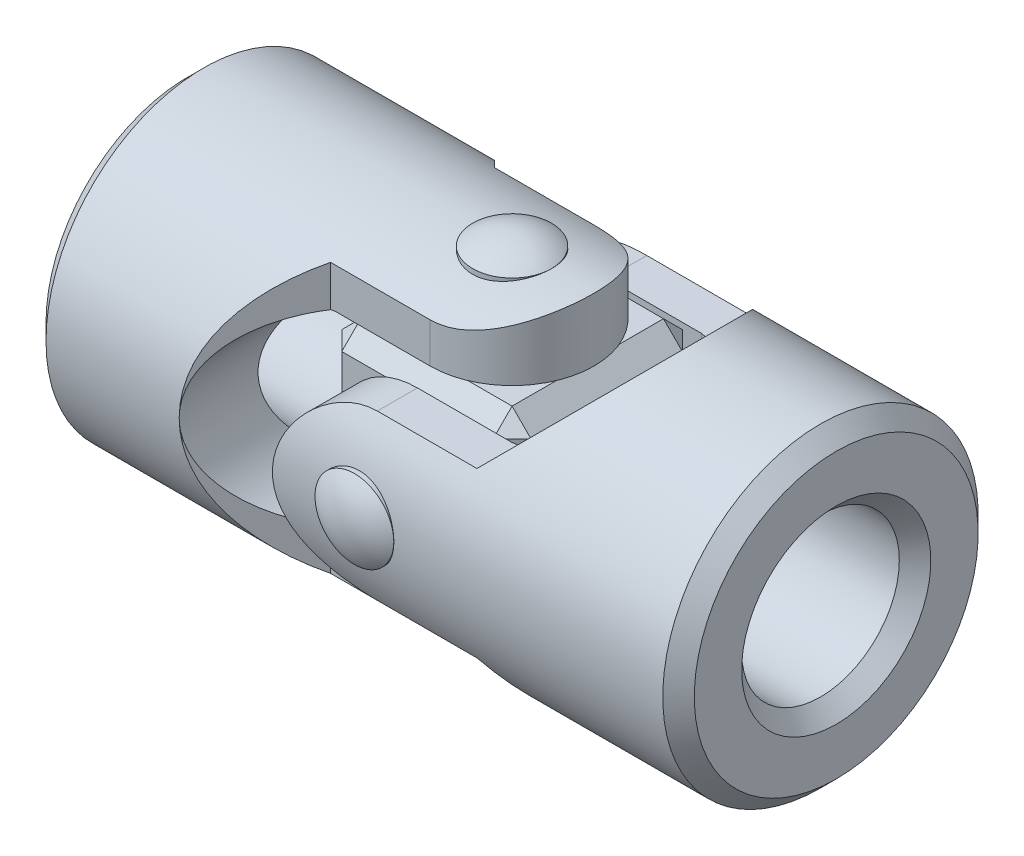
ISO-10303-21;
HEADER;
FILE_DESCRIPTION(('STEP AP214'),'2;1');
FILE_NAME('part.step','',(''),(''),'','','');
FILE_SCHEMA(('AUTOMOTIVE_DESIGN { 1 0 10303 214 1 1 1 1 }'));
ENDSEC;
DATA;
#1=APPLICATION_CONTEXT('core data for automotive mechanical design processes');
#2=APPLICATION_PROTOCOL_DEFINITION('international standard','automotive_design',2000,#1);
#3=PRODUCT_CONTEXT('',#1,'mechanical');
#4=PRODUCT('Part','Part','',(#3));
#5=PRODUCT_RELATED_PRODUCT_CATEGORY('part','',(#4));
#6=PRODUCT_DEFINITION_FORMATION('','',#4);
#7=PRODUCT_DEFINITION_CONTEXT('part definition',#1,'design');
#8=PRODUCT_DEFINITION('design','',#6,#7);
#9=PRODUCT_DEFINITION_SHAPE('','',#8);
#10=(LENGTH_UNIT() NAMED_UNIT(*) SI_UNIT(.MILLI.,.METRE.));
#11=(NAMED_UNIT(*) PLANE_ANGLE_UNIT() SI_UNIT($,.RADIAN.));
#12=(NAMED_UNIT(*) SI_UNIT($,.STERADIAN.) SOLID_ANGLE_UNIT());
#13=UNCERTAINTY_MEASURE_WITH_UNIT(LENGTH_MEASURE(1.E-05),#10,'distance_accuracy_value','');
#14=(GEOMETRIC_REPRESENTATION_CONTEXT(3) GLOBAL_UNCERTAINTY_ASSIGNED_CONTEXT((#13)) GLOBAL_UNIT_ASSIGNED_CONTEXT((#10,
#11,#12)) REPRESENTATION_CONTEXT('',''));
#15=CARTESIAN_POINT('',(0.,0.,0.));
#16=DIRECTION('',(0.,0.,1.));
#17=DIRECTION('',(1.,0.,0.));
#18=AXIS2_PLACEMENT_3D('',#15,#16,#17);
#19=CARTESIAN_POINT('',(0.,18.,0.));
#20=DIRECTION('',(0.,-1.,0.));
#21=DIRECTION('',(-1.,0.,0.));
#22=AXIS2_PLACEMENT_3D('',#19,#20,#21);
#23=CYLINDRICAL_SURFACE('',#22,4.5);
#24=CARTESIAN_POINT('',(0.,18.,0.));
#25=DIRECTION('',(0.,1.,0.));
#26=DIRECTION('',(1.,0.,0.));
#27=AXIS2_PLACEMENT_3D('',#24,#25,#26);
#28=CIRCLE('',#27,4.5);
#29=CARTESIAN_POINT('',(4.5,18.,0.));
#30=VERTEX_POINT('',#29);
#31=EDGE_CURVE('P0_E10',#30,#30,#28,.T.);
#32=ORIENTED_EDGE('',*,*,#31,.F.);
#33=EDGE_LOOP('',(#32));
#34=FACE_BOUND('',#33,.T.);
#35=CARTESIAN_POINT('',(0.,-18.,0.));
#36=DIRECTION('',(0.,-1.,0.));
#37=DIRECTION('',(0.,0.,-1.));
#38=AXIS2_PLACEMENT_3D('',#35,#36,#37);
#39=CIRCLE('',#38,4.5);
#40=CARTESIAN_POINT('',(0.,-18.,-4.5));
#41=VERTEX_POINT('',#40);
#42=EDGE_CURVE('P0_E20',#41,#41,#39,.T.);
#43=ORIENTED_EDGE('',*,*,#42,.F.);
#44=EDGE_LOOP('',(#43));
#45=FACE_BOUND('',#44,.T.);
#46=ADVANCED_FACE('P0_F14',(#34,#45),#23,.T.);
#47=CARTESIAN_POINT('',(0.,11.68875,0.));
#48=DIRECTION('',(0.,-1.,0.));
#49=DIRECTION('',(0.,0.,-1.));
#50=AXIS2_PLACEMENT_3D('',#47,#48,#49);
#51=SPHERICAL_SURFACE('',#50,7.75124999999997);
#52=ORIENTED_EDGE('',*,*,#31,.T.);
#53=EDGE_LOOP('',(#52));
#54=FACE_BOUND('',#53,.T.);
#55=ADVANCED_FACE('P0_F29',(#54),#51,.T.);
#56=CARTESIAN_POINT('',(0.,-11.68875,0.));
#57=DIRECTION('',(0.,1.,0.));
#58=DIRECTION('',(0.,0.,-1.));
#59=AXIS2_PLACEMENT_3D('',#56,#57,#58);
#60=SPHERICAL_SURFACE('',#59,7.75124999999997);
#61=ORIENTED_EDGE('',*,*,#42,.T.);
#62=EDGE_LOOP('',(#61));
#63=FACE_BOUND('',#62,.T.);
#64=ADVANCED_FACE('P0_F26',(#63),#60,.T.);
#65=CLOSED_SHELL('',(#46,#55,#64));
#66=MANIFOLD_SOLID_BREP('P0_B1',#65);
#67=CARTESIAN_POINT('',(0.,0.,18.));
#68=DIRECTION('',(0.,0.,-1.));
#69=DIRECTION('',(-1.,0.,0.));
#70=AXIS2_PLACEMENT_3D('',#67,#68,#69);
#71=CYLINDRICAL_SURFACE('',#70,4.5);
#72=CARTESIAN_POINT('',(0.,0.,18.));
#73=DIRECTION('',(0.,0.,1.));
#74=DIRECTION('',(1.,0.,0.));
#75=AXIS2_PLACEMENT_3D('',#72,#73,#74);
#76=CIRCLE('',#75,4.5);
#77=CARTESIAN_POINT('',(4.5,0.,18.));
#78=VERTEX_POINT('',#77);
#79=EDGE_CURVE('P1_E10',#78,#78,#76,.T.);
#80=ORIENTED_EDGE('',*,*,#79,.F.);
#81=EDGE_LOOP('',(#80));
#82=FACE_BOUND('',#81,.T.);
#83=CARTESIAN_POINT('',(0.,0.,-18.));
#84=DIRECTION('',(0.,0.,-1.));
#85=DIRECTION('',(0.,1.,0.));
#86=AXIS2_PLACEMENT_3D('',#83,#84,#85);
#87=CIRCLE('',#86,4.5);
#88=CARTESIAN_POINT('',(0.,4.5,-18.));
#89=VERTEX_POINT('',#88);
#90=EDGE_CURVE('P1_E20',#89,#89,#87,.T.);
#91=ORIENTED_EDGE('',*,*,#90,.F.);
#92=EDGE_LOOP('',(#91));
#93=FACE_BOUND('',#92,.T.);
#94=ADVANCED_FACE('P1_F14',(#82,#93),#71,.T.);
#95=CARTESIAN_POINT('',(0.,0.,11.68875));
#96=DIRECTION('',(0.,0.,-1.));
#97=DIRECTION('',(0.,1.,0.));
#98=AXIS2_PLACEMENT_3D('',#95,#96,#97);
#99=SPHERICAL_SURFACE('',#98,7.75124999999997);
#100=ORIENTED_EDGE('',*,*,#79,.T.);
#101=EDGE_LOOP('',(#100));
#102=FACE_BOUND('',#101,.T.);
#103=ADVANCED_FACE('P1_F29',(#102),#99,.T.);
#104=CARTESIAN_POINT('',(0.,0.,-11.68875));
#105=DIRECTION('',(0.,0.,1.));
#106=DIRECTION('',(0.,1.,0.));
#107=AXIS2_PLACEMENT_3D('',#104,#105,#106);
#108=SPHERICAL_SURFACE('',#107,7.75124999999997);
#109=ORIENTED_EDGE('',*,*,#90,.T.);
#110=EDGE_LOOP('',(#109));
#111=FACE_BOUND('',#110,.T.);
#112=ADVANCED_FACE('P1_F26',(#111),#108,.T.);
#113=CLOSED_SHELL('',(#94,#103,#112));
#114=MANIFOLD_SOLID_BREP('P1_B1',#113);
#115=CARTESIAN_POINT('',(0.,-18.,-9.36));
#116=DIRECTION('',(0.,0.,1.));
#117=DIRECTION('',(1.,0.,0.));
#118=AXIS2_PLACEMENT_3D('',#115,#116,#117);
#119=PLANE('',#118);
#120=DIRECTION('',(0.,1.,0.));
#121=VECTOR('',#120,1.);
#122=CARTESIAN_POINT('',(0.,-18.,-9.36));
#123=LINE('',#122,#121);
#124=CARTESIAN_POINT('',(0.,10.8,-9.36));
#125=VERTEX_POINT('',#124);
#126=CARTESIAN_POINT('',(0.,15.3749926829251,-9.36));
#127=VERTEX_POINT('',#126);
#128=EDGE_CURVE('P2_E282',#125,#127,#123,.T.);
#129=ORIENTED_EDGE('',*,*,#128,.F.);
#130=DIRECTION('',(-1.,0.,0.));
#131=VECTOR('',#130,1.);
#132=CARTESIAN_POINT('',(0.,10.8,-9.36));
#133=LINE('',#132,#131);
#134=CARTESIAN_POINT('',(-10.8,10.8,-9.36));
#135=VERTEX_POINT('',#134);
#136=EDGE_CURVE('P2_E132',#125,#135,#133,.T.);
#137=ORIENTED_EDGE('',*,*,#136,.T.);
#138=CARTESIAN_POINT('',(-9.06086956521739,0.,-9.36));
#139=DIRECTION('',(0.,0.,1.));
#140=DIRECTION('',(1.,0.,0.));
#141=AXIS2_PLACEMENT_3D('',#138,#139,#140);
#142=CIRCLE('',#141,10.9391304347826);
#143=CARTESIAN_POINT('',(-11.36,10.6947919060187,-9.36));
#144=VERTEX_POINT('',#143);
#145=EDGE_CURVE('P2_E146',#135,#144,#142,.T.);
#146=ORIENTED_EDGE('',*,*,#145,.T.);
#147=DIRECTION('',(0.,1.,0.));
#148=VECTOR('',#147,1.);
#149=CARTESIAN_POINT('',(-11.36,-18.,-9.36));
#150=LINE('',#149,#148);
#151=CARTESIAN_POINT('',(-11.36,15.3749926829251,-9.36));
#152=VERTEX_POINT('',#151);
#153=EDGE_CURVE('P2_E289',#144,#152,#150,.T.);
#154=ORIENTED_EDGE('',*,*,#153,.T.);
#155=DIRECTION('',(1.,0.,0.));
#156=VECTOR('',#155,1.);
#157=CARTESIAN_POINT('',(-37.,15.3749926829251,-9.35999999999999));
#158=LINE('',#157,#156);
#159=EDGE_CURVE('P2_E227',#127,#152,#158,.F.);
#160=ORIENTED_EDGE('',*,*,#159,.F.);
#161=EDGE_LOOP('',(#129,#137,#146,#154,#160));
#162=FACE_BOUND('',#161,.T.);
#163=ADVANCED_FACE('P2_F16',(#162),#119,.F.);
#164=CARTESIAN_POINT('',(-11.36,-18.,-9.36));
#165=DIRECTION('',(-0.707106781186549,0.,0.707106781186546));
#166=DIRECTION('',(0.707106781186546,0.,0.707106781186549));
#167=AXIS2_PLACEMENT_3D('',#164,#165,#166);
#168=PLANE('',#167);
#169=CARTESIAN_POINT('',(-2.00000000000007,0.,0.));
#170=DIRECTION('',(-0.707106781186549,0.,0.707106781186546));
#171=DIRECTION('',(0.707106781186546,0.,0.707106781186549));
#172=AXIS2_PLACEMENT_3D('',#169,#170,#171);
#173=ELLIPSE('',#172,25.4558441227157,18.);
#174=CARTESIAN_POINT('',(-20.,0.,-18.));
#175=VERTEX_POINT('',#174);
#176=CARTESIAN_POINT('',(-11.36,-15.3749926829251,-9.36));
#177=VERTEX_POINT('',#176);
#178=EDGE_CURVE('P2_E230',#175,#177,#173,.T.);
#179=ORIENTED_EDGE('',*,*,#178,.F.);
#180=CARTESIAN_POINT('',(-9.06086956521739,0.,-7.06086956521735));
#181=DIRECTION('',(-0.707106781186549,0.,0.707106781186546));
#182=DIRECTION('',(-0.707106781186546,0.,-0.707106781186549));
#183=AXIS2_PLACEMENT_3D('',#180,#181,#182);
#184=ELLIPSE('',#183,15.4702666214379,10.9391304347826);
#185=CARTESIAN_POINT('',(-11.36,-10.6947919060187,-9.36));
#186=VERTEX_POINT('',#185);
#187=EDGE_CURVE('P2_E143',#175,#186,#184,.T.);
#188=ORIENTED_EDGE('',*,*,#187,.T.);
#189=EDGE_CURVE('P2_E286',#177,#186,#150,.T.);
#190=ORIENTED_EDGE('',*,*,#189,.F.);
#191=EDGE_LOOP('',(#179,#188,#190));
#192=FACE_BOUND('',#191,.T.);
#193=ADVANCED_FACE('P2_F181',(#192),#168,.F.);
#194=CARTESIAN_POINT('',(-11.36,-18.,9.36));
#195=DIRECTION('',(-0.707106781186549,0.,-0.707106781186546));
#196=DIRECTION('',(-0.707106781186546,0.,0.707106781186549));
#197=AXIS2_PLACEMENT_3D('',#194,#195,#196);
#198=PLANE('',#197);
#199=DIRECTION('',(0.,1.,0.));
#200=VECTOR('',#199,1.);
#201=CARTESIAN_POINT('',(-11.36,-18.,9.36));
#202=LINE('',#201,#200);
#203=CARTESIAN_POINT('',(-11.36,-15.3749926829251,9.36));
#204=VERTEX_POINT('',#203);
#205=CARTESIAN_POINT('',(-11.36,-10.6947919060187,9.36));
#206=VERTEX_POINT('',#205);
#207=EDGE_CURVE('P2_E39',#204,#206,#202,.T.);
#208=ORIENTED_EDGE('',*,*,#207,.T.);
#209=CARTESIAN_POINT('',(-9.06086956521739,0.,7.06086956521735));
#210=DIRECTION('',(-0.707106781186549,0.,-0.707106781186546));
#211=DIRECTION('',(0.707106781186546,0.,-0.707106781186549));
#212=AXIS2_PLACEMENT_3D('',#209,#210,#211);
#213=ELLIPSE('',#212,15.4702666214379,10.9391304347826);
#214=CARTESIAN_POINT('',(-20.,0.,18.));
#215=VERTEX_POINT('',#214);
#216=EDGE_CURVE('P2_E107',#206,#215,#213,.T.);
#217=ORIENTED_EDGE('',*,*,#216,.T.);
#218=CARTESIAN_POINT('',(-2.00000000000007,0.,0.));
#219=DIRECTION('',(-0.707106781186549,0.,-0.707106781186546));
#220=DIRECTION('',(0.707106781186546,0.,-0.707106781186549));
#221=AXIS2_PLACEMENT_3D('',#218,#219,#220);
#222=ELLIPSE('',#221,25.4558441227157,18.);
#223=EDGE_CURVE('P2_E241',#204,#215,#222,.T.);
#224=ORIENTED_EDGE('',*,*,#223,.F.);
#225=EDGE_LOOP('',(#208,#217,#224));
#226=FACE_BOUND('',#225,.T.);
#227=ADVANCED_FACE('P2_F185',(#226),#198,.F.);
#228=CARTESIAN_POINT('',(0.,-18.,9.36));
#229=DIRECTION('',(0.,0.,-1.));
#230=DIRECTION('',(-1.,0.,0.));
#231=AXIS2_PLACEMENT_3D('',#228,#229,#230);
#232=PLANE('',#231);
#233=CARTESIAN_POINT('',(-9.06086956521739,0.,9.36));
#234=DIRECTION('',(0.,0.,-1.));
#235=DIRECTION('',(-1.,0.,0.));
#236=AXIS2_PLACEMENT_3D('',#233,#234,#235);
#237=CIRCLE('',#236,10.9391304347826);
#238=CARTESIAN_POINT('',(-11.36,10.6947919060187,9.36));
#239=VERTEX_POINT('',#238);
#240=CARTESIAN_POINT('',(-10.8,10.8,9.36));
#241=VERTEX_POINT('',#240);
#242=EDGE_CURVE('P2_E108',#239,#241,#237,.T.);
#243=ORIENTED_EDGE('',*,*,#242,.T.);
#244=DIRECTION('',(1.,0.,0.));
#245=VECTOR('',#244,1.);
#246=CARTESIAN_POINT('',(0.,10.8,9.36));
#247=LINE('',#246,#245);
#248=CARTESIAN_POINT('',(0.,10.8,9.36));
#249=VERTEX_POINT('',#248);
#250=EDGE_CURVE('P2_E129',#241,#249,#247,.T.);
#251=ORIENTED_EDGE('',*,*,#250,.T.);
#252=DIRECTION('',(0.,1.,0.));
#253=VECTOR('',#252,1.);
#254=CARTESIAN_POINT('',(0.,-18.,9.36));
#255=LINE('',#254,#253);
#256=CARTESIAN_POINT('',(0.,15.3749926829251,9.36));
#257=VERTEX_POINT('',#256);
#258=EDGE_CURVE('P2_E154',#249,#257,#255,.T.);
#259=ORIENTED_EDGE('',*,*,#258,.T.);
#260=DIRECTION('',(1.,0.,0.));
#261=VECTOR('',#260,1.);
#262=CARTESIAN_POINT('',(-37.,15.3749926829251,9.36));
#263=LINE('',#262,#261);
#264=CARTESIAN_POINT('',(-11.36,15.3749926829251,9.36));
#265=VERTEX_POINT('',#264);
#266=EDGE_CURVE('P2_E244',#265,#257,#263,.T.);
#267=ORIENTED_EDGE('',*,*,#266,.F.);
#268=EDGE_CURVE('P2_E292',#239,#265,#202,.T.);
#269=ORIENTED_EDGE('',*,*,#268,.F.);
#270=EDGE_LOOP('',(#243,#251,#259,#267,#269));
#271=FACE_BOUND('',#270,.T.);
#272=ADVANCED_FACE('P2_F188',(#271),#232,.F.);
#273=CARTESIAN_POINT('',(0.,-18.,0.));
#274=DIRECTION('',(0.,1.,0.));
#275=DIRECTION('',(0.,0.,-1.));
#276=AXIS2_PLACEMENT_3D('',#273,#274,#275);
#277=CYLINDRICAL_SURFACE('',#276,9.36);
#278=ORIENTED_EDGE('',*,*,#258,.F.);
#279=CARTESIAN_POINT('',(0.,10.8,0.));
#280=DIRECTION('',(0.,1.,0.));
#281=DIRECTION('',(1.,0.,0.));
#282=AXIS2_PLACEMENT_3D('',#279,#280,#281);
#283=CIRCLE('',#282,9.36);
#284=EDGE_CURVE('P2_E109',#249,#125,#283,.T.);
#285=ORIENTED_EDGE('',*,*,#284,.T.);
#286=ORIENTED_EDGE('',*,*,#128,.T.);
#287=CARTESIAN_POINT('',(0.,15.3749926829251,9.36));
#288=CARTESIAN_POINT('',(0.121796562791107,15.374989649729,9.36000100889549));
#289=CARTESIAN_POINT('',(0.243575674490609,15.3764405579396,9.35762216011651));
#290=CARTESIAN_POINT('',(0.486874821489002,15.3822193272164,9.34812139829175));
#291=CARTESIAN_POINT('',(0.60839486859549,15.386547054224,9.34099970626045));
#292=CARTESIAN_POINT('',(0.972026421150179,15.403788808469,9.31256227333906));
#293=CARTESIAN_POINT('',(1.21343185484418,15.4209615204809,9.28417410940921));
#294=CARTESIAN_POINT('',(1.69081000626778,15.4658677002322,9.20917012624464));
#295=CARTESIAN_POINT('',(1.92680699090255,15.4935356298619,9.16266737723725));
#296=CARTESIAN_POINT('',(2.39330676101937,15.5584366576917,9.0520249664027));
#297=CARTESIAN_POINT('',(2.62380883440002,15.5956709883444,8.98788303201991));
#298=CARTESIAN_POINT('',(3.07727149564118,15.6783424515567,8.84287924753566));
#299=CARTESIAN_POINT('',(3.30025048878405,15.7237575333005,8.76206226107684));
#300=CARTESIAN_POINT('',(3.73819614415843,15.821469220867,8.5843687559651));
#301=CARTESIAN_POINT('',(3.9531596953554,15.8737684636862,8.48748607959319));
#302=CARTESIAN_POINT('',(4.58499016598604,16.0389299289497,8.17365773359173));
#303=CARTESIAN_POINT('',(4.98847524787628,16.1599937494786,7.93363576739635));
#304=CARTESIAN_POINT('',(5.78712299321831,16.4233458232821,7.37409484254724));
#305=CARTESIAN_POINT('',(6.17835649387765,16.566564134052,7.04940532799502));
#306=CARTESIAN_POINT('',(6.72217187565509,16.779459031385,6.51815593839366));
#307=CARTESIAN_POINT('',(6.89634694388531,16.8501365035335,6.33360102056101));
#308=CARTESIAN_POINT('',(7.22958425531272,16.989241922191,5.95039131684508));
#309=CARTESIAN_POINT('',(7.38864423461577,17.0576695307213,5.75173442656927));
#310=CARTESIAN_POINT('',(7.7019191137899,17.1956018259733,5.32588548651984));
#311=CARTESIAN_POINT('',(7.85487930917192,17.2648034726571,5.09767059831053));
#312=CARTESIAN_POINT('',(8.14079654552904,17.3967493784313,4.62738744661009));
#313=CARTESIAN_POINT('',(8.27376216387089,17.4594964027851,4.38532518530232));
#314=CARTESIAN_POINT('',(8.5184049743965,17.5767487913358,3.88882267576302));
#315=CARTESIAN_POINT('',(8.63008779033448,17.6312563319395,3.63438571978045));
#316=CARTESIAN_POINT('',(8.83088330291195,17.7304052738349,3.11490227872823));
#317=CARTESIAN_POINT('',(8.91999862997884,17.7750478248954,2.8498570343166));
#318=CARTESIAN_POINT('',(9.06859870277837,17.8501006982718,2.33176597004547));
#319=CARTESIAN_POINT('',(9.12981933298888,17.8813342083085,2.07933679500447));
#320=CARTESIAN_POINT('',(9.2311854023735,17.9333009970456,1.56921156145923));
#321=CARTESIAN_POINT('',(9.27133181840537,17.9540347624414,1.31151574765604));
#322=CARTESIAN_POINT('',(9.32997813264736,17.9843894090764,0.79316193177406));
#323=CARTESIAN_POINT('',(9.34848975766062,17.9940163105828,0.532505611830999));
#324=CARTESIAN_POINT('',(9.36363627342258,18.0018898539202,0.0103934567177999));
#325=CARTESIAN_POINT('',(9.36027264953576,18.0001372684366,-0.251062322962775));
#326=CARTESIAN_POINT('',(9.33306945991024,17.9860077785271,-0.747916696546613));
#327=CARTESIAN_POINT('',(9.31118445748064,17.9746450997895,-0.983454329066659));
#328=CARTESIAN_POINT('',(9.24976873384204,17.9429074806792,-1.45158501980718));
#329=CARTESIAN_POINT('',(9.21023935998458,17.9225332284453,-1.68417830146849));
#330=CARTESIAN_POINT('',(9.11397796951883,17.8732561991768,-2.14485020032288));
#331=CARTESIAN_POINT('',(9.05724569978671,17.8443532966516,-2.37292875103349));
#332=CARTESIAN_POINT('',(8.92717333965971,17.7786859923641,-2.82313435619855));
#333=CARTESIAN_POINT('',(8.85383263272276,17.7419212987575,-3.0452611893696));
#334=CARTESIAN_POINT('',(8.69021437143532,17.6608354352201,-3.48503919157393));
#335=CARTESIAN_POINT('',(8.5997355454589,17.6164251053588,-3.70259902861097));
#336=CARTESIAN_POINT('',(8.40324259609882,17.5213446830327,-4.1292037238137));
#337=CARTESIAN_POINT('',(8.29722298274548,17.4706723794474,-4.33824553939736));
#338=CARTESIAN_POINT('',(7.95709538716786,17.3108492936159,-4.95098915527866));
#339=CARTESIAN_POINT('',(7.70082008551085,17.193842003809,-5.34057154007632));
#340=CARTESIAN_POINT('',(7.107269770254,16.9359174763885,-6.11198456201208));
#341=CARTESIAN_POINT('',(6.76445964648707,16.7937793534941,-6.48915026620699));
#342=CARTESIAN_POINT('',(6.20822649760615,16.5802048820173,-7.00943617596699));
#343=CARTESIAN_POINT('',(6.01562914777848,16.5088908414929,-7.17541051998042));
#344=CARTESIAN_POINT('',(5.61712034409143,16.3678860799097,-7.49147528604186));
#345=CARTESIAN_POINT('',(5.41120674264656,16.2981956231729,-7.64156313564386));
#346=CARTESIAN_POINT('',(4.97134841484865,16.1572944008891,-7.93538473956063));
#347=CARTESIAN_POINT('',(4.73645656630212,16.0863512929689,-8.07783116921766));
#348=CARTESIAN_POINT('',(4.25371510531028,15.9508893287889,-8.34213269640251));
#349=CARTESIAN_POINT('',(4.0058715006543,15.8863675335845,-8.46399723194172));
#350=CARTESIAN_POINT('',(3.49906832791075,15.7662109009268,-8.68576307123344));
#351=CARTESIAN_POINT('',(3.24013179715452,15.7105586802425,-8.78570748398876));
#352=CARTESIAN_POINT('',(2.71251269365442,15.610290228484,-8.96265648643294));
#353=CARTESIAN_POINT('',(2.44383433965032,15.5656692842,-9.0396708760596));
#354=CARTESIAN_POINT('',(1.99504515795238,15.5029044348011,-9.14671024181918));
#355=CARTESIAN_POINT('',(1.81709759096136,15.4809717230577,-9.18372958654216));
#356=CARTESIAN_POINT('',(1.45876847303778,15.443014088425,-9.24741529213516));
#357=CARTESIAN_POINT('',(1.27838761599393,15.426987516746,-9.2740845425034));
#358=CARTESIAN_POINT('',(0.915483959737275,15.401159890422,-9.31691671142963));
#359=CARTESIAN_POINT('',(0.732956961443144,15.3913743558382,-9.33305344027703));
#360=CARTESIAN_POINT('',(0.366957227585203,15.3782764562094,-9.35460529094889));
#361=CARTESIAN_POINT('',(0.183484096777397,15.3749670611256,-9.36001549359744));
#362=CARTESIAN_POINT('',(0.,15.3749926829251,-9.36));
#363=B_SPLINE_CURVE_WITH_KNOTS('',3,(#287,#288,#289,#290,#291,#292,#293,#294,#295,#296,#297,
#298,#299,#300,#301,#302,#303,#304,#305,#306,#307,#308,#309,#310,#311,#312,#313,#314,#315,#316,
#317,#318,#319,#320,#321,#322,#323,#324,#325,#326,#327,#328,#329,#330,#331,#332,#333,#334,#335,
#336,#337,#338,#339,#340,#341,#342,#343,#344,#345,#346,#347,#348,#349,#350,#351,#352,#353,#354,
#355,#356,#357,#358,#359,#360,#361,#362),.UNSPECIFIED.,.F.,.F.,(4,2,2,2,2,2,2,2,2,2,2,2,2,2,2,2,
2,2,2,2,2,2,2,2,2,2,2,2,2,2,2,2,2,2,2,2,2,4),(0.,0.365323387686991,0.730629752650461,
1.46057743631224,2.1860400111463,2.91159609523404,3.63522497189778,4.35913184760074,
5.80796540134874,7.38560880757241,8.17521476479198,8.96493880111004,9.81379884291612,
10.6622936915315,11.5105640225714,12.3587354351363,13.1425148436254,13.9262579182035,
14.709575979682,15.4928408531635,16.2024749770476,16.9120549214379,17.6216453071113,
18.3312620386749,19.0497969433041,19.7685862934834,21.2053198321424,22.7856249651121,
23.5771367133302,24.3687764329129,25.2188654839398,26.0685636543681,26.9165754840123,
27.7642243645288,28.3130908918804,28.8618040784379,29.411876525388,29.9622011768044),.UNSPECIFIED.);
#364=EDGE_CURVE('P2_E203',#257,#127,#363,.T.);
#365=ORIENTED_EDGE('',*,*,#364,.F.);
#366=EDGE_LOOP('',(#278,#285,#286,#365));
#367=FACE_BOUND('',#366,.T.);
#368=ADVANCED_FACE('P2_F192',(#367),#277,.T.);
#369=CARTESIAN_POINT('',(-37.,0.,0.));
#370=DIRECTION('',(-1.,0.,0.));
#371=DIRECTION('',(0.,0.,1.));
#372=AXIS2_PLACEMENT_3D('',#369,#370,#371);
#373=PLANE('',#372);
#374=CARTESIAN_POINT('',(-37.,0.,0.));
#375=DIRECTION('',(-1.,0.,0.));
#376=DIRECTION('',(0.,0.,1.));
#377=AXIS2_PLACEMENT_3D('',#374,#375,#376);
#378=CIRCLE('',#377,10.8);
#379=CARTESIAN_POINT('',(-37.,0.,10.8));
#380=VERTEX_POINT('',#379);
#381=EDGE_CURVE('P2_E24',#380,#380,#378,.F.);
#382=ORIENTED_EDGE('',*,*,#381,.T.);
#383=EDGE_LOOP('',(#382));
#384=FACE_BOUND('',#383,.T.);
#385=CARTESIAN_POINT('',(-37.,0.,0.));
#386=DIRECTION('',(-1.,0.,0.));
#387=DIRECTION('',(0.,0.,1.));
#388=AXIS2_PLACEMENT_3D('',#385,#386,#387);
#389=CIRCLE('',#388,16.2);
#390=CARTESIAN_POINT('',(-37.,0.,16.2));
#391=VERTEX_POINT('',#390);
#392=EDGE_CURVE('P2_E254',#391,#391,#389,.T.);
#393=ORIENTED_EDGE('',*,*,#392,.T.);
#394=EDGE_LOOP('',(#393));
#395=FACE_BOUND('',#394,.T.);
#396=ADVANCED_FACE('P2_F213',(#384,#395),#373,.T.);
#397=CARTESIAN_POINT('',(-37.,0.,0.));
#398=DIRECTION('',(1.,0.,0.));
#399=DIRECTION('',(0.,0.,-1.));
#400=AXIS2_PLACEMENT_3D('',#397,#398,#399);
#401=CYLINDRICAL_SURFACE('',#400,18.);
#402=CARTESIAN_POINT('',(-35.2,0.,0.));
#403=DIRECTION('',(-1.,0.,0.));
#404=DIRECTION('',(0.,0.,1.));
#405=AXIS2_PLACEMENT_3D('',#402,#403,#404);
#406=CIRCLE('',#405,18.);
#407=CARTESIAN_POINT('',(-35.2,0.,18.));
#408=VERTEX_POINT('',#407);
#409=EDGE_CURVE('P2_E11',#408,#408,#406,.F.);
#410=ORIENTED_EDGE('',*,*,#409,.T.);
#411=EDGE_LOOP('',(#410));
#412=FACE_BOUND('',#411,.T.);
#413=CARTESIAN_POINT('',(4.5,-18.,0.));
#414=CARTESIAN_POINT('',(4.49999302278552,-17.9999957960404,-0.248628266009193));
#415=CARTESIAN_POINT('',(4.47932534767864,-17.9947973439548,-0.497334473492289));
#416=CARTESIAN_POINT('',(4.39732454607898,-17.9745634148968,-0.987618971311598));
#417=CARTESIAN_POINT('',(4.33596837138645,-17.9595223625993,-1.22919314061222));
#418=CARTESIAN_POINT('',(4.17468223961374,-17.921268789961,-1.69806261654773));
#419=CARTESIAN_POINT('',(4.07479860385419,-17.8980660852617,-1.92537469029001));
#420=CARTESIAN_POINT('',(3.83945582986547,-17.8459603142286,-2.36001639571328));
#421=CARTESIAN_POINT('',(3.7039954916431,-17.8170570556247,-2.56734535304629));
#422=CARTESIAN_POINT('',(3.39839763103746,-17.7560224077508,-2.96040578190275));
#423=CARTESIAN_POINT('',(3.22766527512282,-17.7238412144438,-3.14566707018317));
#424=CARTESIAN_POINT('',(2.8576433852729,-17.6602086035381,-3.48524678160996));
#425=CARTESIAN_POINT('',(2.65835063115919,-17.628757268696,-3.63956171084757));
#426=CARTESIAN_POINT('',(2.23321431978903,-17.5696432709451,-3.91507962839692));
#427=CARTESIAN_POINT('',(2.00702030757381,-17.5420438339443,-4.03575664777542));
#428=CARTESIAN_POINT('',(1.53675476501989,-17.4944848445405,-4.23719072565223));
#429=CARTESIAN_POINT('',(1.29268610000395,-17.4745240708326,-4.31795416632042));
#430=CARTESIAN_POINT('',(0.798769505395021,-17.4450143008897,-4.43566451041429));
#431=CARTESIAN_POINT('',(0.549135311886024,-17.4352647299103,-4.47345680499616));
#432=CARTESIAN_POINT('',(0.0468942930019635,-17.4266808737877,-4.50678532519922));
#433=CARTESIAN_POINT('',(-0.205712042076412,-17.4278448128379,-4.50232842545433));
#434=CARTESIAN_POINT('',(-0.700247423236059,-17.4407761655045,-4.45195957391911));
#435=CARTESIAN_POINT('',(-0.94228686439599,-17.4522858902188,-4.4070550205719));
#436=CARTESIAN_POINT('',(-1.41528315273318,-17.4842012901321,-4.27867256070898));
#437=CARTESIAN_POINT('',(-1.64623920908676,-17.5046075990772,-4.19519190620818));
#438=CARTESIAN_POINT('',(-2.09321404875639,-17.5522534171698,-3.99116843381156));
#439=CARTESIAN_POINT('',(-2.30905851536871,-17.5795598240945,-3.87026000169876));
#440=CARTESIAN_POINT('',(-2.71775612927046,-17.6378913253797,-3.59506882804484));
#441=CARTESIAN_POINT('',(-2.91060524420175,-17.6689170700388,-3.44078024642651));
#442=CARTESIAN_POINT('',(-3.27361084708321,-17.7322764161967,-3.09799027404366));
#443=CARTESIAN_POINT('',(-3.44296347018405,-17.76462208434,-2.90863877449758));
#444=CARTESIAN_POINT('',(-3.74766372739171,-17.8261789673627,-2.5038357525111));
#445=CARTESIAN_POINT('',(-3.8830103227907,-17.8553900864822,-2.28838343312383));
#446=CARTESIAN_POINT('',(-4.11615175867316,-17.9075319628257,-1.83634766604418));
#447=CARTESIAN_POINT('',(-4.21381602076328,-17.9304408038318,-1.59969417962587));
#448=CARTESIAN_POINT('',(-4.36775191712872,-17.9672375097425,-1.11262802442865));
#449=CARTESIAN_POINT('',(-4.42403146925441,-17.9811271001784,-0.862217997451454));
#450=CARTESIAN_POINT('',(-4.49237269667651,-17.9980649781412,-0.361619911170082));
#451=CARTESIAN_POINT('',(-4.50552907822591,-18.0013816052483,-0.111590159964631));
#452=CARTESIAN_POINT('',(-4.49025299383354,-17.9975641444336,0.387098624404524));
#453=CARTESIAN_POINT('',(-4.46182427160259,-17.9904309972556,0.635757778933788));
#454=CARTESIAN_POINT('',(-4.36508727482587,-17.9666874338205,1.12084280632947));
#455=CARTESIAN_POINT('',(-4.29737620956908,-17.9502190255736,1.35739535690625));
#456=CARTESIAN_POINT('',(-4.12467874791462,-17.9096611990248,1.81577187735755));
#457=CARTESIAN_POINT('',(-4.01968858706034,-17.8855710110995,2.03759435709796));
#458=CARTESIAN_POINT('',(-3.77329161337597,-17.8317992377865,2.46456940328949));
#459=CARTESIAN_POINT('',(-3.6312716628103,-17.8020260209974,2.66935632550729));
#460=CARTESIAN_POINT('',(-3.31563027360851,-17.7403352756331,3.05257984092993));
#461=CARTESIAN_POINT('',(-3.1420033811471,-17.7084173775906,3.23101187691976));
#462=CARTESIAN_POINT('',(-2.76299411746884,-17.6450687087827,3.56097170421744));
#463=CARTESIAN_POINT('',(-2.55693689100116,-17.613669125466,3.71173160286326));
#464=CARTESIAN_POINT('',(-2.12180209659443,-17.5557863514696,3.97653227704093));
#465=CARTESIAN_POINT('',(-1.89272555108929,-17.5293029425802,4.09057468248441));
#466=CARTESIAN_POINT('',(-1.41928283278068,-17.4845428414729,4.27785426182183));
#467=CARTESIAN_POINT('',(-1.17501711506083,-17.4662176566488,4.35133318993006));
#468=CARTESIAN_POINT('',(-0.677071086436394,-17.4398023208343,4.45603697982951));
#469=CARTESIAN_POINT('',(-0.423392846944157,-17.4317099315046,4.48727108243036));
#470=CARTESIAN_POINT('',(0.0783630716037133,-17.4268470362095,4.50611577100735));
#471=CARTESIAN_POINT('',(0.326392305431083,-17.4297579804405,4.49495369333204));
#472=CARTESIAN_POINT('',(0.816911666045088,-17.4458372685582,4.43213183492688));
#473=CARTESIAN_POINT('',(1.05940190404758,-17.4590054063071,4.38047286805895));
#474=CARTESIAN_POINT('',(1.53062537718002,-17.4939378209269,4.23879395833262));
#475=CARTESIAN_POINT('',(1.75943191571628,-17.5156504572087,4.14900421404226));
#476=CARTESIAN_POINT('',(2.19889614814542,-17.5652326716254,3.93379474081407));
#477=CARTESIAN_POINT('',(2.40955131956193,-17.5931031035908,3.80837007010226));
#478=CARTESIAN_POINT('',(2.81266388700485,-17.6527690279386,3.52160324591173));
#479=CARTESIAN_POINT('',(3.00450322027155,-17.6846479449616,3.35940948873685));
#480=CARTESIAN_POINT('',(3.35864113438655,-17.7482408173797,3.00536811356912));
#481=CARTESIAN_POINT('',(3.52093269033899,-17.7799547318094,2.81351346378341));
#482=CARTESIAN_POINT('',(3.81423392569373,-17.8403296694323,2.40140276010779));
#483=CARTESIAN_POINT('',(3.94462384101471,-17.8689250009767,2.18069526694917));
#484=CARTESIAN_POINT('',(4.16624238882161,-17.9191477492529,1.71979817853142));
#485=CARTESIAN_POINT('',(4.25749908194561,-17.9407801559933,1.47962269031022));
#486=CARTESIAN_POINT('',(4.38471549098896,-17.9714417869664,1.03323075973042));
#487=CARTESIAN_POINT('',(4.4278537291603,-17.9820775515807,0.829140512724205));
#488=CARTESIAN_POINT('',(4.48549783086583,-17.9963581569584,0.416718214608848));
#489=CARTESIAN_POINT('',(4.5000058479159,-18.0000035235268,0.208386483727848));
#490=CARTESIAN_POINT('',(4.5,-18.,0.));
#491=B_SPLINE_CURVE_WITH_KNOTS('',3,(#413,#414,#415,#416,#417,#418,#419,#420,#421,#422,#423,
#424,#425,#426,#427,#428,#429,#430,#431,#432,#433,#434,#435,#436,#437,#438,#439,#440,#441,#442,
#443,#444,#445,#446,#447,#448,#449,#450,#451,#452,#453,#454,#455,#456,#457,#458,#459,#460,#461,
#462,#463,#464,#465,#466,#467,#468,#469,#470,#471,#472,#473,#474,#475,#476,#477,#478,#479,#480,
#481,#482,#483,#484,#485,#486,#487,#488,#489,#490),.UNSPECIFIED.,.T.,.F.,(4,2,2,2,2,2,2,2,2,2,2,
2,2,2,2,2,2,2,2,2,2,2,2,2,2,2,2,2,2,2,2,2,2,2,2,2,2,2,4),(0.,0.745121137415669,1.4906647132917,
2.23531470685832,2.97998982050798,3.73843306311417,4.49696188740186,5.2667594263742,
6.03643383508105,6.79068885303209,7.54482114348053,8.28067491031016,9.01658110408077,
9.759915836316,10.5033807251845,11.2680450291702,12.032732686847,12.800046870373,
13.5672142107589,14.3147492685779,15.0622170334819,15.7986082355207,16.5350738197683,
17.2846076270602,18.0342708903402,18.8023352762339,19.5703655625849,20.3337676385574,
21.0970026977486,21.8383134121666,22.5796092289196,23.316492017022,24.0534770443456,
24.8096872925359,25.5660770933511,26.3361655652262,27.1057009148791,27.730267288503,
28.3547866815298),.UNSPECIFIED.);
#492=CARTESIAN_POINT('',(4.5,-18.,0.));
#493=VERTEX_POINT('',#492);
#494=EDGE_CURVE('P2_E222',#493,#493,#491,.T.);
#495=ORIENTED_EDGE('',*,*,#494,.T.);
#496=EDGE_LOOP('',(#495));
#497=FACE_BOUND('',#496,.T.);
#498=CARTESIAN_POINT('',(0.,17.4284250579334,-4.5));
#499=CARTESIAN_POINT('',(0.248491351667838,17.4284298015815,-4.49999294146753));
#500=CARTESIAN_POINT('',(0.49706081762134,17.4337975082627,-4.47934724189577));
#501=CARTESIAN_POINT('',(0.987061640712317,17.4546335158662,-4.39744162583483));
#502=CARTESIAN_POINT('',(1.22848875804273,17.4701076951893,-4.33615807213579));
#503=CARTESIAN_POINT('',(1.69704636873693,17.5092970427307,-4.17508415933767));
#504=CARTESIAN_POINT('',(1.92419487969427,17.5330015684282,-4.07534351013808));
#505=CARTESIAN_POINT('',(2.35855953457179,17.5859674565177,-3.84033805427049));
#506=CARTESIAN_POINT('',(2.56577483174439,17.6152290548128,-3.70507173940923));
#507=CARTESIAN_POINT('',(2.95895096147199,17.6767328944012,-3.39967516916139));
#508=CARTESIAN_POINT('',(3.14440848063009,17.7090227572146,-3.22890639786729));
#509=CARTESIAN_POINT('',(3.48437050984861,17.7725317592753,-2.85872771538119));
#510=CARTESIAN_POINT('',(3.63887212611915,17.803750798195,-2.65931512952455));
#511=CARTESIAN_POINT('',(3.9145958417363,17.8621274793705,-2.23406136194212));
#512=CARTESIAN_POINT('',(4.03532349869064,17.8892223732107,-2.00789023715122));
#513=CARTESIAN_POINT('',(4.23685735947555,17.9357546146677,-1.53767373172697));
#514=CARTESIAN_POINT('',(4.31766945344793,17.9551930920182,-1.29363099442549));
#515=CARTESIAN_POINT('',(4.43546610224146,17.9838856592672,-0.799845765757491));
#516=CARTESIAN_POINT('',(4.47330535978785,17.9933380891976,-0.550318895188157));
#517=CARTESIAN_POINT('',(4.50676508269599,18.0016846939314,-0.0482918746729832));
#518=CARTESIAN_POINT('',(4.50239178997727,18.0005804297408,0.204207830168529));
#519=CARTESIAN_POINT('',(4.45216526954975,17.9880857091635,0.699085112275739));
#520=CARTESIAN_POINT('',(4.40723461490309,17.9769240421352,0.941562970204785));
#521=CARTESIAN_POINT('',(4.27865171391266,17.9458350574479,1.41542211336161));
#522=CARTESIAN_POINT('',(4.19499740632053,17.9259072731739,1.64680280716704));
#523=CARTESIAN_POINT('',(3.99059537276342,17.8791751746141,2.09433016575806));
#524=CARTESIAN_POINT('',(3.86951931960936,17.8523103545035,2.31032029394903));
#525=CARTESIAN_POINT('',(3.59395977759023,17.7946182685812,2.71924030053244));
#526=CARTESIAN_POINT('',(3.43947047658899,17.7637903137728,2.91216615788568));
#527=CARTESIAN_POINT('',(3.09652426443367,17.7005468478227,3.27498315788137));
#528=CARTESIAN_POINT('',(2.90726119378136,17.6681109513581,3.44410955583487));
#529=CARTESIAN_POINT('',(2.50272004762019,17.6060707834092,3.74839369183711));
#530=CARTESIAN_POINT('',(2.28744075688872,17.5764666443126,3.88354984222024));
#531=CARTESIAN_POINT('',(1.83547793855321,17.5233689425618,4.11654658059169));
#532=CARTESIAN_POINT('',(1.59869568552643,17.4999057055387,4.21420305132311));
#533=CARTESIAN_POINT('',(1.11134615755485,17.4621355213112,4.36808529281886));
#534=CARTESIAN_POINT('',(0.860781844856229,17.4478266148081,4.42431992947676));
#535=CARTESIAN_POINT('',(0.36007289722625,17.4303964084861,4.49249334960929));
#536=CARTESIAN_POINT('',(0.110091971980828,17.426989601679,4.50556285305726));
#537=CARTESIAN_POINT('',(-0.388479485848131,17.4309721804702,4.49013058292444));
#538=CARTESIAN_POINT('',(-0.637070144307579,17.4383605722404,4.46163263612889));
#539=CARTESIAN_POINT('',(-1.12160567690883,17.4628274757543,4.3648658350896));
#540=CARTESIAN_POINT('',(-1.35769090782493,17.4797454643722,4.29725532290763));
#541=CARTESIAN_POINT('',(-1.81517662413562,17.5212129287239,4.12491254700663));
#542=CARTESIAN_POINT('',(-2.03657536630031,17.5457633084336,4.02017588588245));
#543=CARTESIAN_POINT('',(-2.46319430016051,17.600330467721,3.77418720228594));
#544=CARTESIAN_POINT('',(-2.66801191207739,17.6304450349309,3.63225915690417));
#545=CARTESIAN_POINT('',(-3.05133905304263,17.6925074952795,3.31677131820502));
#546=CARTESIAN_POINT('',(-3.22984424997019,17.7244556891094,3.14320632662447));
#547=CARTESIAN_POINT('',(-3.56005987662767,17.7875532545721,2.76418224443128));
#548=CARTESIAN_POINT('',(-3.71098811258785,17.8186626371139,2.55803378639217));
#549=CARTESIAN_POINT('',(-3.97608456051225,17.8757498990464,2.12266207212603));
#550=CARTESIAN_POINT('',(-4.09025468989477,17.9017280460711,1.89344002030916));
#551=CARTESIAN_POINT('',(-4.27760286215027,17.9454620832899,1.42001190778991));
#552=CARTESIAN_POINT('',(-4.35107571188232,17.9632769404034,1.17592821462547));
#553=CARTESIAN_POINT('',(-4.45582860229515,17.9889352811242,0.678373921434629));
#554=CARTESIAN_POINT('',(-4.48711678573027,17.9967806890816,0.424905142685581));
#555=CARTESIAN_POINT('',(-4.50615415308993,18.0015376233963,-0.0768758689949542));
#556=CARTESIAN_POINT('',(-4.49505769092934,17.9987390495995,-0.325142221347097));
#557=CARTESIAN_POINT('',(-4.43228477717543,17.9831653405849,-0.816153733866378));
#558=CARTESIAN_POINT('',(-4.38060953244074,17.9703905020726,-1.05889905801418));
#559=CARTESIAN_POINT('',(-4.23876501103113,17.936344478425,-1.53076966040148));
#560=CARTESIAN_POINT('',(-4.14880446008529,17.9151194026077,-1.75996122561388));
#561=CARTESIAN_POINT('',(-3.93313239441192,17.8664080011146,-2.20012673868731));
#562=CARTESIAN_POINT('',(-3.80741637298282,17.8389208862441,-2.41109838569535));
#563=CARTESIAN_POINT('',(-3.5202814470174,17.7798262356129,-2.81430867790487));
#564=CARTESIAN_POINT('',(-3.35807935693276,17.7481357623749,-3.00597744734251));
#565=CARTESIAN_POINT('',(-3.00409716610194,17.6845792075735,-3.35976759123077));
#566=CARTESIAN_POINT('',(-2.81230957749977,17.6527130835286,-3.52188146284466));
#567=CARTESIAN_POINT('',(-2.40029363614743,17.5917364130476,-3.81492911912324));
#568=CARTESIAN_POINT('',(-2.17960144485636,17.562688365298,-3.9452247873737));
#569=CARTESIAN_POINT('',(-1.71875029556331,17.5114779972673,-4.16667103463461));
#570=CARTESIAN_POINT('',(-1.47860565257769,17.4893106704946,-4.25785009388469));
#571=CARTESIAN_POINT('',(-1.03240344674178,17.4578358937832,-4.38490137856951));
#572=CARTESIAN_POINT('',(-0.828480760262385,17.4468898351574,-4.42796926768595));
#573=CARTESIAN_POINT('',(-0.416390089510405,17.4321827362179,-4.48552031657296));
#574=CARTESIAN_POINT('',(-0.20822246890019,17.4284210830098,-4.50000591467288));
#575=CARTESIAN_POINT('',(0.,17.4284250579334,-4.5));
#576=B_SPLINE_CURVE_WITH_KNOTS('',3,(#498,#499,#500,#501,#502,#503,#504,#505,#506,#507,#508,
#509,#510,#511,#512,#513,#514,#515,#516,#517,#518,#519,#520,#521,#522,#523,#524,#525,#526,#527,
#528,#529,#530,#531,#532,#533,#534,#535,#536,#537,#538,#539,#540,#541,#542,#543,#544,#545,#546,
#547,#548,#549,#550,#551,#552,#553,#554,#555,#556,#557,#558,#559,#560,#561,#562,#563,#564,#565,
#566,#567,#568,#569,#570,#571,#572,#573,#574,#575),.UNSPECIFIED.,.T.,.F.,(4,2,2,2,2,2,2,2,2,2,2,
2,2,2,2,2,2,2,2,2,2,2,2,2,2,2,2,2,2,2,2,2,2,2,2,2,2,2,4),(0.,0.744709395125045,1.4898523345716,
2.23403530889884,2.97824988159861,3.73723117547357,4.4962833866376,5.26592693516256,
6.03545687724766,6.78939751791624,7.54322667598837,8.28032872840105,9.01747002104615,
9.76127173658,10.5052029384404,11.2692683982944,12.0333695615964,12.8011757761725,
13.5688176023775,14.3161843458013,15.0634822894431,15.7985532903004,16.5337113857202,
17.2832912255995,18.0329943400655,18.8014559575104,19.5698774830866,20.3326573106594,
21.0952898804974,21.8373020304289,22.5792921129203,23.3172877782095,24.05537650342,
24.8111477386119,25.5671105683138,26.3371765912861,27.1066809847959,27.7307608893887,
28.3547875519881),.UNSPECIFIED.);
#577=CARTESIAN_POINT('',(0.,17.4284250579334,-4.5));
#578=VERTEX_POINT('',#577);
#579=EDGE_CURVE('P2_E217',#578,#578,#576,.T.);
#580=ORIENTED_EDGE('',*,*,#579,.T.);
#581=EDGE_LOOP('',(#580));
#582=FACE_BOUND('',#581,.T.);
#583=ORIENTED_EDGE('',*,*,#266,.T.);
#584=ORIENTED_EDGE('',*,*,#364,.T.);
#585=ORIENTED_EDGE('',*,*,#159,.T.);
#586=EDGE_CURVE('P2_E231',#152,#175,#173,.T.);
#587=ORIENTED_EDGE('',*,*,#586,.T.);
#588=ORIENTED_EDGE('',*,*,#178,.T.);
#589=DIRECTION('',(1.,0.,0.));
#590=VECTOR('',#589,1.);
#591=CARTESIAN_POINT('',(-37.,-15.3749926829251,-9.35999999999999));
#592=LINE('',#591,#590);
#593=CARTESIAN_POINT('',(0.,-15.3749926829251,-9.36));
#594=VERTEX_POINT('',#593);
#595=EDGE_CURVE('P2_E234',#177,#594,#592,.T.);
#596=ORIENTED_EDGE('',*,*,#595,.T.);
#597=CARTESIAN_POINT('',(0.,-15.3749926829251,-9.36));
#598=CARTESIAN_POINT('',(0.121796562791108,-15.374989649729,-9.36000100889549));
#599=CARTESIAN_POINT('',(0.243575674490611,-15.3764405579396,-9.35762216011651));
#600=CARTESIAN_POINT('',(0.486874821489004,-15.3822193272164,-9.34812139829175));
#601=CARTESIAN_POINT('',(0.608394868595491,-15.386547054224,-9.34099970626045));
#602=CARTESIAN_POINT('',(0.97202642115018,-15.403788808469,-9.31256227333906));
#603=CARTESIAN_POINT('',(1.21343185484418,-15.4209615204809,-9.28417410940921));
#604=CARTESIAN_POINT('',(1.69081000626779,-15.4658677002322,-9.20917012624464));
#605=CARTESIAN_POINT('',(1.92680699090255,-15.4935356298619,-9.16266737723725));
#606=CARTESIAN_POINT('',(2.39330676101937,-15.5584366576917,-9.0520249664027));
#607=CARTESIAN_POINT('',(2.62380883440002,-15.5956709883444,-8.98788303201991));
#608=CARTESIAN_POINT('',(3.07727149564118,-15.6783424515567,-8.84287924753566));
#609=CARTESIAN_POINT('',(3.30025048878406,-15.7237575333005,-8.76206226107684));
#610=CARTESIAN_POINT('',(3.73819614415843,-15.821469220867,-8.5843687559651));
#611=CARTESIAN_POINT('',(3.9531596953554,-15.8737684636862,-8.48748607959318));
#612=CARTESIAN_POINT('',(4.58499016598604,-16.0389299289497,-8.17365773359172));
#613=CARTESIAN_POINT('',(4.98847524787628,-16.1599937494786,-7.93363576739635));
#614=CARTESIAN_POINT('',(5.78712299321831,-16.4233458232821,-7.37409484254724));
#615=CARTESIAN_POINT('',(6.17835649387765,-16.566564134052,-7.04940532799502));
#616=CARTESIAN_POINT('',(6.72217187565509,-16.779459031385,-6.51815593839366));
#617=CARTESIAN_POINT('',(6.89634694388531,-16.8501365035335,-6.33360102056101));
#618=CARTESIAN_POINT('',(7.22958425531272,-16.989241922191,-5.95039131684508));
#619=CARTESIAN_POINT('',(7.38864423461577,-17.0576695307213,-5.75173442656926));
#620=CARTESIAN_POINT('',(7.7019191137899,-17.1956018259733,-5.32588548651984));
#621=CARTESIAN_POINT('',(7.85487930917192,-17.2648034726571,-5.09767059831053));
#622=CARTESIAN_POINT('',(8.14079654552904,-17.3967493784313,-4.62738744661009));
#623=CARTESIAN_POINT('',(8.27376216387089,-17.4594964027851,-4.38532518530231));
#624=CARTESIAN_POINT('',(8.5184049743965,-17.5767487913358,-3.88882267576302));
#625=CARTESIAN_POINT('',(8.63008779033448,-17.6312563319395,-3.63438571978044));
#626=CARTESIAN_POINT('',(8.83088330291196,-17.7304052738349,-3.11490227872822));
#627=CARTESIAN_POINT('',(8.91999862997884,-17.7750478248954,-2.8498570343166));
#628=CARTESIAN_POINT('',(9.06859870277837,-17.8501006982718,-2.33176597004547));
#629=CARTESIAN_POINT('',(9.12981933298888,-17.8813342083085,-2.07933679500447));
#630=CARTESIAN_POINT('',(9.2311854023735,-17.9333009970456,-1.56921156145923));
#631=CARTESIAN_POINT('',(9.27133181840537,-17.9540347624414,-1.31151574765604));
#632=CARTESIAN_POINT('',(9.32997813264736,-17.9843894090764,-0.793161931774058));
#633=CARTESIAN_POINT('',(9.34848975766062,-17.9940163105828,-0.532505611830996));
#634=CARTESIAN_POINT('',(9.36363627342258,-18.0018898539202,-0.010393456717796));
#635=CARTESIAN_POINT('',(9.36027264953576,-18.0001372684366,0.25106232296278));
#636=CARTESIAN_POINT('',(9.33306945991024,-17.9860077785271,0.747916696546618));
#637=CARTESIAN_POINT('',(9.31118445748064,-17.9746450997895,0.983454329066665));
#638=CARTESIAN_POINT('',(9.24976873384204,-17.9429074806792,1.45158501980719));
#639=CARTESIAN_POINT('',(9.21023935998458,-17.9225332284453,1.6841783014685));
#640=CARTESIAN_POINT('',(9.11397796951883,-17.8732561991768,2.14485020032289));
#641=CARTESIAN_POINT('',(9.05724569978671,-17.8443532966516,2.3729287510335));
#642=CARTESIAN_POINT('',(8.92717333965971,-17.7786859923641,2.82313435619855));
#643=CARTESIAN_POINT('',(8.85383263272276,-17.7419212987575,3.0452611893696));
#644=CARTESIAN_POINT('',(8.69021437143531,-17.6608354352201,3.48503919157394));
#645=CARTESIAN_POINT('',(8.5997355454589,-17.6164251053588,3.70259902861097));
#646=CARTESIAN_POINT('',(8.40324259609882,-17.5213446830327,4.1292037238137));
#647=CARTESIAN_POINT('',(8.29722298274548,-17.4706723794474,4.33824553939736));
#648=CARTESIAN_POINT('',(7.95709538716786,-17.3108492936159,4.95098915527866));
#649=CARTESIAN_POINT('',(7.70082008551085,-17.193842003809,5.34057154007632));
#650=CARTESIAN_POINT('',(7.107269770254,-16.9359174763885,6.11198456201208));
#651=CARTESIAN_POINT('',(6.76445964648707,-16.7937793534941,6.48915026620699));
#652=CARTESIAN_POINT('',(6.20822649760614,-16.5802048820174,7.00943617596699));
#653=CARTESIAN_POINT('',(6.01562914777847,-16.5088908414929,7.17541051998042));
#654=CARTESIAN_POINT('',(5.61712034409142,-16.3678860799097,7.49147528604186));
#655=CARTESIAN_POINT('',(5.41120674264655,-16.2981956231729,7.64156313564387));
#656=CARTESIAN_POINT('',(4.97134841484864,-16.1572944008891,7.93538473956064));
#657=CARTESIAN_POINT('',(4.73645656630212,-16.0863512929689,8.07783116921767));
#658=CARTESIAN_POINT('',(4.25371510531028,-15.9508893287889,8.34213269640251));
#659=CARTESIAN_POINT('',(4.0058715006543,-15.8863675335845,8.46399723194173));
#660=CARTESIAN_POINT('',(3.49906832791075,-15.7662109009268,8.68576307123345));
#661=CARTESIAN_POINT('',(3.24013179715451,-15.7105586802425,8.78570748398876));
#662=CARTESIAN_POINT('',(2.71251269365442,-15.610290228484,8.96265648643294));
#663=CARTESIAN_POINT('',(2.44383433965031,-15.5656692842,9.0396708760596));
#664=CARTESIAN_POINT('',(1.99504515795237,-15.5029044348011,9.14671024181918));
#665=CARTESIAN_POINT('',(1.81709759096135,-15.4809717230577,9.18372958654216));
#666=CARTESIAN_POINT('',(1.45876847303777,-15.443014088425,9.24741529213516));
#667=CARTESIAN_POINT('',(1.27838761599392,-15.426987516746,9.27408454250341));
#668=CARTESIAN_POINT('',(0.91548395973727,-15.401159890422,9.31691671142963));
#669=CARTESIAN_POINT('',(0.73295696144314,-15.3913743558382,9.33305344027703));
#670=CARTESIAN_POINT('',(0.366957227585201,-15.3782764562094,9.35460529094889));
#671=CARTESIAN_POINT('',(0.183484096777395,-15.3749670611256,9.36001549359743));
#672=CARTESIAN_POINT('',(0.,-15.3749926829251,9.36));
#673=B_SPLINE_CURVE_WITH_KNOTS('',3,(#597,#598,#599,#600,#601,#602,#603,#604,#605,#606,#607,
#608,#609,#610,#611,#612,#613,#614,#615,#616,#617,#618,#619,#620,#621,#622,#623,#624,#625,#626,
#627,#628,#629,#630,#631,#632,#633,#634,#635,#636,#637,#638,#639,#640,#641,#642,#643,#644,#645,
#646,#647,#648,#649,#650,#651,#652,#653,#654,#655,#656,#657,#658,#659,#660,#661,#662,#663,#664,
#665,#666,#667,#668,#669,#670,#671,#672),.UNSPECIFIED.,.F.,.F.,(4,2,2,2,2,2,2,2,2,2,2,2,2,2,2,2,
2,2,2,2,2,2,2,2,2,2,2,2,2,2,2,2,2,2,2,2,2,4),(0.,0.365323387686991,0.730629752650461,
1.46057743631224,2.1860400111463,2.91159609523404,3.63522497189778,4.35913184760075,
5.80796540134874,7.38560880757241,8.17521476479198,8.96493880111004,9.81379884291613,
10.6622936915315,11.5105640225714,12.3587354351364,13.1425148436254,13.9262579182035,
14.709575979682,15.4928408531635,16.2024749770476,16.9120549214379,17.6216453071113,
18.3312620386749,19.0497969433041,19.7685862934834,21.2053198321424,22.7856249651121,
23.5771367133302,24.3687764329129,25.2188654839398,26.0685636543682,26.9165754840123,
27.7642243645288,28.3130908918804,28.8618040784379,29.411876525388,29.9622011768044),.UNSPECIFIED.);
#674=CARTESIAN_POINT('',(0.,-15.3749926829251,9.36));
#675=VERTEX_POINT('',#674);
#676=EDGE_CURVE('P2_E196',#594,#675,#673,.T.);
#677=ORIENTED_EDGE('',*,*,#676,.T.);
#678=DIRECTION('',(1.,0.,0.));
#679=VECTOR('',#678,1.);
#680=CARTESIAN_POINT('',(-37.,-15.3749926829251,9.36));
#681=LINE('',#680,#679);
#682=EDGE_CURVE('P2_E237',#675,#204,#681,.F.);
#683=ORIENTED_EDGE('',*,*,#682,.T.);
#684=ORIENTED_EDGE('',*,*,#223,.T.);
#685=EDGE_CURVE('P2_E240',#215,#265,#222,.T.);
#686=ORIENTED_EDGE('',*,*,#685,.T.);
#687=EDGE_LOOP('',(#583,#584,#585,#587,#588,#596,#677,#683,#684,#686));
#688=FACE_BOUND('',#687,.T.);
#689=ADVANCED_FACE('P2_F210',(#412,#497,#582,#688),#401,.T.);
#690=CARTESIAN_POINT('',(-37.,0.,0.));
#691=DIRECTION('',(1.,0.,0.));
#692=DIRECTION('',(0.,0.,-1.));
#693=AXIS2_PLACEMENT_3D('',#690,#691,#692);
#694=CYLINDRICAL_SURFACE('',#693,9.);
#695=CARTESIAN_POINT('',(-35.2,0.,0.));
#696=DIRECTION('',(-1.,0.,0.));
#697=DIRECTION('',(0.,0.,1.));
#698=AXIS2_PLACEMENT_3D('',#695,#696,#697);
#699=CIRCLE('',#698,9.);
#700=CARTESIAN_POINT('',(-35.2,0.,9.));
#701=VERTEX_POINT('',#700);
#702=EDGE_CURVE('P2_E251',#701,#701,#699,.T.);
#703=ORIENTED_EDGE('',*,*,#702,.T.);
#704=EDGE_LOOP('',(#703));
#705=FACE_BOUND('',#704,.T.);
#706=CARTESIAN_POINT('',(-20.,0.,-9.));
#707=CARTESIAN_POINT('',(-20.0000007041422,-0.214481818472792,-9.00000071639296));
#708=CARTESIAN_POINT('',(-19.9936798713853,-0.428954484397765,-8.99232127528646));
#709=CARTESIAN_POINT('',(-19.968544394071,-0.856155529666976,-8.9617449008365));
#710=CARTESIAN_POINT('',(-19.9497249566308,-1.06888320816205,-8.93884212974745));
#711=CARTESIAN_POINT('',(-19.8999921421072,-1.49105276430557,-8.87819263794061));
#712=CARTESIAN_POINT('',(-19.8690629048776,-1.70048995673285,-8.84042645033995));
#713=CARTESIAN_POINT('',(-19.7957931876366,-2.11427219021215,-8.7506960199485));
#714=CARTESIAN_POINT('',(-19.7534513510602,-2.31861662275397,-8.69873008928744));
#715=CARTESIAN_POINT('',(-19.6585387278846,-2.71958890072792,-8.58179324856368));
#716=CARTESIAN_POINT('',(-19.6060355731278,-2.91625796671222,-8.51690824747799));
#717=CARTESIAN_POINT('',(-19.49160825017,-3.30224032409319,-8.37481395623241));
#718=CARTESIAN_POINT('',(-19.4296841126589,-3.49155363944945,-8.29760470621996));
#719=CARTESIAN_POINT('',(-19.2974649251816,-3.86204284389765,-8.13177808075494));
#720=CARTESIAN_POINT('',(-19.2271706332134,-4.04321946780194,-8.04316173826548));
#721=CARTESIAN_POINT('',(-19.0792704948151,-4.39692886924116,-7.85538838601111));
#722=CARTESIAN_POINT('',(-19.0016632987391,-4.56946004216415,-7.75622943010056));
#723=CARTESIAN_POINT('',(-18.8109984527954,-4.9662830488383,-7.51055503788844));
#724=CARTESIAN_POINT('',(-18.6952697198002,-5.18673121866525,-7.35988134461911));
#725=CARTESIAN_POINT('',(-18.4548795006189,-5.61039377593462,-7.04227446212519));
#726=CARTESIAN_POINT('',(-18.3302150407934,-5.81360237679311,-6.87533585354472));
#727=CARTESIAN_POINT('',(-18.0742649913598,-6.20303958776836,-6.52616840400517));
#728=CARTESIAN_POINT('',(-17.9429631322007,-6.38922298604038,-6.34390118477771));
#729=CARTESIAN_POINT('',(-17.676736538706,-6.74392879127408,-5.96545803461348));
#730=CARTESIAN_POINT('',(-17.5418122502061,-6.91245335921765,-5.76928381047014));
#731=CARTESIAN_POINT('',(-17.2688094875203,-7.23461378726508,-5.35997995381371));
#732=CARTESIAN_POINT('',(-17.1307171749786,-7.38793696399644,-5.14661342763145));
#733=CARTESIAN_POINT('',(-16.8571178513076,-7.67610298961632,-4.70603597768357));
#734=CARTESIAN_POINT('',(-16.7216117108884,-7.81093970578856,-4.47882049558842));
#735=CARTESIAN_POINT('',(-16.4577669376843,-8.06123062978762,-4.01083258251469));
#736=CARTESIAN_POINT('',(-16.3294110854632,-8.17673287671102,-3.77009579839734));
#737=CARTESIAN_POINT('',(-16.085012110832,-8.38761078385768,-3.27422950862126));
#738=CARTESIAN_POINT('',(-15.9689584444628,-8.48300374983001,-3.01911261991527));
#739=CARTESIAN_POINT('',(-15.7441907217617,-8.6614443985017,-2.46438925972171));
#740=CARTESIAN_POINT('',(-15.6377243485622,-8.74194328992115,-2.16298887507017));
#741=CARTESIAN_POINT('',(-15.5051051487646,-8.83965151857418,-1.6986918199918));
#742=CARTESIAN_POINT('',(-15.4654300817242,-8.8683691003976,-1.54200495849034));
#743=CARTESIAN_POINT('',(-15.3966083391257,-8.91766678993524,-1.22511038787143));
#744=CARTESIAN_POINT('',(-15.3674561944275,-8.93825112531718,-1.064904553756));
#745=CARTESIAN_POINT('',(-15.3207492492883,-8.97102645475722,-0.740027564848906));
#746=CARTESIAN_POINT('',(-15.3033324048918,-8.98311767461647,-0.575326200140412));
#747=CARTESIAN_POINT('',(-15.2815784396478,-8.99819622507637,-0.244643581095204));
#748=CARTESIAN_POINT('',(-15.2772403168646,-9.00118425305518,-0.0786624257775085));
#749=CARTESIAN_POINT('',(-15.2818907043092,-8.9979707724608,0.253071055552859));
#750=CARTESIAN_POINT('',(-15.2908832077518,-8.99176651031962,0.418823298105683));
#751=CARTESIAN_POINT('',(-15.3216938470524,-8.97033989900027,0.748538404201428));
#752=CARTESIAN_POINT('',(-15.3435136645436,-8.95511636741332,0.912501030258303));
#753=CARTESIAN_POINT('',(-15.4018797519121,-8.91389770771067,1.25513734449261));
#754=CARTESIAN_POINT('',(-15.4397753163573,-8.88690684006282,1.43345940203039));
#755=CARTESIAN_POINT('',(-15.5279180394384,-8.82297059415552,1.78527347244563));
#756=CARTESIAN_POINT('',(-15.5781741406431,-8.78601800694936,1.95876188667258));
#757=CARTESIAN_POINT('',(-15.6889283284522,-8.70277044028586,2.30061352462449));
#758=CARTESIAN_POINT('',(-15.7494525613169,-8.65645155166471,2.46896233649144));
#759=CARTESIAN_POINT('',(-15.8785102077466,-8.55517886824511,2.7997925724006));
#760=CARTESIAN_POINT('',(-15.9470418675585,-8.50022696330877,2.96227527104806));
#761=CARTESIAN_POINT('',(-16.1303316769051,-8.34914151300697,3.37080283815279));
#762=CARTESIAN_POINT('',(-16.2494963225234,-8.24717170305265,3.61272403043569));
#763=CARTESIAN_POINT('',(-16.4969818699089,-8.02474601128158,4.08303414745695));
#764=CARTESIAN_POINT('',(-16.6253077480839,-7.90428004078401,4.31141559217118));
#765=CARTESIAN_POINT('',(-16.8868262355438,-7.64544809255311,4.7553343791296));
#766=CARTESIAN_POINT('',(-17.0200249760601,-7.50705896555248,4.97085457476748));
#767=CARTESIAN_POINT('',(-17.2875552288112,-7.21288829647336,5.38883425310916));
#768=CARTESIAN_POINT('',(-17.4218865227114,-7.0571100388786,5.59129619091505));
#769=CARTESIAN_POINT('',(-17.6944355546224,-6.72122554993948,5.99134545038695));
#770=CARTESIAN_POINT('',(-17.8325738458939,-6.54036385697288,6.18835409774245));
#771=CARTESIAN_POINT('',(-18.1038433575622,-6.1598544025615,6.56721159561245));
#772=CARTESIAN_POINT('',(-18.2369738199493,-5.96020381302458,6.7490581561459));
#773=CARTESIAN_POINT('',(-18.4950288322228,-5.54268237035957,7.0959268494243));
#774=CARTESIAN_POINT('',(-18.6199696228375,-5.32484965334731,7.26098266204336));
#775=CARTESIAN_POINT('',(-18.8590123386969,-4.87100483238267,7.57291606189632));
#776=CARTESIAN_POINT('',(-18.9731184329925,-4.63499978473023,7.71980064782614));
#777=CARTESIAN_POINT('',(-19.1592172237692,-4.21029777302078,7.95713104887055));
#778=CARTESIAN_POINT('',(-19.2343717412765,-4.0255744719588,8.05223549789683));
#779=CARTESIAN_POINT('',(-19.3760379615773,-3.64727876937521,8.23049532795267));
#780=CARTESIAN_POINT('',(-19.4425517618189,-3.45370853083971,8.31365360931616));
#781=CARTESIAN_POINT('',(-19.5657565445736,-3.05855119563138,8.46700410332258));
#782=CARTESIAN_POINT('',(-19.6224515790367,-2.85696744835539,8.5372016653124));
#783=CARTESIAN_POINT('',(-19.724951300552,-2.44675738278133,8.66368502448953));
#784=CARTESIAN_POINT('',(-19.7707557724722,-2.23813092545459,8.71997054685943));
#785=CARTESIAN_POINT('',(-19.8507665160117,-1.81373591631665,8.81805605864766));
#786=CARTESIAN_POINT('',(-19.8848908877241,-1.59792812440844,8.85975380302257));
#787=CARTESIAN_POINT('',(-19.940302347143,-1.1622129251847,8.92736573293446));
#788=CARTESIAN_POINT('',(-19.9615894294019,-0.942305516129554,8.95327991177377));
#789=CARTESIAN_POINT('',(-19.9907928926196,-0.500371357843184,8.98881259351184));
#790=CARTESIAN_POINT('',(-19.9987141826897,-0.27834541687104,8.99843707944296));
#791=CARTESIAN_POINT('',(-20.0009966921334,0.165868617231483,9.0012114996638));
#792=CARTESIAN_POINT('',(-19.9953590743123,0.388056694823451,8.99436284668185));
#793=CARTESIAN_POINT('',(-19.9719926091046,0.80695924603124,8.9659403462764));
#794=CARTESIAN_POINT('',(-19.9556164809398,1.00386480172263,8.94601370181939));
#795=CARTESIAN_POINT('',(-19.912485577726,1.39488447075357,8.89343701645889));
#796=CARTESIAN_POINT('',(-19.8857273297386,1.588997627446,8.86078271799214));
#797=CARTESIAN_POINT('',(-19.822351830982,1.97305554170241,8.78324678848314));
#798=CARTESIAN_POINT('',(-19.7857373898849,2.16300147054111,8.73836864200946));
#799=CARTESIAN_POINT('',(-19.7032891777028,2.53777785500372,8.6369780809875));
#800=CARTESIAN_POINT('',(-19.6574519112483,2.72260634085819,8.580461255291));
#801=CARTESIAN_POINT('',(-19.555787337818,3.0917684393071,8.45459319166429));
#802=CARTESIAN_POINT('',(-19.4996971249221,3.27591362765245,8.38490197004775));
#803=CARTESIAN_POINT('',(-19.3794357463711,3.63703826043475,8.23469779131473));
#804=CARTESIAN_POINT('',(-19.3152614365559,3.81401488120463,8.15418062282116));
#805=CARTESIAN_POINT('',(-19.1120127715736,4.33324263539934,7.89758767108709));
#806=CARTESIAN_POINT('',(-18.9621503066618,4.66401191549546,7.70639403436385));
#807=CARTESIAN_POINT('',(-18.6853919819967,5.20565957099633,7.34684614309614));
#808=CARTESIAN_POINT('',(-18.5634154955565,5.42459544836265,7.18653413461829));
#809=CARTESIAN_POINT('',(-18.3111152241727,5.84443761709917,6.84945153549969));
#810=CARTESIAN_POINT('',(-18.1807882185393,6.04533687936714,6.6726745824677));
#811=CARTESIAN_POINT('',(-17.9142032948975,6.42945763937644,6.30343819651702));
#812=CARTESIAN_POINT('',(-17.7779264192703,6.61261557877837,6.11092662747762));
#813=CARTESIAN_POINT('',(-17.5028086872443,6.96041487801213,5.71162995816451));
#814=CARTESIAN_POINT('',(-17.3639682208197,7.12505902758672,5.50484701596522));
#815=CARTESIAN_POINT('',(-17.0845393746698,7.43842072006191,5.07367267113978));
#816=CARTESIAN_POINT('',(-16.943961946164,7.5868160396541,4.8490397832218));
#817=CARTESIAN_POINT('',(-16.6673974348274,7.86407271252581,4.38513786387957));
#818=CARTESIAN_POINT('',(-16.5314124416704,7.9929252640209,4.14586230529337));
#819=CARTESIAN_POINT('',(-16.2696896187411,8.22973183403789,3.65320162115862));
#820=CARTESIAN_POINT('',(-16.1439124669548,8.33776848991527,3.3998776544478));
#821=CARTESIAN_POINT('',(-15.9087260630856,8.53197782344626,2.87799294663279));
#822=CARTESIAN_POINT('',(-15.7992970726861,8.61817695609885,2.60945112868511));
#823=CARTESIAN_POINT('',(-15.6006793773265,8.76994413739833,2.04386932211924));
#824=CARTESIAN_POINT('',(-15.5126591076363,8.83437526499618,1.7460859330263));
#825=CARTESIAN_POINT('',(-15.4095479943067,8.908458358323,1.28963103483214));
#826=CARTESIAN_POINT('',(-15.3800085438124,8.92938505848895,1.13596516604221));
#827=CARTESIAN_POINT('',(-15.3317285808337,8.9633578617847,0.826113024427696));
#828=CARTESIAN_POINT('',(-15.3129830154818,8.97640765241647,0.669927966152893));
#829=CARTESIAN_POINT('',(-15.287080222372,8.99439439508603,0.35490142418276));
#830=CARTESIAN_POINT('',(-15.2800139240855,8.99926769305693,0.196048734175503));
#831=CARTESIAN_POINT('',(-15.2781160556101,9.00057901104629,-0.121761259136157));
#832=CARTESIAN_POINT('',(-15.283284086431,8.99701730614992,-0.280718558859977));
#833=CARTESIAN_POINT('',(-15.3055962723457,8.9815446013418,-0.597525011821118));
#834=CARTESIAN_POINT('',(-15.3227521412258,8.96962543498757,-0.755372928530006));
#835=CARTESIAN_POINT('',(-15.3682145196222,8.93771434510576,-1.06868354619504));
#836=CARTESIAN_POINT('',(-15.396527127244,8.91771800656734,-1.22414489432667));
#837=CARTESIAN_POINT('',(-15.4708793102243,8.86447406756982,-1.56780336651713));
#838=CARTESIAN_POINT('',(-15.5195192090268,8.82921841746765,-1.75512575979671));
#839=CARTESIAN_POINT('',(-15.6292513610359,8.74789029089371,-2.12369487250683));
#840=CARTESIAN_POINT('',(-15.6903500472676,8.70181222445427,-2.30493839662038));
#841=CARTESIAN_POINT('',(-15.8225122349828,8.59952065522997,-2.66133594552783));
#842=CARTESIAN_POINT('',(-15.8936011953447,8.54328114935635,-2.83647293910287));
#843=CARTESIAN_POINT('',(-16.043245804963,8.42142023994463,-3.1800797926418));
#844=CARTESIAN_POINT('',(-16.1218004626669,8.35580008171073,-3.34855053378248));
#845=CARTESIAN_POINT('',(-16.3284087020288,8.17769843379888,-3.76853522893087));
#846=CARTESIAN_POINT('',(-16.4602293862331,8.05908458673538,-4.01561047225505));
#847=CARTESIAN_POINT('',(-16.7309977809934,7.80183685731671,-4.49503997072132));
#848=CARTESIAN_POINT('',(-16.8699490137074,7.66319301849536,-4.72738682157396));
#849=CARTESIAN_POINT('',(-17.1506248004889,7.36628982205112,-5.17789689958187));
#850=CARTESIAN_POINT('',(-17.2923524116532,7.20800768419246,-5.39604319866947));
#851=CARTESIAN_POINT('',(-17.5747082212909,6.87220916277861,-5.817675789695));
#852=CARTESIAN_POINT('',(-17.7153366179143,6.69469633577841,-6.02116478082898));
#853=CARTESIAN_POINT('',(-17.9958214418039,6.31571010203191,-6.41786135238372));
#854=CARTESIAN_POINT('',(-18.1355674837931,6.11374252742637,-6.61067637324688));
#855=CARTESIAN_POINT('',(-18.4073019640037,5.68965768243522,-6.97901617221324));
#856=CARTESIAN_POINT('',(-18.5392890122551,5.46753681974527,-7.15453785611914));
#857=CARTESIAN_POINT('',(-18.7919265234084,5.00405882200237,-7.48601149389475));
#858=CARTESIAN_POINT('',(-18.9126036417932,4.76274952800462,-7.64200976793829));
#859=CARTESIAN_POINT('',(-19.1396474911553,4.26127341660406,-7.93255314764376));
#860=CARTESIAN_POINT('',(-19.2460224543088,4.00111758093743,-8.06711060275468));
#861=CARTESIAN_POINT('',(-19.4099793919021,3.54942298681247,-8.27296958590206));
#862=CARTESIAN_POINT('',(-19.4722914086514,3.36252056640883,-8.35074509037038));
#863=CARTESIAN_POINT('',(-19.5877528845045,2.98142738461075,-8.49426379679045));
#864=CARTESIAN_POINT('',(-19.6409047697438,2.78723856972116,-8.56001018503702));
#865=CARTESIAN_POINT('',(-19.7370054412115,2.39286662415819,-8.67850803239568));
#866=CARTESIAN_POINT('',(-19.7799727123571,2.19269510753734,-8.73128304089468));
#867=CARTESIAN_POINT('',(-19.8549707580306,1.78729706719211,-8.82319394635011));
#868=CARTESIAN_POINT('',(-19.8870052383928,1.58207228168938,-8.86233446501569));
#869=CARTESIAN_POINT('',(-19.9418939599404,1.14883713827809,-8.92930691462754));
#870=CARTESIAN_POINT('',(-19.9636306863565,0.920469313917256,-8.95576496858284));
#871=CARTESIAN_POINT('',(-19.9926851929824,0.46139785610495,-8.99111339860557));
#872=CARTESIAN_POINT('',(-19.9999992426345,0.230693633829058,-8.99999922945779));
#873=CARTESIAN_POINT('',(-20.,0.,-9.));
#874=B_SPLINE_CURVE_WITH_KNOTS('',3,(#706,#707,#708,#709,#710,#711,#712,#713,#714,#715,#716,
#717,#718,#719,#720,#721,#722,#723,#724,#725,#726,#727,#728,#729,#730,#731,#732,#733,#734,#735,
#736,#737,#738,#739,#740,#741,#742,#743,#744,#745,#746,#747,#748,#749,#750,#751,#752,#753,#754,
#755,#756,#757,#758,#759,#760,#761,#762,#763,#764,#765,#766,#767,#768,#769,#770,#771,#772,#773,
#774,#775,#776,#777,#778,#779,#780,#781,#782,#783,#784,#785,#786,#787,#788,#789,#790,#791,#792,
#793,#794,#795,#796,#797,#798,#799,#800,#801,#802,#803,#804,#805,#806,#807,#808,#809,#810,#811,
#812,#813,#814,#815,#816,#817,#818,#819,#820,#821,#822,#823,#824,#825,#826,#827,#828,#829,#830,
#831,#832,#833,#834,#835,#836,#837,#838,#839,#840,#841,#842,#843,#844,#845,#846,#847,#848,#849,
#850,#851,#852,#853,#854,#855,#856,#857,#858,#859,#860,#861,#862,#863,#864,#865,#866,#867,#868,
#869,#870,#871,#872,#873),.UNSPECIFIED.,.T.,.F.,(4,2,2,2,2,2,2,2,2,2,2,2,2,2,2,2,2,2,2,2,2,2,2,
2,2,2,2,2,2,2,2,2,2,2,2,2,2,2,2,2,2,2,2,2,2,2,2,2,2,2,2,2,2,2,2,2,2,2,2,2,2,2,2,2,2,2,2,2,2,2,2,
2,2,2,2,2,2,2,2,2,2,2,2,4),(0.,0.643201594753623,1.28664998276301,1.93094392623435,
2.57531448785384,3.21553522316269,3.85575387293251,4.4959145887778,5.1361936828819,
6.00800717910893,6.88011215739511,7.75446962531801,8.62871996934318,9.51829157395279,
10.4081575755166,11.2957786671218,12.1826327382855,13.168010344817,13.6600251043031,
14.1517837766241,14.6492269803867,15.1466320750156,15.6441861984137,16.141805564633,
16.6938328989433,17.2462607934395,17.8001170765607,18.3538522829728,19.2174760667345,
20.0815725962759,20.9467965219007,21.8118572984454,22.7139100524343,23.6160988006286,
24.5164406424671,25.4164346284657,26.0786627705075,26.7407298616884,27.4025230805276,
28.0643293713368,28.7306854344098,29.3970417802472,30.0631533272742,30.7292077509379,
31.324274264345,31.9195400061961,32.5146362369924,33.1099584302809,33.7235083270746,
34.3372975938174,35.5641588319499,36.4556671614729,37.3475214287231,38.2424609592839,
39.1372654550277,40.0474430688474,40.9580294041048,41.8649227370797,42.7707121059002,
43.7183419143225,44.1914665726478,44.664369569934,45.1409373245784,45.6174895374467,
46.0945080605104,46.5717876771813,47.1610180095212,47.7505533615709,48.3416192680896,
48.9326067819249,49.8436570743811,50.7551617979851,51.6677339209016,52.5801375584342,
53.5157219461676,54.4514734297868,55.3849609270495,56.3179087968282,56.9527538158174,
57.5874304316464,58.2209461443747,58.8542469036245,59.5458866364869,60.2377052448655),.UNSPECIFIED.);
#875=CARTESIAN_POINT('',(-20.,0.,-9.));
#876=VERTEX_POINT('',#875);
#877=EDGE_CURVE('P2_E147',#876,#876,#874,.T.);
#878=ORIENTED_EDGE('',*,*,#877,.F.);
#879=EDGE_LOOP('',(#878));
#880=FACE_BOUND('',#879,.T.);
#881=ADVANCED_FACE('P2_F157',(#705,#880),#694,.F.);
#882=CARTESIAN_POINT('',(0.,-18.,0.));
#883=DIRECTION('',(0.,1.,0.));
#884=DIRECTION('',(0.,0.,-1.));
#885=AXIS2_PLACEMENT_3D('',#882,#883,#884);
#886=CYLINDRICAL_SURFACE('',#885,4.5);
#887=CARTESIAN_POINT('',(0.,10.8,0.));
#888=DIRECTION('',(0.,1.,0.));
#889=DIRECTION('',(1.,0.,0.));
#890=AXIS2_PLACEMENT_3D('',#887,#888,#889);
#891=CIRCLE('',#890,4.5);
#892=CARTESIAN_POINT('',(4.5,10.8,0.));
#893=VERTEX_POINT('',#892);
#894=EDGE_CURVE('P2_E135',#893,#893,#891,.F.);
#895=ORIENTED_EDGE('',*,*,#894,.T.);
#896=EDGE_LOOP('',(#895));
#897=FACE_BOUND('',#896,.T.);
#898=ORIENTED_EDGE('',*,*,#579,.F.);
#899=EDGE_LOOP('',(#898));
#900=FACE_BOUND('',#899,.T.);
#901=ADVANCED_FACE('P2_F267',(#897,#900),#886,.F.);
#902=CARTESIAN_POINT('',(0.,-10.8,0.));
#903=DIRECTION('',(0.,-1.,0.));
#904=DIRECTION('',(0.,0.,1.));
#905=AXIS2_PLACEMENT_3D('',#902,#903,#904);
#906=CIRCLE('',#905,4.5);
#907=CARTESIAN_POINT('',(0.,-10.8,4.5));
#908=VERTEX_POINT('',#907);
#909=EDGE_CURVE('P2_E122',#908,#908,#906,.F.);
#910=ORIENTED_EDGE('',*,*,#909,.T.);
#911=EDGE_LOOP('',(#910));
#912=FACE_BOUND('',#911,.T.);
#913=ORIENTED_EDGE('',*,*,#494,.F.);
#914=EDGE_LOOP('',(#913));
#915=FACE_BOUND('',#914,.T.);
#916=ADVANCED_FACE('P2_F175',(#912,#915),#886,.F.);
#917=ORIENTED_EDGE('',*,*,#189,.T.);
#918=CARTESIAN_POINT('',(-10.8,-10.8,-9.36));
#919=VERTEX_POINT('',#918);
#920=EDGE_CURVE('P2_E144',#186,#919,#142,.T.);
#921=ORIENTED_EDGE('',*,*,#920,.T.);
#922=DIRECTION('',(1.,0.,0.));
#923=VECTOR('',#922,1.);
#924=CARTESIAN_POINT('',(0.,-10.8,-9.36));
#925=LINE('',#924,#923);
#926=CARTESIAN_POINT('',(0.,-10.8,-9.36));
#927=VERTEX_POINT('',#926);
#928=EDGE_CURVE('P2_E114',#919,#927,#925,.T.);
#929=ORIENTED_EDGE('',*,*,#928,.T.);
#930=EDGE_CURVE('P2_E155',#594,#927,#123,.T.);
#931=ORIENTED_EDGE('',*,*,#930,.F.);
#932=ORIENTED_EDGE('',*,*,#595,.F.);
#933=EDGE_LOOP('',(#917,#921,#929,#931,#932));
#934=FACE_BOUND('',#933,.T.);
#935=ADVANCED_FACE('P2_F171',(#934),#119,.F.);
#936=ORIENTED_EDGE('',*,*,#153,.F.);
#937=EDGE_CURVE('P2_E140',#144,#175,#184,.T.);
#938=ORIENTED_EDGE('',*,*,#937,.T.);
#939=ORIENTED_EDGE('',*,*,#586,.F.);
#940=EDGE_LOOP('',(#936,#938,#939));
#941=FACE_BOUND('',#940,.T.);
#942=ADVANCED_FACE('P2_F174',(#941),#168,.F.);
#943=ORIENTED_EDGE('',*,*,#685,.F.);
#944=EDGE_CURVE('P2_E139',#215,#239,#213,.T.);
#945=ORIENTED_EDGE('',*,*,#944,.T.);
#946=ORIENTED_EDGE('',*,*,#268,.T.);
#947=EDGE_LOOP('',(#943,#945,#946));
#948=FACE_BOUND('',#947,.T.);
#949=ADVANCED_FACE('P2_F179',(#948),#198,.F.);
#950=DIRECTION('',(-1.,0.,0.));
#951=VECTOR('',#950,1.);
#952=CARTESIAN_POINT('',(0.,-10.8,9.36));
#953=LINE('',#952,#951);
#954=CARTESIAN_POINT('',(0.,-10.8,9.36));
#955=VERTEX_POINT('',#954);
#956=CARTESIAN_POINT('',(-10.8,-10.8,9.36));
#957=VERTEX_POINT('',#956);
#958=EDGE_CURVE('P2_E31',#955,#957,#953,.T.);
#959=ORIENTED_EDGE('',*,*,#958,.T.);
#960=EDGE_CURVE('P2_E101',#957,#206,#237,.T.);
#961=ORIENTED_EDGE('',*,*,#960,.T.);
#962=ORIENTED_EDGE('',*,*,#207,.F.);
#963=ORIENTED_EDGE('',*,*,#682,.F.);
#964=EDGE_CURVE('P2_E120',#675,#955,#255,.T.);
#965=ORIENTED_EDGE('',*,*,#964,.T.);
#966=EDGE_LOOP('',(#959,#961,#962,#963,#965));
#967=FACE_BOUND('',#966,.T.);
#968=ADVANCED_FACE('P2_F118',(#967),#232,.F.);
#969=ORIENTED_EDGE('',*,*,#930,.T.);
#970=CARTESIAN_POINT('',(0.,-10.8,0.));
#971=DIRECTION('',(0.,-1.,0.));
#972=DIRECTION('',(0.,0.,1.));
#973=AXIS2_PLACEMENT_3D('',#970,#971,#972);
#974=CIRCLE('',#973,9.36);
#975=EDGE_CURVE('P2_E247',#927,#955,#974,.T.);
#976=ORIENTED_EDGE('',*,*,#975,.T.);
#977=ORIENTED_EDGE('',*,*,#964,.F.);
#978=ORIENTED_EDGE('',*,*,#676,.F.);
#979=EDGE_LOOP('',(#969,#976,#977,#978));
#980=FACE_BOUND('',#979,.T.);
#981=ADVANCED_FACE('P2_F166',(#980),#277,.T.);
#982=CARTESIAN_POINT('',(-9.06086956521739,0.,18.));
#983=DIRECTION('',(0.,0.,-1.));
#984=DIRECTION('',(-1.,0.,0.));
#985=AXIS2_PLACEMENT_3D('',#982,#983,#984);
#986=CYLINDRICAL_SURFACE('',#985,10.9391304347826);
#987=ORIENTED_EDGE('',*,*,#877,.T.);
#988=EDGE_LOOP('',(#987));
#989=FACE_BOUND('',#988,.T.);
#990=DIRECTION('',(0.,0.,-1.));
#991=VECTOR('',#990,1.);
#992=CARTESIAN_POINT('',(-10.8,10.8,18.));
#993=LINE('',#992,#991);
#994=EDGE_CURVE('P2_E115',#241,#135,#993,.T.);
#995=ORIENTED_EDGE('',*,*,#994,.F.);
#996=ORIENTED_EDGE('',*,*,#242,.F.);
#997=ORIENTED_EDGE('',*,*,#944,.F.);
#998=ORIENTED_EDGE('',*,*,#216,.F.);
#999=ORIENTED_EDGE('',*,*,#960,.F.);
#1000=DIRECTION('',(0.,0.,-1.));
#1001=VECTOR('',#1000,1.);
#1002=CARTESIAN_POINT('',(-10.8,-10.8,18.));
#1003=LINE('',#1002,#1001);
#1004=EDGE_CURVE('P2_E104',#957,#919,#1003,.T.);
#1005=ORIENTED_EDGE('',*,*,#1004,.T.);
#1006=ORIENTED_EDGE('',*,*,#920,.F.);
#1007=ORIENTED_EDGE('',*,*,#187,.F.);
#1008=ORIENTED_EDGE('',*,*,#937,.F.);
#1009=ORIENTED_EDGE('',*,*,#145,.F.);
#1010=EDGE_LOOP('',(#995,#996,#997,#998,#999,#1005,#1006,#1007,#1008,#1009));
#1011=FACE_BOUND('',#1010,.T.);
#1012=ADVANCED_FACE('P2_F103',(#989,#1011),#986,.F.);
#1013=CARTESIAN_POINT('',(-10.8,10.8,18.));
#1014=DIRECTION('',(0.,1.,0.));
#1015=DIRECTION('',(1.,0.,0.));
#1016=AXIS2_PLACEMENT_3D('',#1013,#1014,#1015);
#1017=PLANE('',#1016);
#1018=ORIENTED_EDGE('',*,*,#284,.F.);
#1019=ORIENTED_EDGE('',*,*,#250,.F.);
#1020=ORIENTED_EDGE('',*,*,#994,.T.);
#1021=ORIENTED_EDGE('',*,*,#136,.F.);
#1022=EDGE_LOOP('',(#1018,#1019,#1020,#1021));
#1023=FACE_BOUND('',#1022,.T.);
#1024=ORIENTED_EDGE('',*,*,#894,.F.);
#1025=EDGE_LOOP('',(#1024));
#1026=FACE_BOUND('',#1025,.T.);
#1027=ADVANCED_FACE('P2_F165',(#1023,#1026),#1017,.F.);
#1028=CARTESIAN_POINT('',(21.6,-10.8,18.));
#1029=DIRECTION('',(0.,-1.,0.));
#1030=DIRECTION('',(0.,0.,1.));
#1031=AXIS2_PLACEMENT_3D('',#1028,#1029,#1030);
#1032=PLANE('',#1031);
#1033=ORIENTED_EDGE('',*,*,#1004,.F.);
#1034=ORIENTED_EDGE('',*,*,#958,.F.);
#1035=ORIENTED_EDGE('',*,*,#975,.F.);
#1036=ORIENTED_EDGE('',*,*,#928,.F.);
#1037=EDGE_LOOP('',(#1033,#1034,#1035,#1036));
#1038=FACE_BOUND('',#1037,.T.);
#1039=ORIENTED_EDGE('',*,*,#909,.F.);
#1040=EDGE_LOOP('',(#1039));
#1041=FACE_BOUND('',#1040,.T.);
#1042=ADVANCED_FACE('P2_F111',(#1038,#1041),#1032,.F.);
#1043=CARTESIAN_POINT('',(-35.2,0.,0.));
#1044=DIRECTION('',(-1.,0.,0.));
#1045=DIRECTION('',(0.,0.,1.));
#1046=AXIS2_PLACEMENT_3D('',#1043,#1044,#1045);
#1047=CONICAL_SURFACE('',#1046,9.,0.785398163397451);
#1048=ORIENTED_EDGE('',*,*,#381,.F.);
#1049=EDGE_LOOP('',(#1048));
#1050=FACE_BOUND('',#1049,.T.);
#1051=ORIENTED_EDGE('',*,*,#702,.F.);
#1052=EDGE_LOOP('',(#1051));
#1053=FACE_BOUND('',#1052,.T.);
#1054=ADVANCED_FACE('P2_F170',(#1050,#1053),#1047,.F.);
#1055=CARTESIAN_POINT('',(-37.,0.,0.));
#1056=DIRECTION('',(1.,0.,0.));
#1057=DIRECTION('',(0.,0.,-1.));
#1058=AXIS2_PLACEMENT_3D('',#1055,#1056,#1057);
#1059=CONICAL_SURFACE('',#1058,16.2,0.785398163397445);
#1060=ORIENTED_EDGE('',*,*,#409,.F.);
#1061=EDGE_LOOP('',(#1060));
#1062=FACE_BOUND('',#1061,.T.);
#1063=ORIENTED_EDGE('',*,*,#392,.F.);
#1064=EDGE_LOOP('',(#1063));
#1065=FACE_BOUND('',#1064,.T.);
#1066=ADVANCED_FACE('P2_F18',(#1062,#1065),#1059,.T.);
#1067=CLOSED_SHELL('',(#163,#193,#227,#272,#368,#396,#689,#881,#901,#916,#935,#942,#949,#968,
#981,#1012,#1027,#1042,#1054,#1066));
#1068=MANIFOLD_SOLID_BREP('P2_B1',#1067);
#1069=CARTESIAN_POINT('',(0.,0.,10.8));
#1070=DIRECTION('',(0.,0.,-1.));
#1071=DIRECTION('',(-1.,0.,0.));
#1072=AXIS2_PLACEMENT_3D('',#1069,#1070,#1071);
#1073=CYLINDRICAL_SURFACE('',#1072,4.5);
#1074=CARTESIAN_POINT('',(0.,0.,0.));
#1075=DIRECTION('',(0.,0.707106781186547,-0.707106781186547));
#1076=DIRECTION('',(0.,-0.707106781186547,-0.707106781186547));
#1077=AXIS2_PLACEMENT_3D('',#1074,#1075,#1076);
#1078=ELLIPSE('',#1077,6.36396103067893,4.5);
#1079=CARTESIAN_POINT('',(4.5,0.,0.));
#1080=VERTEX_POINT('',#1079);
#1081=CARTESIAN_POINT('',(-4.5,0.,0.));
#1082=VERTEX_POINT('',#1081);
#1083=EDGE_CURVE('P3_E119',#1080,#1082,#1078,.F.);
#1084=ORIENTED_EDGE('',*,*,#1083,.F.);
#1085=CARTESIAN_POINT('',(0.,0.,0.));
#1086=DIRECTION('',(0.,-0.707106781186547,-0.707106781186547));
#1087=DIRECTION('',(0.,0.707106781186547,-0.707106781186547));
#1088=AXIS2_PLACEMENT_3D('',#1085,#1086,#1087);
#1089=ELLIPSE('',#1088,6.36396103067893,4.5);
#1090=EDGE_CURVE('P3_E123',#1082,#1080,#1089,.F.);
#1091=ORIENTED_EDGE('',*,*,#1090,.F.);
#1092=EDGE_LOOP('',(#1084,#1091));
#1093=FACE_BOUND('',#1092,.T.);
#1094=CARTESIAN_POINT('',(0.,0.,10.8));
#1095=DIRECTION('',(0.,0.,1.));
#1096=DIRECTION('',(1.,0.,0.));
#1097=AXIS2_PLACEMENT_3D('',#1094,#1095,#1096);
#1098=CIRCLE('',#1097,4.5);
#1099=CARTESIAN_POINT('',(4.5,0.,10.8));
#1100=VERTEX_POINT('',#1099);
#1101=EDGE_CURVE('P3_E130',#1100,#1100,#1098,.T.);
#1102=ORIENTED_EDGE('',*,*,#1101,.T.);
#1103=EDGE_LOOP('',(#1102));
#1104=FACE_BOUND('',#1103,.T.);
#1105=ADVANCED_FACE('P3_F16',(#1093,#1104),#1073,.F.);
#1106=CARTESIAN_POINT('',(10.8,10.8,10.8));
#1107=DIRECTION('',(0.,0.,-1.));
#1108=DIRECTION('',(-1.,0.,0.));
#1109=AXIS2_PLACEMENT_3D('',#1106,#1107,#1108);
#1110=PLANE('',#1109);
#1111=DIRECTION('',(0.,-1.,0.));
#1112=VECTOR('',#1111,1.);
#1113=CARTESIAN_POINT('',(-8.64,10.8,10.8));
#1114=LINE('',#1113,#1112);
#1115=CARTESIAN_POINT('',(-8.64,8.63999999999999,10.8));
#1116=VERTEX_POINT('',#1115);
#1117=CARTESIAN_POINT('',(-8.64,-8.64,10.8));
#1118=VERTEX_POINT('',#1117);
#1119=EDGE_CURVE('P3_E142',#1116,#1118,#1114,.T.);
#1120=ORIENTED_EDGE('',*,*,#1119,.T.);
#1121=DIRECTION('',(1.,0.,0.));
#1122=VECTOR('',#1121,1.);
#1123=CARTESIAN_POINT('',(10.8,-8.64,10.8));
#1124=LINE('',#1123,#1122);
#1125=CARTESIAN_POINT('',(8.64,-8.64,10.8));
#1126=VERTEX_POINT('',#1125);
#1127=EDGE_CURVE('P3_E144',#1118,#1126,#1124,.T.);
#1128=ORIENTED_EDGE('',*,*,#1127,.T.);
#1129=DIRECTION('',(0.,1.,0.));
#1130=VECTOR('',#1129,1.);
#1131=CARTESIAN_POINT('',(8.64,10.8,10.8));
#1132=LINE('',#1131,#1130);
#1133=CARTESIAN_POINT('',(8.64,8.63999999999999,10.8));
#1134=VERTEX_POINT('',#1133);
#1135=EDGE_CURVE('P3_E133',#1126,#1134,#1132,.T.);
#1136=ORIENTED_EDGE('',*,*,#1135,.T.);
#1137=DIRECTION('',(-1.,0.,0.));
#1138=VECTOR('',#1137,1.);
#1139=CARTESIAN_POINT('',(10.8,8.63999999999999,10.8));
#1140=LINE('',#1139,#1138);
#1141=EDGE_CURVE('P3_E140',#1134,#1116,#1140,.T.);
#1142=ORIENTED_EDGE('',*,*,#1141,.T.);
#1143=EDGE_LOOP('',(#1120,#1128,#1136,#1142));
#1144=FACE_BOUND('',#1143,.T.);
#1145=ORIENTED_EDGE('',*,*,#1101,.F.);
#1146=EDGE_LOOP('',(#1145));
#1147=FACE_BOUND('',#1146,.T.);
#1148=ADVANCED_FACE('P3_F285',(#1144,#1147),#1110,.F.);
#1149=CARTESIAN_POINT('',(10.8,10.8,-10.8));
#1150=DIRECTION('',(0.,0.,-1.));
#1151=DIRECTION('',(-1.,0.,0.));
#1152=AXIS2_PLACEMENT_3D('',#1149,#1150,#1151);
#1153=PLANE('',#1152);
#1154=DIRECTION('',(0.,-1.,0.));
#1155=VECTOR('',#1154,1.);
#1156=CARTESIAN_POINT('',(8.64,-10.8,-10.8));
#1157=LINE('',#1156,#1155);
#1158=CARTESIAN_POINT('',(8.64,8.63999999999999,-10.8));
#1159=VERTEX_POINT('',#1158);
#1160=CARTESIAN_POINT('',(8.64,-8.63999999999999,-10.8));
#1161=VERTEX_POINT('',#1160);
#1162=EDGE_CURVE('P3_E183',#1159,#1161,#1157,.T.);
#1163=ORIENTED_EDGE('',*,*,#1162,.T.);
#1164=DIRECTION('',(-1.,0.,0.));
#1165=VECTOR('',#1164,1.);
#1166=CARTESIAN_POINT('',(-10.8,-8.63999999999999,-10.8));
#1167=LINE('',#1166,#1165);
#1168=CARTESIAN_POINT('',(-8.63999999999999,-8.63999999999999,-10.8));
#1169=VERTEX_POINT('',#1168);
#1170=EDGE_CURVE('P3_E11',#1161,#1169,#1167,.T.);
#1171=ORIENTED_EDGE('',*,*,#1170,.T.);
#1172=DIRECTION('',(0.,1.,0.));
#1173=VECTOR('',#1172,1.);
#1174=CARTESIAN_POINT('',(-8.63999999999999,10.8,-10.8));
#1175=LINE('',#1174,#1173);
#1176=CARTESIAN_POINT('',(-8.63999999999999,8.63999999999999,-10.8));
#1177=VERTEX_POINT('',#1176);
#1178=EDGE_CURVE('P3_E25',#1169,#1177,#1175,.T.);
#1179=ORIENTED_EDGE('',*,*,#1178,.T.);
#1180=DIRECTION('',(1.,0.,0.));
#1181=VECTOR('',#1180,1.);
#1182=CARTESIAN_POINT('',(10.8,8.63999999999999,-10.8));
#1183=LINE('',#1182,#1181);
#1184=EDGE_CURVE('P3_E185',#1177,#1159,#1183,.T.);
#1185=ORIENTED_EDGE('',*,*,#1184,.T.);
#1186=EDGE_LOOP('',(#1163,#1171,#1179,#1185));
#1187=FACE_BOUND('',#1186,.T.);
#1188=CARTESIAN_POINT('',(0.,0.,-10.8));
#1189=DIRECTION('',(0.,0.,1.));
#1190=DIRECTION('',(1.,0.,0.));
#1191=AXIS2_PLACEMENT_3D('',#1188,#1189,#1190);
#1192=CIRCLE('',#1191,4.5);
#1193=CARTESIAN_POINT('',(4.5,0.,-10.8));
#1194=VERTEX_POINT('',#1193);
#1195=EDGE_CURVE('P3_E262',#1194,#1194,#1192,.T.);
#1196=ORIENTED_EDGE('',*,*,#1195,.T.);
#1197=EDGE_LOOP('',(#1196));
#1198=FACE_BOUND('',#1197,.T.);
#1199=ADVANCED_FACE('P3_F270',(#1187,#1198),#1153,.T.);
#1200=CARTESIAN_POINT('',(10.8,-10.8,10.8));
#1201=DIRECTION('',(-1.,0.,0.));
#1202=DIRECTION('',(0.,0.,1.));
#1203=AXIS2_PLACEMENT_3D('',#1200,#1201,#1202);
#1204=PLANE('',#1203);
#1205=DIRECTION('',(0.,0.,1.));
#1206=VECTOR('',#1205,1.);
#1207=CARTESIAN_POINT('',(10.8,8.63999999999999,10.8));
#1208=LINE('',#1207,#1206);
#1209=CARTESIAN_POINT('',(10.8,8.63999999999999,-8.63999999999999));
#1210=VERTEX_POINT('',#1209);
#1211=CARTESIAN_POINT('',(10.8,8.63999999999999,8.63999999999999));
#1212=VERTEX_POINT('',#1211);
#1213=EDGE_CURVE('P3_E174',#1210,#1212,#1208,.T.);
#1214=ORIENTED_EDGE('',*,*,#1213,.T.);
#1215=DIRECTION('',(0.,-1.,0.));
#1216=VECTOR('',#1215,1.);
#1217=CARTESIAN_POINT('',(10.8,-10.8,8.63999999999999));
#1218=LINE('',#1217,#1216);
#1219=CARTESIAN_POINT('',(10.8,-8.63999999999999,8.63999999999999));
#1220=VERTEX_POINT('',#1219);
#1221=EDGE_CURVE('P3_E180',#1212,#1220,#1218,.T.);
#1222=ORIENTED_EDGE('',*,*,#1221,.T.);
#1223=DIRECTION('',(0.,0.,-1.));
#1224=VECTOR('',#1223,1.);
#1225=CARTESIAN_POINT('',(10.8,-8.63999999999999,10.8));
#1226=LINE('',#1225,#1224);
#1227=CARTESIAN_POINT('',(10.8,-8.63999999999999,-8.63999999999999));
#1228=VERTEX_POINT('',#1227);
#1229=EDGE_CURVE('P3_E178',#1220,#1228,#1226,.T.);
#1230=ORIENTED_EDGE('',*,*,#1229,.T.);
#1231=DIRECTION('',(0.,1.,0.));
#1232=VECTOR('',#1231,1.);
#1233=CARTESIAN_POINT('',(10.8,10.8,-8.63999999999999));
#1234=LINE('',#1233,#1232);
#1235=EDGE_CURVE('P3_E176',#1228,#1210,#1234,.T.);
#1236=ORIENTED_EDGE('',*,*,#1235,.T.);
#1237=EDGE_LOOP('',(#1214,#1222,#1230,#1236));
#1238=FACE_BOUND('',#1237,.T.);
#1239=ADVANCED_FACE('P3_F293',(#1238),#1204,.F.);
#1240=CARTESIAN_POINT('',(-10.8,10.8,10.8));
#1241=DIRECTION('',(0.,-1.,0.));
#1242=DIRECTION('',(0.,0.,-1.));
#1243=AXIS2_PLACEMENT_3D('',#1240,#1241,#1242);
#1244=PLANE('',#1243);
#1245=DIRECTION('',(0.,0.,1.));
#1246=VECTOR('',#1245,1.);
#1247=CARTESIAN_POINT('',(-8.64,10.8,10.8));
#1248=LINE('',#1247,#1246);
#1249=CARTESIAN_POINT('',(-8.64,10.8,-8.64));
#1250=VERTEX_POINT('',#1249);
#1251=CARTESIAN_POINT('',(-8.64,10.8,8.64));
#1252=VERTEX_POINT('',#1251);
#1253=EDGE_CURVE('P3_E169',#1250,#1252,#1248,.T.);
#1254=ORIENTED_EDGE('',*,*,#1253,.T.);
#1255=DIRECTION('',(1.,0.,0.));
#1256=VECTOR('',#1255,1.);
#1257=CARTESIAN_POINT('',(-10.8,10.8,8.64));
#1258=LINE('',#1257,#1256);
#1259=CARTESIAN_POINT('',(8.64,10.8,8.64));
#1260=VERTEX_POINT('',#1259);
#1261=EDGE_CURVE('P3_E171',#1252,#1260,#1258,.T.);
#1262=ORIENTED_EDGE('',*,*,#1261,.T.);
#1263=DIRECTION('',(0.,0.,-1.));
#1264=VECTOR('',#1263,1.);
#1265=CARTESIAN_POINT('',(8.64,10.8,10.8));
#1266=LINE('',#1265,#1264);
#1267=CARTESIAN_POINT('',(8.64,10.8,-8.64));
#1268=VERTEX_POINT('',#1267);
#1269=EDGE_CURVE('P3_E165',#1260,#1268,#1266,.T.);
#1270=ORIENTED_EDGE('',*,*,#1269,.T.);
#1271=DIRECTION('',(-1.,0.,0.));
#1272=VECTOR('',#1271,1.);
#1273=CARTESIAN_POINT('',(-10.8,10.8,-8.64));
#1274=LINE('',#1273,#1272);
#1275=EDGE_CURVE('P3_E167',#1268,#1250,#1274,.T.);
#1276=ORIENTED_EDGE('',*,*,#1275,.T.);
#1277=EDGE_LOOP('',(#1254,#1262,#1270,#1276));
#1278=FACE_BOUND('',#1277,.T.);
#1279=CARTESIAN_POINT('',(0.,10.8,0.));
#1280=DIRECTION('',(0.,1.,0.));
#1281=DIRECTION('',(0.,0.,1.));
#1282=AXIS2_PLACEMENT_3D('',#1279,#1280,#1281);
#1283=CIRCLE('',#1282,4.5);
#1284=CARTESIAN_POINT('',(0.,10.8,4.5));
#1285=VERTEX_POINT('',#1284);
#1286=EDGE_CURVE('P3_E252',#1285,#1285,#1283,.T.);
#1287=ORIENTED_EDGE('',*,*,#1286,.F.);
#1288=EDGE_LOOP('',(#1287));
#1289=FACE_BOUND('',#1288,.T.);
#1290=ADVANCED_FACE('P3_F299',(#1278,#1289),#1244,.F.);
#1291=CARTESIAN_POINT('',(-10.8,-10.8,10.8));
#1292=DIRECTION('',(1.,0.,0.));
#1293=DIRECTION('',(0.,0.,-1.));
#1294=AXIS2_PLACEMENT_3D('',#1291,#1292,#1293);
#1295=PLANE('',#1294);
#1296=DIRECTION('',(0.,0.,1.));
#1297=VECTOR('',#1296,1.);
#1298=CARTESIAN_POINT('',(-10.8,-8.63999999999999,10.8));
#1299=LINE('',#1298,#1297);
#1300=CARTESIAN_POINT('',(-10.8,-8.63999999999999,-8.64));
#1301=VERTEX_POINT('',#1300);
#1302=CARTESIAN_POINT('',(-10.8,-8.63999999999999,8.63999999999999));
#1303=VERTEX_POINT('',#1302);
#1304=EDGE_CURVE('P3_E160',#1301,#1303,#1299,.T.);
#1305=ORIENTED_EDGE('',*,*,#1304,.T.);
#1306=DIRECTION('',(0.,1.,0.));
#1307=VECTOR('',#1306,1.);
#1308=CARTESIAN_POINT('',(-10.8,-10.8,8.63999999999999));
#1309=LINE('',#1308,#1307);
#1310=CARTESIAN_POINT('',(-10.8,8.63999999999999,8.63999999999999));
#1311=VERTEX_POINT('',#1310);
#1312=EDGE_CURVE('P3_E162',#1303,#1311,#1309,.T.);
#1313=ORIENTED_EDGE('',*,*,#1312,.T.);
#1314=DIRECTION('',(0.,0.,-1.));
#1315=VECTOR('',#1314,1.);
#1316=CARTESIAN_POINT('',(-10.8,8.63999999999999,10.8));
#1317=LINE('',#1316,#1315);
#1318=CARTESIAN_POINT('',(-10.8,8.63999999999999,-8.64));
#1319=VERTEX_POINT('',#1318);
#1320=EDGE_CURVE('P3_E156',#1311,#1319,#1317,.T.);
#1321=ORIENTED_EDGE('',*,*,#1320,.T.);
#1322=DIRECTION('',(0.,-1.,0.));
#1323=VECTOR('',#1322,1.);
#1324=CARTESIAN_POINT('',(-10.8,-10.8,-8.64));
#1325=LINE('',#1324,#1323);
#1326=EDGE_CURVE('P3_E158',#1319,#1301,#1325,.T.);
#1327=ORIENTED_EDGE('',*,*,#1326,.T.);
#1328=EDGE_LOOP('',(#1305,#1313,#1321,#1327));
#1329=FACE_BOUND('',#1328,.T.);
#1330=ADVANCED_FACE('P3_F280',(#1329),#1295,.F.);
#1331=CARTESIAN_POINT('',(-10.8,-10.8,10.8));
#1332=DIRECTION('',(0.,1.,0.));
#1333=DIRECTION('',(0.,0.,1.));
#1334=AXIS2_PLACEMENT_3D('',#1331,#1332,#1333);
#1335=PLANE('',#1334);
#1336=DIRECTION('',(1.,0.,0.));
#1337=VECTOR('',#1336,1.);
#1338=CARTESIAN_POINT('',(10.8,-10.8,-8.64));
#1339=LINE('',#1338,#1337);
#1340=CARTESIAN_POINT('',(-8.64,-10.8,-8.64));
#1341=VERTEX_POINT('',#1340);
#1342=CARTESIAN_POINT('',(8.64,-10.8,-8.64));
#1343=VERTEX_POINT('',#1342);
#1344=EDGE_CURVE('P3_E149',#1341,#1343,#1339,.T.);
#1345=ORIENTED_EDGE('',*,*,#1344,.T.);
#1346=DIRECTION('',(0.,0.,1.));
#1347=VECTOR('',#1346,1.);
#1348=CARTESIAN_POINT('',(8.64,-10.8,10.8));
#1349=LINE('',#1348,#1347);
#1350=CARTESIAN_POINT('',(8.64,-10.8,8.63999999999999));
#1351=VERTEX_POINT('',#1350);
#1352=EDGE_CURVE('P3_E154',#1343,#1351,#1349,.T.);
#1353=ORIENTED_EDGE('',*,*,#1352,.T.);
#1354=DIRECTION('',(-1.,0.,0.));
#1355=VECTOR('',#1354,1.);
#1356=CARTESIAN_POINT('',(-10.8,-10.8,8.63999999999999));
#1357=LINE('',#1356,#1355);
#1358=CARTESIAN_POINT('',(-8.64,-10.8,8.63999999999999));
#1359=VERTEX_POINT('',#1358);
#1360=EDGE_CURVE('P3_E151',#1351,#1359,#1357,.T.);
#1361=ORIENTED_EDGE('',*,*,#1360,.T.);
#1362=DIRECTION('',(0.,0.,-1.));
#1363=VECTOR('',#1362,1.);
#1364=CARTESIAN_POINT('',(-8.64,-10.8,10.8));
#1365=LINE('',#1364,#1363);
#1366=EDGE_CURVE('P3_E147',#1359,#1341,#1365,.T.);
#1367=ORIENTED_EDGE('',*,*,#1366,.T.);
#1368=EDGE_LOOP('',(#1345,#1353,#1361,#1367));
#1369=FACE_BOUND('',#1368,.T.);
#1370=CARTESIAN_POINT('',(0.,-10.8,0.));
#1371=DIRECTION('',(0.,1.,0.));
#1372=DIRECTION('',(0.,0.,1.));
#1373=AXIS2_PLACEMENT_3D('',#1370,#1371,#1372);
#1374=CIRCLE('',#1373,4.5);
#1375=CARTESIAN_POINT('',(0.,-10.8,4.5));
#1376=VERTEX_POINT('',#1375);
#1377=EDGE_CURVE('P3_E258',#1376,#1376,#1374,.T.);
#1378=ORIENTED_EDGE('',*,*,#1377,.T.);
#1379=EDGE_LOOP('',(#1378));
#1380=FACE_BOUND('',#1379,.T.);
#1381=ADVANCED_FACE('P3_F272',(#1369,#1380),#1335,.F.);
#1382=CARTESIAN_POINT('',(0.,0.,0.));
#1383=DIRECTION('',(0.,0.707106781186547,-0.707106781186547));
#1384=DIRECTION('',(0.,-0.707106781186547,-0.707106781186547));
#1385=AXIS2_PLACEMENT_3D('',#1382,#1383,#1384);
#1386=ELLIPSE('',#1385,6.36396103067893,4.5);
#1387=EDGE_CURVE('P3_E122',#1080,#1082,#1386,.T.);
#1388=ORIENTED_EDGE('',*,*,#1387,.F.);
#1389=CARTESIAN_POINT('',(0.,0.,0.));
#1390=DIRECTION('',(0.,-0.707106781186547,-0.707106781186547));
#1391=DIRECTION('',(0.,0.707106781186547,-0.707106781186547));
#1392=AXIS2_PLACEMENT_3D('',#1389,#1390,#1391);
#1393=ELLIPSE('',#1392,6.36396103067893,4.5);
#1394=EDGE_CURVE('P3_E114',#1082,#1080,#1393,.T.);
#1395=ORIENTED_EDGE('',*,*,#1394,.F.);
#1396=EDGE_LOOP('',(#1388,#1395));
#1397=FACE_BOUND('',#1396,.T.);
#1398=ORIENTED_EDGE('',*,*,#1195,.F.);
#1399=EDGE_LOOP('',(#1398));
#1400=FACE_BOUND('',#1399,.T.);
#1401=ADVANCED_FACE('P3_F135',(#1397,#1400),#1073,.F.);
#1402=CARTESIAN_POINT('',(0.,-10.8,0.));
#1403=DIRECTION('',(0.,1.,0.));
#1404=DIRECTION('',(0.,0.,1.));
#1405=AXIS2_PLACEMENT_3D('',#1402,#1403,#1404);
#1406=CYLINDRICAL_SURFACE('',#1405,4.5);
#1407=ORIENTED_EDGE('',*,*,#1387,.T.);
#1408=ORIENTED_EDGE('',*,*,#1090,.T.);
#1409=EDGE_LOOP('',(#1407,#1408));
#1410=FACE_BOUND('',#1409,.T.);
#1411=ORIENTED_EDGE('',*,*,#1377,.F.);
#1412=EDGE_LOOP('',(#1411));
#1413=FACE_BOUND('',#1412,.T.);
#1414=ADVANCED_FACE('P3_F127',(#1410,#1413),#1406,.F.);
#1415=ORIENTED_EDGE('',*,*,#1083,.T.);
#1416=ORIENTED_EDGE('',*,*,#1394,.T.);
#1417=EDGE_LOOP('',(#1415,#1416));
#1418=FACE_BOUND('',#1417,.T.);
#1419=ORIENTED_EDGE('',*,*,#1286,.T.);
#1420=EDGE_LOOP('',(#1419));
#1421=FACE_BOUND('',#1420,.T.);
#1422=ADVANCED_FACE('P3_F116',(#1418,#1421),#1406,.F.);
#1423=CARTESIAN_POINT('',(-10.8,10.8,-8.64));
#1424=DIRECTION('',(0.,0.707106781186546,-0.707106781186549));
#1425=DIRECTION('',(0.,0.707106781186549,0.707106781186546));
#1426=AXIS2_PLACEMENT_3D('',#1423,#1424,#1425);
#1427=PLANE('',#1426);
#1428=DIRECTION('',(0.,-0.707106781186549,-0.707106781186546));
#1429=VECTOR('',#1428,1.);
#1430=CARTESIAN_POINT('',(-8.63999999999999,8.63999999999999,-10.8));
#1431=LINE('',#1430,#1429);
#1432=EDGE_CURVE('P3_E20',#1250,#1177,#1431,.T.);
#1433=ORIENTED_EDGE('',*,*,#1432,.F.);
#1434=ORIENTED_EDGE('',*,*,#1275,.F.);
#1435=DIRECTION('',(0.,0.707106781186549,0.707106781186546));
#1436=VECTOR('',#1435,1.);
#1437=CARTESIAN_POINT('',(8.64,8.63999999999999,-10.8));
#1438=LINE('',#1437,#1436);
#1439=EDGE_CURVE('P3_E245',#1159,#1268,#1438,.T.);
#1440=ORIENTED_EDGE('',*,*,#1439,.F.);
#1441=ORIENTED_EDGE('',*,*,#1184,.F.);
#1442=EDGE_LOOP('',(#1433,#1434,#1440,#1441));
#1443=FACE_BOUND('',#1442,.T.);
#1444=ADVANCED_FACE('P3_F18',(#1443),#1427,.T.);
#1445=CARTESIAN_POINT('',(-8.63999999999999,8.63999999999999,-10.8));
#1446=DIRECTION('',(-0.577350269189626,0.577350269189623,-0.577350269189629));
#1447=DIRECTION('',(-0.707106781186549,0.,0.707106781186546));
#1448=AXIS2_PLACEMENT_3D('',#1445,#1446,#1447);
#1449=PLANE('',#1448);
#1450=DIRECTION('',(-0.707106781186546,-0.707106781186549,0.));
#1451=VECTOR('',#1450,1.);
#1452=CARTESIAN_POINT('',(-9.72,9.71999999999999,-8.64));
#1453=LINE('',#1452,#1451);
#1454=EDGE_CURVE('P3_E240',#1250,#1319,#1453,.T.);
#1455=ORIENTED_EDGE('',*,*,#1454,.F.);
#1456=ORIENTED_EDGE('',*,*,#1432,.T.);
#1457=DIRECTION('',(-0.707106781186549,0.,0.707106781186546));
#1458=VECTOR('',#1457,1.);
#1459=CARTESIAN_POINT('',(-8.63999999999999,8.63999999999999,-10.8));
#1460=LINE('',#1459,#1458);
#1461=EDGE_CURVE('P3_E243',#1319,#1177,#1460,.F.);
#1462=ORIENTED_EDGE('',*,*,#1461,.F.);
#1463=EDGE_LOOP('',(#1455,#1456,#1462));
#1464=FACE_BOUND('',#1463,.T.);
#1465=ADVANCED_FACE('P3_F376',(#1464),#1449,.T.);
#1466=CARTESIAN_POINT('',(8.64,8.63999999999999,-10.8));
#1467=DIRECTION('',(0.577350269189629,0.577350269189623,-0.577350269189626));
#1468=DIRECTION('',(-0.707106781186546,0.,-0.707106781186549));
#1469=AXIS2_PLACEMENT_3D('',#1466,#1467,#1468);
#1470=PLANE('',#1469);
#1471=DIRECTION('',(-0.707106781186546,0.,-0.707106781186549));
#1472=VECTOR('',#1471,1.);
#1473=CARTESIAN_POINT('',(8.64,8.63999999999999,-10.8));
#1474=LINE('',#1473,#1472);
#1475=EDGE_CURVE('P3_E234',#1159,#1210,#1474,.F.);
#1476=ORIENTED_EDGE('',*,*,#1475,.F.);
#1477=ORIENTED_EDGE('',*,*,#1439,.T.);
#1478=DIRECTION('',(-0.707106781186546,0.707106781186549,0.));
#1479=VECTOR('',#1478,1.);
#1480=CARTESIAN_POINT('',(9.72,9.71999999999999,-8.64));
#1481=LINE('',#1480,#1479);
#1482=EDGE_CURVE('P3_E237',#1210,#1268,#1481,.T.);
#1483=ORIENTED_EDGE('',*,*,#1482,.F.);
#1484=EDGE_LOOP('',(#1476,#1477,#1483));
#1485=FACE_BOUND('',#1484,.T.);
#1486=ADVANCED_FACE('P3_F373',(#1485),#1470,.T.);
#1487=CARTESIAN_POINT('',(-10.8,-10.8,-8.64));
#1488=DIRECTION('',(-0.707106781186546,0.,-0.707106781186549));
#1489=DIRECTION('',(-0.707106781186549,0.,0.707106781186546));
#1490=AXIS2_PLACEMENT_3D('',#1487,#1488,#1489);
#1491=PLANE('',#1490);
#1492=ORIENTED_EDGE('',*,*,#1461,.T.);
#1493=ORIENTED_EDGE('',*,*,#1178,.F.);
#1494=DIRECTION('',(0.707106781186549,0.,-0.707106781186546));
#1495=VECTOR('',#1494,1.);
#1496=CARTESIAN_POINT('',(-8.63999999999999,-8.63999999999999,-10.8));
#1497=LINE('',#1496,#1495);
#1498=EDGE_CURVE('P3_E33',#1301,#1169,#1497,.T.);
#1499=ORIENTED_EDGE('',*,*,#1498,.F.);
#1500=ORIENTED_EDGE('',*,*,#1326,.F.);
#1501=EDGE_LOOP('',(#1492,#1493,#1499,#1500));
#1502=FACE_BOUND('',#1501,.T.);
#1503=ADVANCED_FACE('P3_F369',(#1502),#1491,.T.);
#1504=CARTESIAN_POINT('',(-10.8,8.63999999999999,10.8));
#1505=DIRECTION('',(0.707106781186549,-0.707106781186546,0.));
#1506=DIRECTION('',(0.707106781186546,0.707106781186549,0.));
#1507=AXIS2_PLACEMENT_3D('',#1504,#1505,#1506);
#1508=PLANE('',#1507);
#1509=ORIENTED_EDGE('',*,*,#1454,.T.);
#1510=ORIENTED_EDGE('',*,*,#1320,.F.);
#1511=DIRECTION('',(0.707106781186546,0.707106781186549,0.));
#1512=VECTOR('',#1511,1.);
#1513=CARTESIAN_POINT('',(-10.8,8.63999999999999,8.63999999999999));
#1514=LINE('',#1513,#1512);
#1515=EDGE_CURVE('P3_E228',#1252,#1311,#1514,.F.);
#1516=ORIENTED_EDGE('',*,*,#1515,.F.);
#1517=ORIENTED_EDGE('',*,*,#1253,.F.);
#1518=EDGE_LOOP('',(#1509,#1510,#1516,#1517));
#1519=FACE_BOUND('',#1518,.T.);
#1520=ADVANCED_FACE('P3_F365',(#1519),#1508,.F.);
#1521=CARTESIAN_POINT('',(10.8,8.63999999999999,10.8));
#1522=DIRECTION('',(0.,-0.707106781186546,-0.707106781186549));
#1523=DIRECTION('',(0.,0.707106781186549,-0.707106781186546));
#1524=AXIS2_PLACEMENT_3D('',#1521,#1522,#1523);
#1525=PLANE('',#1524);
#1526=DIRECTION('',(0.,0.707106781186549,-0.707106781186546));
#1527=VECTOR('',#1526,1.);
#1528=CARTESIAN_POINT('',(8.64,10.8,8.64));
#1529=LINE('',#1528,#1527);
#1530=EDGE_CURVE('P3_E222',#1260,#1134,#1529,.F.);
#1531=ORIENTED_EDGE('',*,*,#1530,.F.);
#1532=ORIENTED_EDGE('',*,*,#1261,.F.);
#1533=DIRECTION('',(0.,-0.707106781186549,0.707106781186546));
#1534=VECTOR('',#1533,1.);
#1535=CARTESIAN_POINT('',(-8.64,9.71999999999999,9.72));
#1536=LINE('',#1535,#1534);
#1537=EDGE_CURVE('P3_E225',#1116,#1252,#1536,.F.);
#1538=ORIENTED_EDGE('',*,*,#1537,.F.);
#1539=ORIENTED_EDGE('',*,*,#1141,.F.);
#1540=EDGE_LOOP('',(#1531,#1532,#1538,#1539));
#1541=FACE_BOUND('',#1540,.T.);
#1542=ADVANCED_FACE('P3_F361',(#1541),#1525,.F.);
#1543=CARTESIAN_POINT('',(8.64,10.8,10.8));
#1544=DIRECTION('',(-0.707106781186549,-0.707106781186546,0.));
#1545=DIRECTION('',(0.707106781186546,-0.707106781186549,0.));
#1546=AXIS2_PLACEMENT_3D('',#1543,#1544,#1545);
#1547=PLANE('',#1546);
#1548=ORIENTED_EDGE('',*,*,#1482,.T.);
#1549=ORIENTED_EDGE('',*,*,#1269,.F.);
#1550=DIRECTION('',(0.707106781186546,-0.707106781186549,0.));
#1551=VECTOR('',#1550,1.);
#1552=CARTESIAN_POINT('',(8.64,10.8,8.64));
#1553=LINE('',#1552,#1551);
#1554=EDGE_CURVE('P3_E220',#1212,#1260,#1553,.F.);
#1555=ORIENTED_EDGE('',*,*,#1554,.F.);
#1556=ORIENTED_EDGE('',*,*,#1213,.F.);
#1557=EDGE_LOOP('',(#1548,#1549,#1555,#1556));
#1558=FACE_BOUND('',#1557,.T.);
#1559=ADVANCED_FACE('P3_F357',(#1558),#1547,.F.);
#1560=CARTESIAN_POINT('',(10.8,-10.8,-8.63999999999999));
#1561=DIRECTION('',(0.707106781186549,0.,-0.707106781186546));
#1562=DIRECTION('',(-0.707106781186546,0.,-0.707106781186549));
#1563=AXIS2_PLACEMENT_3D('',#1560,#1561,#1562);
#1564=PLANE('',#1563);
#1565=ORIENTED_EDGE('',*,*,#1475,.T.);
#1566=ORIENTED_EDGE('',*,*,#1235,.F.);
#1567=DIRECTION('',(0.707106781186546,0.,0.707106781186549));
#1568=VECTOR('',#1567,1.);
#1569=CARTESIAN_POINT('',(9.72,-8.63999999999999,-9.71999999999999));
#1570=LINE('',#1569,#1568);
#1571=EDGE_CURVE('P3_E217',#1161,#1228,#1570,.T.);
#1572=ORIENTED_EDGE('',*,*,#1571,.F.);
#1573=ORIENTED_EDGE('',*,*,#1162,.F.);
#1574=EDGE_LOOP('',(#1565,#1566,#1572,#1573));
#1575=FACE_BOUND('',#1574,.T.);
#1576=ADVANCED_FACE('P3_F353',(#1575),#1564,.T.);
#1577=CARTESIAN_POINT('',(-10.8,-10.8,-8.64));
#1578=DIRECTION('',(0.,-0.707106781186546,-0.707106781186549));
#1579=DIRECTION('',(0.,0.707106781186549,-0.707106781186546));
#1580=AXIS2_PLACEMENT_3D('',#1577,#1578,#1579);
#1581=PLANE('',#1580);
#1582=DIRECTION('',(0.,-0.707106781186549,0.707106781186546));
#1583=VECTOR('',#1582,1.);
#1584=CARTESIAN_POINT('',(-8.63999999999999,-8.63999999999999,-10.8));
#1585=LINE('',#1584,#1583);
#1586=EDGE_CURVE('P3_E232',#1169,#1341,#1585,.T.);
#1587=ORIENTED_EDGE('',*,*,#1586,.F.);
#1588=ORIENTED_EDGE('',*,*,#1170,.F.);
#1589=DIRECTION('',(0.,0.707106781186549,-0.707106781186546));
#1590=VECTOR('',#1589,1.);
#1591=CARTESIAN_POINT('',(8.64,-10.8,-8.64));
#1592=LINE('',#1591,#1590);
#1593=EDGE_CURVE('P3_E214',#1343,#1161,#1592,.T.);
#1594=ORIENTED_EDGE('',*,*,#1593,.F.);
#1595=ORIENTED_EDGE('',*,*,#1344,.F.);
#1596=EDGE_LOOP('',(#1587,#1588,#1594,#1595));
#1597=FACE_BOUND('',#1596,.T.);
#1598=ADVANCED_FACE('P3_F350',(#1597),#1581,.T.);
#1599=CARTESIAN_POINT('',(-8.63999999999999,-8.63999999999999,-10.8));
#1600=DIRECTION('',(-0.577350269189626,-0.577350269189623,-0.577350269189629));
#1601=DIRECTION('',(-0.707106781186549,0.,0.707106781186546));
#1602=AXIS2_PLACEMENT_3D('',#1599,#1600,#1601);
#1603=PLANE('',#1602);
#1604=ORIENTED_EDGE('',*,*,#1498,.T.);
#1605=ORIENTED_EDGE('',*,*,#1586,.T.);
#1606=DIRECTION('',(0.707106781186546,-0.707106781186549,0.));
#1607=VECTOR('',#1606,1.);
#1608=CARTESIAN_POINT('',(-9.72,-9.72,-8.64));
#1609=LINE('',#1608,#1607);
#1610=EDGE_CURVE('P3_E211',#1301,#1341,#1609,.T.);
#1611=ORIENTED_EDGE('',*,*,#1610,.F.);
#1612=EDGE_LOOP('',(#1604,#1605,#1611));
#1613=FACE_BOUND('',#1612,.T.);
#1614=ADVANCED_FACE('P3_F346',(#1613),#1603,.T.);
#1615=CARTESIAN_POINT('',(-10.8,8.63999999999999,8.63999999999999));
#1616=DIRECTION('',(-0.577350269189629,0.577350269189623,0.577350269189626));
#1617=DIRECTION('',(0.707106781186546,0.,0.707106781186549));
#1618=AXIS2_PLACEMENT_3D('',#1615,#1616,#1617);
#1619=PLANE('',#1618);
#1620=ORIENTED_EDGE('',*,*,#1537,.T.);
#1621=ORIENTED_EDGE('',*,*,#1515,.T.);
#1622=DIRECTION('',(-0.707106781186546,0.,-0.707106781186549));
#1623=VECTOR('',#1622,1.);
#1624=CARTESIAN_POINT('',(-10.8,8.63999999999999,8.63999999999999));
#1625=LINE('',#1624,#1623);
#1626=EDGE_CURVE('P3_E209',#1116,#1311,#1625,.T.);
#1627=ORIENTED_EDGE('',*,*,#1626,.F.);
#1628=EDGE_LOOP('',(#1620,#1621,#1627));
#1629=FACE_BOUND('',#1628,.T.);
#1630=ADVANCED_FACE('P3_F342',(#1629),#1619,.T.);
#1631=CARTESIAN_POINT('',(8.64,10.8,8.64));
#1632=DIRECTION('',(0.577350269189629,0.577350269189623,0.577350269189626));
#1633=DIRECTION('',(0.707106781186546,0.,-0.707106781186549));
#1634=AXIS2_PLACEMENT_3D('',#1631,#1632,#1633);
#1635=PLANE('',#1634);
#1636=ORIENTED_EDGE('',*,*,#1554,.T.);
#1637=ORIENTED_EDGE('',*,*,#1530,.T.);
#1638=DIRECTION('',(-0.707106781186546,0.,0.707106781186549));
#1639=VECTOR('',#1638,1.);
#1640=CARTESIAN_POINT('',(9.72,8.63999999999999,9.71999999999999));
#1641=LINE('',#1640,#1639);
#1642=EDGE_CURVE('P3_E206',#1212,#1134,#1641,.T.);
#1643=ORIENTED_EDGE('',*,*,#1642,.F.);
#1644=EDGE_LOOP('',(#1636,#1637,#1643));
#1645=FACE_BOUND('',#1644,.T.);
#1646=ADVANCED_FACE('P3_F338',(#1645),#1635,.T.);
#1647=CARTESIAN_POINT('',(8.64,-10.8,-8.64));
#1648=DIRECTION('',(0.577350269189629,-0.577350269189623,-0.577350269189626));
#1649=DIRECTION('',(-0.707106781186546,0.,-0.707106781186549));
#1650=AXIS2_PLACEMENT_3D('',#1647,#1648,#1649);
#1651=PLANE('',#1650);
#1652=ORIENTED_EDGE('',*,*,#1593,.T.);
#1653=ORIENTED_EDGE('',*,*,#1571,.T.);
#1654=DIRECTION('',(0.707106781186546,0.707106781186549,0.));
#1655=VECTOR('',#1654,1.);
#1656=CARTESIAN_POINT('',(8.64,-10.8,-8.64));
#1657=LINE('',#1656,#1655);
#1658=EDGE_CURVE('P3_E203',#1343,#1228,#1657,.T.);
#1659=ORIENTED_EDGE('',*,*,#1658,.F.);
#1660=EDGE_LOOP('',(#1652,#1653,#1659));
#1661=FACE_BOUND('',#1660,.T.);
#1662=ADVANCED_FACE('P3_F334',(#1661),#1651,.T.);
#1663=CARTESIAN_POINT('',(-8.64,-10.8,10.8));
#1664=DIRECTION('',(0.707106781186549,0.707106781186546,0.));
#1665=DIRECTION('',(-0.707106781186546,0.707106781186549,0.));
#1666=AXIS2_PLACEMENT_3D('',#1663,#1664,#1665);
#1667=PLANE('',#1666);
#1668=ORIENTED_EDGE('',*,*,#1610,.T.);
#1669=ORIENTED_EDGE('',*,*,#1366,.F.);
#1670=DIRECTION('',(-0.707106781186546,0.707106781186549,0.));
#1671=VECTOR('',#1670,1.);
#1672=CARTESIAN_POINT('',(-8.64,-10.8,8.63999999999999));
#1673=LINE('',#1672,#1671);
#1674=EDGE_CURVE('P3_E200',#1303,#1359,#1673,.F.);
#1675=ORIENTED_EDGE('',*,*,#1674,.F.);
#1676=ORIENTED_EDGE('',*,*,#1304,.F.);
#1677=EDGE_LOOP('',(#1668,#1669,#1675,#1676));
#1678=FACE_BOUND('',#1677,.T.);
#1679=ADVANCED_FACE('P3_F330',(#1678),#1667,.F.);
#1680=CARTESIAN_POINT('',(-8.64,10.8,10.8));
#1681=DIRECTION('',(0.707106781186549,0.,-0.707106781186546));
#1682=DIRECTION('',(-0.707106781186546,0.,-0.707106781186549));
#1683=AXIS2_PLACEMENT_3D('',#1680,#1681,#1682);
#1684=PLANE('',#1683);
#1685=ORIENTED_EDGE('',*,*,#1626,.T.);
#1686=ORIENTED_EDGE('',*,*,#1312,.F.);
#1687=DIRECTION('',(0.707106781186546,0.,0.707106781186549));
#1688=VECTOR('',#1687,1.);
#1689=CARTESIAN_POINT('',(-9.72,-8.64,9.71999999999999));
#1690=LINE('',#1689,#1688);
#1691=EDGE_CURVE('P3_E197',#1118,#1303,#1690,.F.);
#1692=ORIENTED_EDGE('',*,*,#1691,.F.);
#1693=ORIENTED_EDGE('',*,*,#1119,.F.);
#1694=EDGE_LOOP('',(#1685,#1686,#1692,#1693));
#1695=FACE_BOUND('',#1694,.T.);
#1696=ADVANCED_FACE('P3_F326',(#1695),#1684,.F.);
#1697=CARTESIAN_POINT('',(8.64,10.8,10.8));
#1698=DIRECTION('',(-0.707106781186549,0.,-0.707106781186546));
#1699=DIRECTION('',(-0.707106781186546,0.,0.707106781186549));
#1700=AXIS2_PLACEMENT_3D('',#1697,#1698,#1699);
#1701=PLANE('',#1700);
#1702=ORIENTED_EDGE('',*,*,#1642,.T.);
#1703=ORIENTED_EDGE('',*,*,#1135,.F.);
#1704=DIRECTION('',(0.707106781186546,0.,-0.707106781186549));
#1705=VECTOR('',#1704,1.);
#1706=CARTESIAN_POINT('',(8.64,-8.64,10.8));
#1707=LINE('',#1706,#1705);
#1708=EDGE_CURVE('P3_E194',#1220,#1126,#1707,.F.);
#1709=ORIENTED_EDGE('',*,*,#1708,.F.);
#1710=ORIENTED_EDGE('',*,*,#1221,.F.);
#1711=EDGE_LOOP('',(#1702,#1703,#1709,#1710));
#1712=FACE_BOUND('',#1711,.T.);
#1713=ADVANCED_FACE('P3_F322',(#1712),#1701,.F.);
#1714=CARTESIAN_POINT('',(10.8,-8.63999999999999,10.8));
#1715=DIRECTION('',(-0.707106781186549,0.707106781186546,0.));
#1716=DIRECTION('',(-0.707106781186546,-0.707106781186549,0.));
#1717=AXIS2_PLACEMENT_3D('',#1714,#1715,#1716);
#1718=PLANE('',#1717);
#1719=ORIENTED_EDGE('',*,*,#1658,.T.);
#1720=ORIENTED_EDGE('',*,*,#1229,.F.);
#1721=DIRECTION('',(-0.707106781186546,-0.707106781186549,0.));
#1722=VECTOR('',#1721,1.);
#1723=CARTESIAN_POINT('',(9.72,-9.72,8.63999999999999));
#1724=LINE('',#1723,#1722);
#1725=EDGE_CURVE('P3_E192',#1351,#1220,#1724,.F.);
#1726=ORIENTED_EDGE('',*,*,#1725,.F.);
#1727=ORIENTED_EDGE('',*,*,#1352,.F.);
#1728=EDGE_LOOP('',(#1719,#1720,#1726,#1727));
#1729=FACE_BOUND('',#1728,.T.);
#1730=ADVANCED_FACE('P3_F318',(#1729),#1718,.F.);
#1731=CARTESIAN_POINT('',(-8.64,-10.8,8.63999999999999));
#1732=DIRECTION('',(-0.577350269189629,-0.577350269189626,0.577350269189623));
#1733=DIRECTION('',(0.707106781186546,-0.707106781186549,0.));
#1734=AXIS2_PLACEMENT_3D('',#1731,#1732,#1733);
#1735=PLANE('',#1734);
#1736=ORIENTED_EDGE('',*,*,#1691,.T.);
#1737=ORIENTED_EDGE('',*,*,#1674,.T.);
#1738=DIRECTION('',(0.,-0.707106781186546,-0.707106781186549));
#1739=VECTOR('',#1738,1.);
#1740=CARTESIAN_POINT('',(-8.64,-10.8,8.63999999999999));
#1741=LINE('',#1740,#1739);
#1742=EDGE_CURVE('P3_E190',#1118,#1359,#1741,.T.);
#1743=ORIENTED_EDGE('',*,*,#1742,.F.);
#1744=EDGE_LOOP('',(#1736,#1737,#1743));
#1745=FACE_BOUND('',#1744,.T.);
#1746=ADVANCED_FACE('P3_F314',(#1745),#1735,.T.);
#1747=CARTESIAN_POINT('',(8.64,-8.64,10.8));
#1748=DIRECTION('',(0.577350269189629,-0.577350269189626,0.577350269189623));
#1749=DIRECTION('',(0.707106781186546,0.707106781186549,0.));
#1750=AXIS2_PLACEMENT_3D('',#1747,#1748,#1749);
#1751=PLANE('',#1750);
#1752=ORIENTED_EDGE('',*,*,#1725,.T.);
#1753=ORIENTED_EDGE('',*,*,#1708,.T.);
#1754=DIRECTION('',(0.,0.707106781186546,0.707106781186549));
#1755=VECTOR('',#1754,1.);
#1756=CARTESIAN_POINT('',(8.64,-8.64,10.8));
#1757=LINE('',#1756,#1755);
#1758=EDGE_CURVE('P3_E188',#1351,#1126,#1757,.T.);
#1759=ORIENTED_EDGE('',*,*,#1758,.F.);
#1760=EDGE_LOOP('',(#1752,#1753,#1759));
#1761=FACE_BOUND('',#1760,.T.);
#1762=ADVANCED_FACE('P3_F310',(#1761),#1751,.T.);
#1763=CARTESIAN_POINT('',(10.8,-8.64,10.8));
#1764=DIRECTION('',(0.,0.707106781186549,-0.707106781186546));
#1765=DIRECTION('',(0.,0.707106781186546,0.707106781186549));
#1766=AXIS2_PLACEMENT_3D('',#1763,#1764,#1765);
#1767=PLANE('',#1766);
#1768=ORIENTED_EDGE('',*,*,#1742,.T.);
#1769=ORIENTED_EDGE('',*,*,#1360,.F.);
#1770=ORIENTED_EDGE('',*,*,#1758,.T.);
#1771=ORIENTED_EDGE('',*,*,#1127,.F.);
#1772=EDGE_LOOP('',(#1768,#1769,#1770,#1771));
#1773=FACE_BOUND('',#1772,.T.);
#1774=ADVANCED_FACE('P3_F307',(#1773),#1767,.F.);
#1775=CLOSED_SHELL('',(#1105,#1148,#1199,#1239,#1290,#1330,#1381,#1401,#1414,#1422,#1444,#1465,
#1486,#1503,#1520,#1542,#1559,#1576,#1598,#1614,#1630,#1646,#1662,#1679,#1696,#1713,#1730,#1746,
#1762,#1774));
#1776=MANIFOLD_SOLID_BREP('P3_B1',#1775);
#1777=CARTESIAN_POINT('',(0.,-9.36,-18.));
#1778=DIRECTION('',(0.,1.,0.));
#1779=DIRECTION('',(-1.,0.,0.));
#1780=AXIS2_PLACEMENT_3D('',#1777,#1778,#1779);
#1781=PLANE('',#1780);
#1782=DIRECTION('',(0.,0.,1.));
#1783=VECTOR('',#1782,1.);
#1784=CARTESIAN_POINT('',(0.,-9.36,-18.));
#1785=LINE('',#1784,#1783);
#1786=CARTESIAN_POINT('',(0.,-9.36,10.8));
#1787=VERTEX_POINT('',#1786);
#1788=CARTESIAN_POINT('',(0.,-9.36,15.3749926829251));
#1789=VERTEX_POINT('',#1788);
#1790=EDGE_CURVE('P4_E281',#1787,#1789,#1785,.T.);
#1791=ORIENTED_EDGE('',*,*,#1790,.F.);
#1792=DIRECTION('',(1.,0.,0.));
#1793=VECTOR('',#1792,1.);
#1794=CARTESIAN_POINT('',(0.,-9.36,10.8));
#1795=LINE('',#1794,#1793);
#1796=CARTESIAN_POINT('',(10.8,-9.36,10.8));
#1797=VERTEX_POINT('',#1796);
#1798=EDGE_CURVE('P4_E131',#1787,#1797,#1795,.T.);
#1799=ORIENTED_EDGE('',*,*,#1798,.T.);
#1800=CARTESIAN_POINT('',(9.06086956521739,-9.36,0.));
#1801=DIRECTION('',(0.,1.,0.));
#1802=DIRECTION('',(-1.,0.,0.));
#1803=AXIS2_PLACEMENT_3D('',#1800,#1801,#1802);
#1804=CIRCLE('',#1803,10.9391304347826);
#1805=CARTESIAN_POINT('',(11.36,-9.36,10.6947919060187));
#1806=VERTEX_POINT('',#1805);
#1807=EDGE_CURVE('P4_E145',#1797,#1806,#1804,.T.);
#1808=ORIENTED_EDGE('',*,*,#1807,.T.);
#1809=DIRECTION('',(0.,0.,1.));
#1810=VECTOR('',#1809,1.);
#1811=CARTESIAN_POINT('',(11.36,-9.36,-18.));
#1812=LINE('',#1811,#1810);
#1813=CARTESIAN_POINT('',(11.36,-9.36,15.3749926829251));
#1814=VERTEX_POINT('',#1813);
#1815=EDGE_CURVE('P4_E288',#1806,#1814,#1812,.T.);
#1816=ORIENTED_EDGE('',*,*,#1815,.T.);
#1817=DIRECTION('',(-1.,0.,0.));
#1818=VECTOR('',#1817,1.);
#1819=CARTESIAN_POINT('',(37.,-9.35999999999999,15.3749926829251));
#1820=LINE('',#1819,#1818);
#1821=EDGE_CURVE('P4_E226',#1789,#1814,#1820,.F.);
#1822=ORIENTED_EDGE('',*,*,#1821,.F.);
#1823=EDGE_LOOP('',(#1791,#1799,#1808,#1816,#1822));
#1824=FACE_BOUND('',#1823,.T.);
#1825=ADVANCED_FACE('P4_F15',(#1824),#1781,.F.);
#1826=CARTESIAN_POINT('',(11.36,-9.36,-18.));
#1827=DIRECTION('',(0.707106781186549,0.707106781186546,0.));
#1828=DIRECTION('',(-0.707106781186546,0.707106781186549,0.));
#1829=AXIS2_PLACEMENT_3D('',#1826,#1827,#1828);
#1830=PLANE('',#1829);
#1831=CARTESIAN_POINT('',(2.00000000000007,0.,0.));
#1832=DIRECTION('',(0.707106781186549,0.707106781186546,0.));
#1833=DIRECTION('',(-0.707106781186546,0.707106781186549,0.));
#1834=AXIS2_PLACEMENT_3D('',#1831,#1832,#1833);
#1835=ELLIPSE('',#1834,25.4558441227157,18.);
#1836=CARTESIAN_POINT('',(20.,-18.,0.));
#1837=VERTEX_POINT('',#1836);
#1838=CARTESIAN_POINT('',(11.36,-9.36,-15.3749926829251));
#1839=VERTEX_POINT('',#1838);
#1840=EDGE_CURVE('P4_E229',#1837,#1839,#1835,.T.);
#1841=ORIENTED_EDGE('',*,*,#1840,.F.);
#1842=CARTESIAN_POINT('',(9.06086956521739,-7.06086956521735,0.));
#1843=DIRECTION('',(0.707106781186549,0.707106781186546,0.));
#1844=DIRECTION('',(0.707106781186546,-0.707106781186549,0.));
#1845=AXIS2_PLACEMENT_3D('',#1842,#1843,#1844);
#1846=ELLIPSE('',#1845,15.4702666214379,10.9391304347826);
#1847=CARTESIAN_POINT('',(11.36,-9.36,-10.6947919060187));
#1848=VERTEX_POINT('',#1847);
#1849=EDGE_CURVE('P4_E142',#1837,#1848,#1846,.T.);
#1850=ORIENTED_EDGE('',*,*,#1849,.T.);
#1851=EDGE_CURVE('P4_E285',#1839,#1848,#1812,.T.);
#1852=ORIENTED_EDGE('',*,*,#1851,.F.);
#1853=EDGE_LOOP('',(#1841,#1850,#1852));
#1854=FACE_BOUND('',#1853,.T.);
#1855=ADVANCED_FACE('P4_F180',(#1854),#1830,.F.);
#1856=CARTESIAN_POINT('',(11.36,9.36,-18.));
#1857=DIRECTION('',(0.707106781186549,-0.707106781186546,0.));
#1858=DIRECTION('',(0.707106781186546,0.707106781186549,0.));
#1859=AXIS2_PLACEMENT_3D('',#1856,#1857,#1858);
#1860=PLANE('',#1859);
#1861=DIRECTION('',(0.,0.,1.));
#1862=VECTOR('',#1861,1.);
#1863=CARTESIAN_POINT('',(11.36,9.36,-18.));
#1864=LINE('',#1863,#1862);
#1865=CARTESIAN_POINT('',(11.36,9.36,-15.3749926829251));
#1866=VERTEX_POINT('',#1865);
#1867=CARTESIAN_POINT('',(11.36,9.36,-10.6947919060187));
#1868=VERTEX_POINT('',#1867);
#1869=EDGE_CURVE('P4_E38',#1866,#1868,#1864,.T.);
#1870=ORIENTED_EDGE('',*,*,#1869,.T.);
#1871=CARTESIAN_POINT('',(9.06086956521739,7.06086956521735,0.));
#1872=DIRECTION('',(0.707106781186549,-0.707106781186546,0.));
#1873=DIRECTION('',(-0.707106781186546,-0.707106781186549,0.));
#1874=AXIS2_PLACEMENT_3D('',#1871,#1872,#1873);
#1875=ELLIPSE('',#1874,15.4702666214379,10.9391304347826);
#1876=CARTESIAN_POINT('',(20.,18.,0.));
#1877=VERTEX_POINT('',#1876);
#1878=EDGE_CURVE('P4_E106',#1868,#1877,#1875,.T.);
#1879=ORIENTED_EDGE('',*,*,#1878,.T.);
#1880=CARTESIAN_POINT('',(2.00000000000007,0.,0.));
#1881=DIRECTION('',(0.707106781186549,-0.707106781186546,0.));
#1882=DIRECTION('',(-0.707106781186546,-0.707106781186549,0.));
#1883=AXIS2_PLACEMENT_3D('',#1880,#1881,#1882);
#1884=ELLIPSE('',#1883,25.4558441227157,18.);
#1885=EDGE_CURVE('P4_E240',#1866,#1877,#1884,.T.);
#1886=ORIENTED_EDGE('',*,*,#1885,.F.);
#1887=EDGE_LOOP('',(#1870,#1879,#1886));
#1888=FACE_BOUND('',#1887,.T.);
#1889=ADVANCED_FACE('P4_F184',(#1888),#1860,.F.);
#1890=CARTESIAN_POINT('',(0.,9.36,-18.));
#1891=DIRECTION('',(0.,-1.,0.));
#1892=DIRECTION('',(1.,0.,0.));
#1893=AXIS2_PLACEMENT_3D('',#1890,#1891,#1892);
#1894=PLANE('',#1893);
#1895=CARTESIAN_POINT('',(9.06086956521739,9.36,0.));
#1896=DIRECTION('',(0.,-1.,0.));
#1897=DIRECTION('',(1.,0.,0.));
#1898=AXIS2_PLACEMENT_3D('',#1895,#1896,#1897);
#1899=CIRCLE('',#1898,10.9391304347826);
#1900=CARTESIAN_POINT('',(11.36,9.36,10.6947919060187));
#1901=VERTEX_POINT('',#1900);
#1902=CARTESIAN_POINT('',(10.8,9.36,10.8));
#1903=VERTEX_POINT('',#1902);
#1904=EDGE_CURVE('P4_E107',#1901,#1903,#1899,.T.);
#1905=ORIENTED_EDGE('',*,*,#1904,.T.);
#1906=DIRECTION('',(-1.,0.,0.));
#1907=VECTOR('',#1906,1.);
#1908=CARTESIAN_POINT('',(0.,9.36,10.8));
#1909=LINE('',#1908,#1907);
#1910=CARTESIAN_POINT('',(0.,9.36,10.8));
#1911=VERTEX_POINT('',#1910);
#1912=EDGE_CURVE('P4_E128',#1903,#1911,#1909,.T.);
#1913=ORIENTED_EDGE('',*,*,#1912,.T.);
#1914=DIRECTION('',(0.,0.,1.));
#1915=VECTOR('',#1914,1.);
#1916=CARTESIAN_POINT('',(0.,9.36,-18.));
#1917=LINE('',#1916,#1915);
#1918=CARTESIAN_POINT('',(0.,9.36,15.3749926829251));
#1919=VERTEX_POINT('',#1918);
#1920=EDGE_CURVE('P4_E153',#1911,#1919,#1917,.T.);
#1921=ORIENTED_EDGE('',*,*,#1920,.T.);
#1922=DIRECTION('',(-1.,0.,0.));
#1923=VECTOR('',#1922,1.);
#1924=CARTESIAN_POINT('',(37.,9.36,15.3749926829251));
#1925=LINE('',#1924,#1923);
#1926=CARTESIAN_POINT('',(11.36,9.36,15.3749926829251));
#1927=VERTEX_POINT('',#1926);
#1928=EDGE_CURVE('P4_E243',#1927,#1919,#1925,.T.);
#1929=ORIENTED_EDGE('',*,*,#1928,.F.);
#1930=EDGE_CURVE('P4_E291',#1901,#1927,#1864,.T.);
#1931=ORIENTED_EDGE('',*,*,#1930,.F.);
#1932=EDGE_LOOP('',(#1905,#1913,#1921,#1929,#1931));
#1933=FACE_BOUND('',#1932,.T.);
#1934=ADVANCED_FACE('P4_F187',(#1933),#1894,.F.);
#1935=CARTESIAN_POINT('',(0.,0.,-18.));
#1936=DIRECTION('',(0.,0.,1.));
#1937=DIRECTION('',(0.,-1.,0.));
#1938=AXIS2_PLACEMENT_3D('',#1935,#1936,#1937);
#1939=CYLINDRICAL_SURFACE('',#1938,9.36);
#1940=ORIENTED_EDGE('',*,*,#1920,.F.);
#1941=CARTESIAN_POINT('',(0.,0.,10.8));
#1942=DIRECTION('',(0.,0.,1.));
#1943=DIRECTION('',(-1.,0.,0.));
#1944=AXIS2_PLACEMENT_3D('',#1941,#1942,#1943);
#1945=CIRCLE('',#1944,9.36);
#1946=EDGE_CURVE('P4_E108',#1911,#1787,#1945,.T.);
#1947=ORIENTED_EDGE('',*,*,#1946,.T.);
#1948=ORIENTED_EDGE('',*,*,#1790,.T.);
#1949=CARTESIAN_POINT('',(0.,9.36,15.3749926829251));
#1950=CARTESIAN_POINT('',(-0.121796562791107,9.36000100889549,15.374989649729));
#1951=CARTESIAN_POINT('',(-0.243575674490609,9.35762216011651,15.3764405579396));
#1952=CARTESIAN_POINT('',(-0.486874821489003,9.34812139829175,15.3822193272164));
#1953=CARTESIAN_POINT('',(-0.608394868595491,9.34099970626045,15.386547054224));
#1954=CARTESIAN_POINT('',(-0.972026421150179,9.31256227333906,15.403788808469));
#1955=CARTESIAN_POINT('',(-1.21343185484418,9.28417410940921,15.4209615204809));
#1956=CARTESIAN_POINT('',(-1.69081000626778,9.20917012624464,15.4658677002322));
#1957=CARTESIAN_POINT('',(-1.92680699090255,9.16266737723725,15.4935356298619));
#1958=CARTESIAN_POINT('',(-2.39330676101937,9.0520249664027,15.5584366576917));
#1959=CARTESIAN_POINT('',(-2.62380883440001,8.98788303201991,15.5956709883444));
#1960=CARTESIAN_POINT('',(-3.07727149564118,8.84287924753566,15.6783424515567));
#1961=CARTESIAN_POINT('',(-3.30025048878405,8.76206226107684,15.7237575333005));
#1962=CARTESIAN_POINT('',(-3.73819614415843,8.5843687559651,15.821469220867));
#1963=CARTESIAN_POINT('',(-3.9531596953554,8.48748607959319,15.8737684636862));
#1964=CARTESIAN_POINT('',(-4.58499016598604,8.17365773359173,16.0389299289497));
#1965=CARTESIAN_POINT('',(-4.98847524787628,7.93363576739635,16.1599937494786));
#1966=CARTESIAN_POINT('',(-5.78712299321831,7.37409484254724,16.4233458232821));
#1967=CARTESIAN_POINT('',(-6.17835649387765,7.04940532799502,16.566564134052));
#1968=CARTESIAN_POINT('',(-6.72217187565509,6.51815593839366,16.779459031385));
#1969=CARTESIAN_POINT('',(-6.89634694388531,6.33360102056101,16.8501365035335));
#1970=CARTESIAN_POINT('',(-7.22958425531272,5.95039131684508,16.989241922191));
#1971=CARTESIAN_POINT('',(-7.38864423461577,5.75173442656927,17.0576695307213));
#1972=CARTESIAN_POINT('',(-7.7019191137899,5.32588548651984,17.1956018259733));
#1973=CARTESIAN_POINT('',(-7.85487930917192,5.09767059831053,17.2648034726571));
#1974=CARTESIAN_POINT('',(-8.14079654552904,4.62738744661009,17.3967493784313));
#1975=CARTESIAN_POINT('',(-8.27376216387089,4.38532518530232,17.4594964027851));
#1976=CARTESIAN_POINT('',(-8.5184049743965,3.88882267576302,17.5767487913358));
#1977=CARTESIAN_POINT('',(-8.63008779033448,3.63438571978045,17.6312563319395));
#1978=CARTESIAN_POINT('',(-8.83088330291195,3.11490227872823,17.7304052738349));
#1979=CARTESIAN_POINT('',(-8.91999862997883,2.8498570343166,17.7750478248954));
#1980=CARTESIAN_POINT('',(-9.06859870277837,2.33176597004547,17.8501006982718));
#1981=CARTESIAN_POINT('',(-9.12981933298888,2.07933679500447,17.8813342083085));
#1982=CARTESIAN_POINT('',(-9.2311854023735,1.56921156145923,17.9333009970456));
#1983=CARTESIAN_POINT('',(-9.27133181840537,1.31151574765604,17.9540347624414));
#1984=CARTESIAN_POINT('',(-9.32997813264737,0.79316193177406,17.9843894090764));
#1985=CARTESIAN_POINT('',(-9.34848975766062,0.532505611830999,17.9940163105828));
#1986=CARTESIAN_POINT('',(-9.36363627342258,0.0103934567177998,18.0018898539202));
#1987=CARTESIAN_POINT('',(-9.36027264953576,-0.251062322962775,18.0001372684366));
#1988=CARTESIAN_POINT('',(-9.33306945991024,-0.747916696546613,17.9860077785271));
#1989=CARTESIAN_POINT('',(-9.31118445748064,-0.98345432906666,17.9746450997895));
#1990=CARTESIAN_POINT('',(-9.24976873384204,-1.45158501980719,17.9429074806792));
#1991=CARTESIAN_POINT('',(-9.21023935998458,-1.6841783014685,17.9225332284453));
#1992=CARTESIAN_POINT('',(-9.11397796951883,-2.14485020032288,17.8732561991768));
#1993=CARTESIAN_POINT('',(-9.05724569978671,-2.37292875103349,17.8443532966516));
#1994=CARTESIAN_POINT('',(-8.92717333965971,-2.82313435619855,17.7786859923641));
#1995=CARTESIAN_POINT('',(-8.85383263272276,-3.04526118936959,17.7419212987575));
#1996=CARTESIAN_POINT('',(-8.69021437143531,-3.48503919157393,17.6608354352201));
#1997=CARTESIAN_POINT('',(-8.5997355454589,-3.70259902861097,17.6164251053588));
#1998=CARTESIAN_POINT('',(-8.40324259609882,-4.1292037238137,17.5213446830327));
#1999=CARTESIAN_POINT('',(-8.29722298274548,-4.33824553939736,17.4706723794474));
#2000=CARTESIAN_POINT('',(-7.95709538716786,-4.95098915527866,17.3108492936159));
#2001=CARTESIAN_POINT('',(-7.70082008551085,-5.34057154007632,17.193842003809));
#2002=CARTESIAN_POINT('',(-7.107269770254,-6.11198456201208,16.9359174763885));
#2003=CARTESIAN_POINT('',(-6.76445964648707,-6.48915026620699,16.7937793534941));
#2004=CARTESIAN_POINT('',(-6.20822649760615,-7.00943617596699,16.5802048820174));
#2005=CARTESIAN_POINT('',(-6.01562914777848,-7.17541051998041,16.5088908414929));
#2006=CARTESIAN_POINT('',(-5.61712034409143,-7.49147528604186,16.3678860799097));
#2007=CARTESIAN_POINT('',(-5.41120674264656,-7.64156313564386,16.2981956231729));
#2008=CARTESIAN_POINT('',(-4.97134841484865,-7.93538473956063,16.1572944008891));
#2009=CARTESIAN_POINT('',(-4.73645656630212,-8.07783116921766,16.086351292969));
#2010=CARTESIAN_POINT('',(-4.25371510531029,-8.34213269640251,15.9508893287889));
#2011=CARTESIAN_POINT('',(-4.00587150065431,-8.46399723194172,15.8863675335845));
#2012=CARTESIAN_POINT('',(-3.49906832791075,-8.68576307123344,15.7662109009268));
#2013=CARTESIAN_POINT('',(-3.24013179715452,-8.78570748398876,15.7105586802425));
#2014=CARTESIAN_POINT('',(-2.71251269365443,-8.96265648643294,15.610290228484));
#2015=CARTESIAN_POINT('',(-2.44383433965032,-9.03967087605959,15.5656692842));
#2016=CARTESIAN_POINT('',(-1.99504515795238,-9.14671024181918,15.5029044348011));
#2017=CARTESIAN_POINT('',(-1.81709759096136,-9.18372958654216,15.4809717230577));
#2018=CARTESIAN_POINT('',(-1.45876847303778,-9.24741529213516,15.443014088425));
#2019=CARTESIAN_POINT('',(-1.27838761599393,-9.2740845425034,15.426987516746));
#2020=CARTESIAN_POINT('',(-0.915483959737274,-9.31691671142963,15.401159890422));
#2021=CARTESIAN_POINT('',(-0.732956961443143,-9.33305344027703,15.3913743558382));
#2022=CARTESIAN_POINT('',(-0.366957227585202,-9.35460529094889,15.3782764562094));
#2023=CARTESIAN_POINT('',(-0.183484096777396,-9.36001549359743,15.3749670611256));
#2024=CARTESIAN_POINT('',(0.,-9.36,15.3749926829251));
#2025=B_SPLINE_CURVE_WITH_KNOTS('',3,(#1949,#1950,#1951,#1952,#1953,#1954,#1955,#1956,#1957,
#1958,#1959,#1960,#1961,#1962,#1963,#1964,#1965,#1966,#1967,#1968,#1969,#1970,#1971,#1972,#1973,
#1974,#1975,#1976,#1977,#1978,#1979,#1980,#1981,#1982,#1983,#1984,#1985,#1986,#1987,#1988,#1989,
#1990,#1991,#1992,#1993,#1994,#1995,#1996,#1997,#1998,#1999,#2000,#2001,#2002,#2003,#2004,#2005,
#2006,#2007,#2008,#2009,#2010,#2011,#2012,#2013,#2014,#2015,#2016,#2017,#2018,#2019,#2020,#2021,
#2022,#2023,#2024),.UNSPECIFIED.,.F.,.F.,(4,2,2,2,2,2,2,2,2,2,2,2,2,2,2,2,2,2,2,2,2,2,2,2,2,2,2,
2,2,2,2,2,2,2,2,2,2,4),(0.,0.365323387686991,0.730629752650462,1.46057743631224,2.1860400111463,
2.91159609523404,3.63522497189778,4.35913184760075,5.80796540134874,7.38560880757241,
8.17521476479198,8.96493880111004,9.81379884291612,10.6622936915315,11.5105640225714,
12.3587354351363,13.1425148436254,13.9262579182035,14.709575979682,15.4928408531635,
16.2024749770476,16.9120549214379,17.6216453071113,18.3312620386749,19.0497969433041,
19.7685862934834,21.2053198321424,22.7856249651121,23.5771367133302,24.3687764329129,
25.2188654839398,26.0685636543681,26.9165754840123,27.7642243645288,28.3130908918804,
28.8618040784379,29.411876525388,29.9622011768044),.UNSPECIFIED.);
#2026=EDGE_CURVE('P4_E202',#1919,#1789,#2025,.T.);
#2027=ORIENTED_EDGE('',*,*,#2026,.F.);
#2028=EDGE_LOOP('',(#1940,#1947,#1948,#2027));
#2029=FACE_BOUND('',#2028,.T.);
#2030=ADVANCED_FACE('P4_F191',(#2029),#1939,.T.);
#2031=CARTESIAN_POINT('',(37.,0.,0.));
#2032=DIRECTION('',(1.,0.,0.));
#2033=DIRECTION('',(0.,1.,0.));
#2034=AXIS2_PLACEMENT_3D('',#2031,#2032,#2033);
#2035=PLANE('',#2034);
#2036=CARTESIAN_POINT('',(37.,0.,0.));
#2037=DIRECTION('',(1.,0.,0.));
#2038=DIRECTION('',(0.,1.,0.));
#2039=AXIS2_PLACEMENT_3D('',#2036,#2037,#2038);
#2040=CIRCLE('',#2039,10.8);
#2041=CARTESIAN_POINT('',(37.,10.8,0.));
#2042=VERTEX_POINT('',#2041);
#2043=EDGE_CURVE('P4_E23',#2042,#2042,#2040,.F.);
#2044=ORIENTED_EDGE('',*,*,#2043,.T.);
#2045=EDGE_LOOP('',(#2044));
#2046=FACE_BOUND('',#2045,.T.);
#2047=CARTESIAN_POINT('',(37.,0.,0.));
#2048=DIRECTION('',(1.,0.,0.));
#2049=DIRECTION('',(0.,1.,0.));
#2050=AXIS2_PLACEMENT_3D('',#2047,#2048,#2049);
#2051=CIRCLE('',#2050,16.2);
#2052=CARTESIAN_POINT('',(37.,16.2,0.));
#2053=VERTEX_POINT('',#2052);
#2054=EDGE_CURVE('P4_E253',#2053,#2053,#2051,.T.);
#2055=ORIENTED_EDGE('',*,*,#2054,.T.);
#2056=EDGE_LOOP('',(#2055));
#2057=FACE_BOUND('',#2056,.T.);
#2058=ADVANCED_FACE('P4_F212',(#2046,#2057),#2035,.T.);
#2059=CARTESIAN_POINT('',(37.,0.,0.));
#2060=DIRECTION('',(-1.,0.,0.));
#2061=DIRECTION('',(0.,-1.,0.));
#2062=AXIS2_PLACEMENT_3D('',#2059,#2060,#2061);
#2063=CYLINDRICAL_SURFACE('',#2062,18.);
#2064=CARTESIAN_POINT('',(35.2,0.,0.));
#2065=DIRECTION('',(1.,0.,0.));
#2066=DIRECTION('',(0.,1.,0.));
#2067=AXIS2_PLACEMENT_3D('',#2064,#2065,#2066);
#2068=CIRCLE('',#2067,18.);
#2069=CARTESIAN_POINT('',(35.2,18.,0.));
#2070=VERTEX_POINT('',#2069);
#2071=EDGE_CURVE('P4_E10',#2070,#2070,#2068,.F.);
#2072=ORIENTED_EDGE('',*,*,#2071,.T.);
#2073=EDGE_LOOP('',(#2072));
#2074=FACE_BOUND('',#2073,.T.);
#2075=CARTESIAN_POINT('',(-4.5,0.,-18.));
#2076=CARTESIAN_POINT('',(-4.49999302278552,-0.248628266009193,-17.9999957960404));
#2077=CARTESIAN_POINT('',(-4.47932534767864,-0.497334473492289,-17.9947973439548));
#2078=CARTESIAN_POINT('',(-4.39732454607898,-0.987618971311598,-17.9745634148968));
#2079=CARTESIAN_POINT('',(-4.33596837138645,-1.22919314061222,-17.9595223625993));
#2080=CARTESIAN_POINT('',(-4.17468223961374,-1.69806261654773,-17.921268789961));
#2081=CARTESIAN_POINT('',(-4.07479860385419,-1.92537469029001,-17.8980660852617));
#2082=CARTESIAN_POINT('',(-3.83945582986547,-2.36001639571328,-17.8459603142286));
#2083=CARTESIAN_POINT('',(-3.7039954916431,-2.56734535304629,-17.8170570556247));
#2084=CARTESIAN_POINT('',(-3.39839763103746,-2.96040578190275,-17.7560224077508));
#2085=CARTESIAN_POINT('',(-3.22766527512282,-3.14566707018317,-17.7238412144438));
#2086=CARTESIAN_POINT('',(-2.8576433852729,-3.48524678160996,-17.6602086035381));
#2087=CARTESIAN_POINT('',(-2.65835063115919,-3.63956171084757,-17.628757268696));
#2088=CARTESIAN_POINT('',(-2.23321431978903,-3.91507962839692,-17.5696432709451));
#2089=CARTESIAN_POINT('',(-2.00702030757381,-4.03575664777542,-17.5420438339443));
#2090=CARTESIAN_POINT('',(-1.53675476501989,-4.23719072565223,-17.4944848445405));
#2091=CARTESIAN_POINT('',(-1.29268610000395,-4.31795416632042,-17.4745240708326));
#2092=CARTESIAN_POINT('',(-0.798769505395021,-4.43566451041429,-17.4450143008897));
#2093=CARTESIAN_POINT('',(-0.549135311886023,-4.47345680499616,-17.4352647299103));
#2094=CARTESIAN_POINT('',(-0.0468942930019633,-4.50678532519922,-17.4266808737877));
#2095=CARTESIAN_POINT('',(0.205712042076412,-4.50232842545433,-17.4278448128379));
#2096=CARTESIAN_POINT('',(0.70024742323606,-4.45195957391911,-17.4407761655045));
#2097=CARTESIAN_POINT('',(0.942286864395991,-4.4070550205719,-17.4522858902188));
#2098=CARTESIAN_POINT('',(1.41528315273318,-4.27867256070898,-17.4842012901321));
#2099=CARTESIAN_POINT('',(1.64623920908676,-4.19519190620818,-17.5046075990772));
#2100=CARTESIAN_POINT('',(2.09321404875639,-3.99116843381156,-17.5522534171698));
#2101=CARTESIAN_POINT('',(2.30905851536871,-3.87026000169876,-17.5795598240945));
#2102=CARTESIAN_POINT('',(2.71775612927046,-3.59506882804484,-17.6378913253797));
#2103=CARTESIAN_POINT('',(2.91060524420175,-3.44078024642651,-17.6689170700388));
#2104=CARTESIAN_POINT('',(3.27361084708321,-3.09799027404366,-17.7322764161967));
#2105=CARTESIAN_POINT('',(3.44296347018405,-2.90863877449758,-17.76462208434));
#2106=CARTESIAN_POINT('',(3.74766372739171,-2.5038357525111,-17.8261789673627));
#2107=CARTESIAN_POINT('',(3.8830103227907,-2.28838343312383,-17.8553900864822));
#2108=CARTESIAN_POINT('',(4.11615175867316,-1.83634766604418,-17.9075319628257));
#2109=CARTESIAN_POINT('',(4.21381602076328,-1.59969417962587,-17.9304408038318));
#2110=CARTESIAN_POINT('',(4.36775191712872,-1.11262802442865,-17.9672375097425));
#2111=CARTESIAN_POINT('',(4.42403146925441,-0.862217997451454,-17.9811271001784));
#2112=CARTESIAN_POINT('',(4.49237269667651,-0.361619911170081,-17.9980649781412));
#2113=CARTESIAN_POINT('',(4.50552907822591,-0.11159015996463,-18.0013816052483));
#2114=CARTESIAN_POINT('',(4.49025299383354,0.387098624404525,-17.9975641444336));
#2115=CARTESIAN_POINT('',(4.46182427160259,0.635757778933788,-17.9904309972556));
#2116=CARTESIAN_POINT('',(4.36508727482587,1.12084280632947,-17.9666874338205));
#2117=CARTESIAN_POINT('',(4.29737620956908,1.35739535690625,-17.9502190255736));
#2118=CARTESIAN_POINT('',(4.12467874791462,1.81577187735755,-17.9096611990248));
#2119=CARTESIAN_POINT('',(4.01968858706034,2.03759435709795,-17.8855710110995));
#2120=CARTESIAN_POINT('',(3.77329161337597,2.46456940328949,-17.8317992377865));
#2121=CARTESIAN_POINT('',(3.6312716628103,2.66935632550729,-17.8020260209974));
#2122=CARTESIAN_POINT('',(3.31563027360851,3.05257984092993,-17.7403352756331));
#2123=CARTESIAN_POINT('',(3.1420033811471,3.23101187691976,-17.7084173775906));
#2124=CARTESIAN_POINT('',(2.76299411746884,3.56097170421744,-17.6450687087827));
#2125=CARTESIAN_POINT('',(2.55693689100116,3.71173160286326,-17.613669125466));
#2126=CARTESIAN_POINT('',(2.12180209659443,3.97653227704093,-17.5557863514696));
#2127=CARTESIAN_POINT('',(1.89272555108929,4.09057468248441,-17.5293029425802));
#2128=CARTESIAN_POINT('',(1.41928283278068,4.27785426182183,-17.4845428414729));
#2129=CARTESIAN_POINT('',(1.17501711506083,4.35133318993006,-17.4662176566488));
#2130=CARTESIAN_POINT('',(0.677071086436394,4.45603697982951,-17.4398023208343));
#2131=CARTESIAN_POINT('',(0.423392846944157,4.48727108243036,-17.4317099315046));
#2132=CARTESIAN_POINT('',(-0.0783630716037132,4.50611577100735,-17.4268470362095));
#2133=CARTESIAN_POINT('',(-0.326392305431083,4.49495369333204,-17.4297579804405));
#2134=CARTESIAN_POINT('',(-0.816911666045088,4.43213183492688,-17.4458372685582));
#2135=CARTESIAN_POINT('',(-1.05940190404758,4.38047286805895,-17.4590054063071));
#2136=CARTESIAN_POINT('',(-1.53062537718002,4.23879395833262,-17.4939378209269));
#2137=CARTESIAN_POINT('',(-1.75943191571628,4.14900421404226,-17.5156504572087));
#2138=CARTESIAN_POINT('',(-2.19889614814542,3.93379474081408,-17.5652326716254));
#2139=CARTESIAN_POINT('',(-2.40955131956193,3.80837007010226,-17.5931031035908));
#2140=CARTESIAN_POINT('',(-2.81266388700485,3.52160324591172,-17.6527690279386));
#2141=CARTESIAN_POINT('',(-3.00450322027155,3.35940948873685,-17.6846479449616));
#2142=CARTESIAN_POINT('',(-3.35864113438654,3.00536811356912,-17.7482408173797));
#2143=CARTESIAN_POINT('',(-3.52093269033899,2.81351346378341,-17.7799547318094));
#2144=CARTESIAN_POINT('',(-3.81423392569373,2.40140276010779,-17.8403296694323));
#2145=CARTESIAN_POINT('',(-3.94462384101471,2.18069526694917,-17.8689250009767));
#2146=CARTESIAN_POINT('',(-4.16624238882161,1.71979817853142,-17.9191477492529));
#2147=CARTESIAN_POINT('',(-4.25749908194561,1.47962269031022,-17.9407801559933));
#2148=CARTESIAN_POINT('',(-4.38471549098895,1.03323075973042,-17.9714417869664));
#2149=CARTESIAN_POINT('',(-4.4278537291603,0.829140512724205,-17.9820775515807));
#2150=CARTESIAN_POINT('',(-4.48549783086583,0.416718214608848,-17.9963581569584));
#2151=CARTESIAN_POINT('',(-4.5000058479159,0.208386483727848,-18.0000035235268));
#2152=CARTESIAN_POINT('',(-4.5,0.,-18.));
#2153=B_SPLINE_CURVE_WITH_KNOTS('',3,(#2075,#2076,#2077,#2078,#2079,#2080,#2081,#2082,#2083,
#2084,#2085,#2086,#2087,#2088,#2089,#2090,#2091,#2092,#2093,#2094,#2095,#2096,#2097,#2098,#2099,
#2100,#2101,#2102,#2103,#2104,#2105,#2106,#2107,#2108,#2109,#2110,#2111,#2112,#2113,#2114,#2115,
#2116,#2117,#2118,#2119,#2120,#2121,#2122,#2123,#2124,#2125,#2126,#2127,#2128,#2129,#2130,#2131,
#2132,#2133,#2134,#2135,#2136,#2137,#2138,#2139,#2140,#2141,#2142,#2143,#2144,#2145,#2146,#2147,
#2148,#2149,#2150,#2151,#2152),.UNSPECIFIED.,.T.,.F.,(4,2,2,2,2,2,2,2,2,2,2,2,2,2,2,2,2,2,2,2,2,
2,2,2,2,2,2,2,2,2,2,2,2,2,2,2,2,2,4),(0.,0.745121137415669,1.4906647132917,2.23531470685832,
2.97998982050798,3.73843306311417,4.49696188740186,5.2667594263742,6.03643383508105,
6.79068885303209,7.54482114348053,8.28067491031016,9.01658110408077,9.759915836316,
10.5033807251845,11.2680450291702,12.032732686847,12.800046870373,13.5672142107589,
14.3147492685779,15.0622170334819,15.7986082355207,16.5350738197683,17.2846076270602,
18.0342708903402,18.8023352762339,19.5703655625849,20.3337676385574,21.0970026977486,
21.8383134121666,22.5796092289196,23.316492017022,24.0534770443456,24.8096872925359,
25.5660770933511,26.3361655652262,27.1057009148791,27.730267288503,28.3547866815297),.UNSPECIFIED.);
#2154=CARTESIAN_POINT('',(-4.5,0.,-18.));
#2155=VERTEX_POINT('',#2154);
#2156=EDGE_CURVE('P4_E221',#2155,#2155,#2153,.T.);
#2157=ORIENTED_EDGE('',*,*,#2156,.T.);
#2158=EDGE_LOOP('',(#2157));
#2159=FACE_BOUND('',#2158,.T.);
#2160=CARTESIAN_POINT('',(0.,-4.5,17.4284250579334));
#2161=CARTESIAN_POINT('',(-0.248491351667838,-4.49999294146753,17.4284298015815));
#2162=CARTESIAN_POINT('',(-0.497060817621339,-4.47934724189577,17.4337975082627));
#2163=CARTESIAN_POINT('',(-0.987061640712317,-4.39744162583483,17.4546335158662));
#2164=CARTESIAN_POINT('',(-1.22848875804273,-4.33615807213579,17.4701076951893));
#2165=CARTESIAN_POINT('',(-1.69704636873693,-4.17508415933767,17.5092970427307));
#2166=CARTESIAN_POINT('',(-1.92419487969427,-4.07534351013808,17.5330015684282));
#2167=CARTESIAN_POINT('',(-2.35855953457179,-3.84033805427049,17.5859674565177));
#2168=CARTESIAN_POINT('',(-2.56577483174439,-3.70507173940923,17.6152290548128));
#2169=CARTESIAN_POINT('',(-2.95895096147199,-3.39967516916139,17.6767328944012));
#2170=CARTESIAN_POINT('',(-3.14440848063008,-3.22890639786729,17.7090227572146));
#2171=CARTESIAN_POINT('',(-3.48437050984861,-2.85872771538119,17.7725317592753));
#2172=CARTESIAN_POINT('',(-3.63887212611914,-2.65931512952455,17.803750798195));
#2173=CARTESIAN_POINT('',(-3.9145958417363,-2.23406136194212,17.8621274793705));
#2174=CARTESIAN_POINT('',(-4.03532349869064,-2.00789023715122,17.8892223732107));
#2175=CARTESIAN_POINT('',(-4.23685735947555,-1.53767373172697,17.9357546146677));
#2176=CARTESIAN_POINT('',(-4.31766945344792,-1.29363099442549,17.9551930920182));
#2177=CARTESIAN_POINT('',(-4.43546610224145,-0.79984576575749,17.9838856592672));
#2178=CARTESIAN_POINT('',(-4.47330535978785,-0.550318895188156,17.9933380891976));
#2179=CARTESIAN_POINT('',(-4.50676508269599,-0.0482918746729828,18.0016846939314));
#2180=CARTESIAN_POINT('',(-4.50239178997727,0.204207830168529,18.0005804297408));
#2181=CARTESIAN_POINT('',(-4.45216526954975,0.699085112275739,17.9880857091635));
#2182=CARTESIAN_POINT('',(-4.40723461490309,0.941562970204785,17.9769240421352));
#2183=CARTESIAN_POINT('',(-4.27865171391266,1.41542211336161,17.9458350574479));
#2184=CARTESIAN_POINT('',(-4.19499740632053,1.64680280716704,17.9259072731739));
#2185=CARTESIAN_POINT('',(-3.99059537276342,2.09433016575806,17.8791751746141));
#2186=CARTESIAN_POINT('',(-3.86951931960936,2.31032029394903,17.8523103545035));
#2187=CARTESIAN_POINT('',(-3.59395977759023,2.71924030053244,17.7946182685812));
#2188=CARTESIAN_POINT('',(-3.43947047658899,2.91216615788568,17.7637903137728));
#2189=CARTESIAN_POINT('',(-3.09652426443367,3.27498315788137,17.7005468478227));
#2190=CARTESIAN_POINT('',(-2.90726119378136,3.44410955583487,17.6681109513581));
#2191=CARTESIAN_POINT('',(-2.50272004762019,3.74839369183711,17.6060707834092));
#2192=CARTESIAN_POINT('',(-2.28744075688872,3.88354984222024,17.5764666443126));
#2193=CARTESIAN_POINT('',(-1.83547793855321,4.11654658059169,17.5233689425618));
#2194=CARTESIAN_POINT('',(-1.59869568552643,4.21420305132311,17.4999057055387));
#2195=CARTESIAN_POINT('',(-1.11134615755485,4.36808529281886,17.4621355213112));
#2196=CARTESIAN_POINT('',(-0.860781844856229,4.42431992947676,17.4478266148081));
#2197=CARTESIAN_POINT('',(-0.36007289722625,4.49249334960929,17.4303964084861));
#2198=CARTESIAN_POINT('',(-0.110091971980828,4.50556285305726,17.426989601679));
#2199=CARTESIAN_POINT('',(0.38847948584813,4.49013058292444,17.4309721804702));
#2200=CARTESIAN_POINT('',(0.637070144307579,4.46163263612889,17.4383605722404));
#2201=CARTESIAN_POINT('',(1.12160567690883,4.3648658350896,17.4628274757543));
#2202=CARTESIAN_POINT('',(1.35769090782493,4.29725532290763,17.4797454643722));
#2203=CARTESIAN_POINT('',(1.81517662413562,4.12491254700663,17.5212129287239));
#2204=CARTESIAN_POINT('',(2.03657536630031,4.02017588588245,17.5457633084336));
#2205=CARTESIAN_POINT('',(2.46319430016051,3.77418720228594,17.600330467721));
#2206=CARTESIAN_POINT('',(2.66801191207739,3.63225915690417,17.6304450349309));
#2207=CARTESIAN_POINT('',(3.05133905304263,3.31677131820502,17.6925074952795));
#2208=CARTESIAN_POINT('',(3.22984424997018,3.14320632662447,17.7244556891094));
#2209=CARTESIAN_POINT('',(3.56005987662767,2.76418224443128,17.7875532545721));
#2210=CARTESIAN_POINT('',(3.71098811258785,2.55803378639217,17.8186626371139));
#2211=CARTESIAN_POINT('',(3.97608456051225,2.12266207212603,17.8757498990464));
#2212=CARTESIAN_POINT('',(4.09025468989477,1.89344002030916,17.9017280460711));
#2213=CARTESIAN_POINT('',(4.27760286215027,1.42001190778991,17.9454620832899));
#2214=CARTESIAN_POINT('',(4.35107571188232,1.17592821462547,17.9632769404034));
#2215=CARTESIAN_POINT('',(4.45582860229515,0.678373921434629,17.9889352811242));
#2216=CARTESIAN_POINT('',(4.48711678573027,0.424905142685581,17.9967806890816));
#2217=CARTESIAN_POINT('',(4.50615415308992,-0.0768758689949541,18.0015376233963));
#2218=CARTESIAN_POINT('',(4.49505769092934,-0.325142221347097,17.9987390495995));
#2219=CARTESIAN_POINT('',(4.43228477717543,-0.816153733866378,17.9831653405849));
#2220=CARTESIAN_POINT('',(4.38060953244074,-1.05889905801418,17.9703905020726));
#2221=CARTESIAN_POINT('',(4.23876501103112,-1.53076966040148,17.936344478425));
#2222=CARTESIAN_POINT('',(4.14880446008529,-1.75996122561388,17.9151194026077));
#2223=CARTESIAN_POINT('',(3.93313239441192,-2.20012673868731,17.8664080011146));
#2224=CARTESIAN_POINT('',(3.80741637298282,-2.41109838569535,17.8389208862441));
#2225=CARTESIAN_POINT('',(3.5202814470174,-2.81430867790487,17.7798262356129));
#2226=CARTESIAN_POINT('',(3.35807935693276,-3.00597744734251,17.7481357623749));
#2227=CARTESIAN_POINT('',(3.00409716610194,-3.35976759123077,17.6845792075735));
#2228=CARTESIAN_POINT('',(2.81230957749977,-3.52188146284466,17.6527130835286));
#2229=CARTESIAN_POINT('',(2.40029363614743,-3.81492911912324,17.5917364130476));
#2230=CARTESIAN_POINT('',(2.17960144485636,-3.9452247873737,17.562688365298));
#2231=CARTESIAN_POINT('',(1.71875029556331,-4.16667103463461,17.5114779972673));
#2232=CARTESIAN_POINT('',(1.47860565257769,-4.25785009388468,17.4893106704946));
#2233=CARTESIAN_POINT('',(1.03240344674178,-4.38490137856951,17.4578358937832));
#2234=CARTESIAN_POINT('',(0.828480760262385,-4.42796926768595,17.4468898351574));
#2235=CARTESIAN_POINT('',(0.416390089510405,-4.48552031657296,17.4321827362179));
#2236=CARTESIAN_POINT('',(0.20822246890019,-4.50000591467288,17.4284210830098));
#2237=CARTESIAN_POINT('',(0.,-4.5,17.4284250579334));
#2238=B_SPLINE_CURVE_WITH_KNOTS('',3,(#2160,#2161,#2162,#2163,#2164,#2165,#2166,#2167,#2168,
#2169,#2170,#2171,#2172,#2173,#2174,#2175,#2176,#2177,#2178,#2179,#2180,#2181,#2182,#2183,#2184,
#2185,#2186,#2187,#2188,#2189,#2190,#2191,#2192,#2193,#2194,#2195,#2196,#2197,#2198,#2199,#2200,
#2201,#2202,#2203,#2204,#2205,#2206,#2207,#2208,#2209,#2210,#2211,#2212,#2213,#2214,#2215,#2216,
#2217,#2218,#2219,#2220,#2221,#2222,#2223,#2224,#2225,#2226,#2227,#2228,#2229,#2230,#2231,#2232,
#2233,#2234,#2235,#2236,#2237),.UNSPECIFIED.,.T.,.F.,(4,2,2,2,2,2,2,2,2,2,2,2,2,2,2,2,2,2,2,2,2,
2,2,2,2,2,2,2,2,2,2,2,2,2,2,2,2,2,4),(0.,0.744709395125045,1.4898523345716,2.23403530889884,
2.97824988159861,3.73723117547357,4.4962833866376,5.26592693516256,6.03545687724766,
6.78939751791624,7.54322667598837,8.28032872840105,9.01747002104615,9.76127173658,
10.5052029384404,11.2692683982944,12.0333695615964,12.8011757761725,13.5688176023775,
14.3161843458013,15.0634822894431,15.7985532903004,16.5337113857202,17.2832912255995,
18.0329943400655,18.8014559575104,19.5698774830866,20.3326573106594,21.0952898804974,
21.8373020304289,22.5792921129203,23.3172877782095,24.05537650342,24.8111477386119,
25.5671105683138,26.337176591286,27.1066809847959,27.7307608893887,28.3547875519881),.UNSPECIFIED.);
#2239=CARTESIAN_POINT('',(0.,-4.5,17.4284250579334));
#2240=VERTEX_POINT('',#2239);
#2241=EDGE_CURVE('P4_E216',#2240,#2240,#2238,.T.);
#2242=ORIENTED_EDGE('',*,*,#2241,.T.);
#2243=EDGE_LOOP('',(#2242));
#2244=FACE_BOUND('',#2243,.T.);
#2245=ORIENTED_EDGE('',*,*,#1928,.T.);
#2246=ORIENTED_EDGE('',*,*,#2026,.T.);
#2247=ORIENTED_EDGE('',*,*,#1821,.T.);
#2248=EDGE_CURVE('P4_E230',#1814,#1837,#1835,.T.);
#2249=ORIENTED_EDGE('',*,*,#2248,.T.);
#2250=ORIENTED_EDGE('',*,*,#1840,.T.);
#2251=DIRECTION('',(-1.,0.,0.));
#2252=VECTOR('',#2251,1.);
#2253=CARTESIAN_POINT('',(37.,-9.35999999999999,-15.3749926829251));
#2254=LINE('',#2253,#2252);
#2255=CARTESIAN_POINT('',(0.,-9.36,-15.3749926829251));
#2256=VERTEX_POINT('',#2255);
#2257=EDGE_CURVE('P4_E233',#1839,#2256,#2254,.T.);
#2258=ORIENTED_EDGE('',*,*,#2257,.T.);
#2259=CARTESIAN_POINT('',(0.,-9.36,-15.3749926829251));
#2260=CARTESIAN_POINT('',(-0.121796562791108,-9.36000100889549,-15.374989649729));
#2261=CARTESIAN_POINT('',(-0.24357567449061,-9.35762216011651,-15.3764405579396));
#2262=CARTESIAN_POINT('',(-0.486874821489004,-9.34812139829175,-15.3822193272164));
#2263=CARTESIAN_POINT('',(-0.608394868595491,-9.34099970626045,-15.386547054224));
#2264=CARTESIAN_POINT('',(-0.97202642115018,-9.31256227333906,-15.403788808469));
#2265=CARTESIAN_POINT('',(-1.21343185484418,-9.28417410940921,-15.4209615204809));
#2266=CARTESIAN_POINT('',(-1.69081000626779,-9.20917012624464,-15.4658677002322));
#2267=CARTESIAN_POINT('',(-1.92680699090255,-9.16266737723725,-15.4935356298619));
#2268=CARTESIAN_POINT('',(-2.39330676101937,-9.0520249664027,-15.5584366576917));
#2269=CARTESIAN_POINT('',(-2.62380883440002,-8.98788303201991,-15.5956709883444));
#2270=CARTESIAN_POINT('',(-3.07727149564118,-8.84287924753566,-15.6783424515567));
#2271=CARTESIAN_POINT('',(-3.30025048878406,-8.76206226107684,-15.7237575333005));
#2272=CARTESIAN_POINT('',(-3.73819614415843,-8.5843687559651,-15.821469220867));
#2273=CARTESIAN_POINT('',(-3.9531596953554,-8.48748607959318,-15.8737684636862));
#2274=CARTESIAN_POINT('',(-4.58499016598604,-8.17365773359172,-16.0389299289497));
#2275=CARTESIAN_POINT('',(-4.98847524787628,-7.93363576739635,-16.1599937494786));
#2276=CARTESIAN_POINT('',(-5.78712299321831,-7.37409484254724,-16.4233458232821));
#2277=CARTESIAN_POINT('',(-6.17835649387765,-7.04940532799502,-16.566564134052));
#2278=CARTESIAN_POINT('',(-6.72217187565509,-6.51815593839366,-16.7794590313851));
#2279=CARTESIAN_POINT('',(-6.89634694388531,-6.33360102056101,-16.8501365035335));
#2280=CARTESIAN_POINT('',(-7.22958425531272,-5.95039131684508,-16.989241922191));
#2281=CARTESIAN_POINT('',(-7.38864423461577,-5.75173442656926,-17.0576695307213));
#2282=CARTESIAN_POINT('',(-7.7019191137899,-5.32588548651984,-17.1956018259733));
#2283=CARTESIAN_POINT('',(-7.85487930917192,-5.09767059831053,-17.2648034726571));
#2284=CARTESIAN_POINT('',(-8.14079654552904,-4.62738744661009,-17.3967493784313));
#2285=CARTESIAN_POINT('',(-8.27376216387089,-4.38532518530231,-17.4594964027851));
#2286=CARTESIAN_POINT('',(-8.5184049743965,-3.88882267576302,-17.5767487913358));
#2287=CARTESIAN_POINT('',(-8.63008779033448,-3.63438571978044,-17.6312563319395));
#2288=CARTESIAN_POINT('',(-8.83088330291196,-3.11490227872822,-17.7304052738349));
#2289=CARTESIAN_POINT('',(-8.91999862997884,-2.8498570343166,-17.7750478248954));
#2290=CARTESIAN_POINT('',(-9.06859870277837,-2.33176597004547,-17.8501006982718));
#2291=CARTESIAN_POINT('',(-9.12981933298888,-2.07933679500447,-17.8813342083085));
#2292=CARTESIAN_POINT('',(-9.2311854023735,-1.56921156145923,-17.9333009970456));
#2293=CARTESIAN_POINT('',(-9.27133181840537,-1.31151574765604,-17.9540347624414));
#2294=CARTESIAN_POINT('',(-9.32997813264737,-0.793161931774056,-17.9843894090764));
#2295=CARTESIAN_POINT('',(-9.34848975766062,-0.532505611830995,-17.9940163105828));
#2296=CARTESIAN_POINT('',(-9.36363627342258,-0.0103934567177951,-18.0018898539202));
#2297=CARTESIAN_POINT('',(-9.36027264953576,0.25106232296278,-18.0001372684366));
#2298=CARTESIAN_POINT('',(-9.33306945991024,0.747916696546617,-17.9860077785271));
#2299=CARTESIAN_POINT('',(-9.31118445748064,0.983454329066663,-17.9746450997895));
#2300=CARTESIAN_POINT('',(-9.24976873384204,1.45158501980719,-17.9429074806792));
#2301=CARTESIAN_POINT('',(-9.21023935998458,1.6841783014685,-17.9225332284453));
#2302=CARTESIAN_POINT('',(-9.11397796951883,2.14485020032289,-17.8732561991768));
#2303=CARTESIAN_POINT('',(-9.05724569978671,2.3729287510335,-17.8443532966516));
#2304=CARTESIAN_POINT('',(-8.92717333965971,2.82313435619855,-17.7786859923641));
#2305=CARTESIAN_POINT('',(-8.85383263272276,3.0452611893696,-17.7419212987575));
#2306=CARTESIAN_POINT('',(-8.69021437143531,3.48503919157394,-17.6608354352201));
#2307=CARTESIAN_POINT('',(-8.5997355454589,3.70259902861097,-17.6164251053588));
#2308=CARTESIAN_POINT('',(-8.40324259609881,4.1292037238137,-17.5213446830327));
#2309=CARTESIAN_POINT('',(-8.29722298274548,4.33824553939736,-17.4706723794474));
#2310=CARTESIAN_POINT('',(-7.95709538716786,4.95098915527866,-17.3108492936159));
#2311=CARTESIAN_POINT('',(-7.70082008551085,5.34057154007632,-17.193842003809));
#2312=CARTESIAN_POINT('',(-7.10726977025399,6.11198456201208,-16.9359174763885));
#2313=CARTESIAN_POINT('',(-6.76445964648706,6.48915026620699,-16.7937793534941));
#2314=CARTESIAN_POINT('',(-6.20822649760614,7.00943617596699,-16.5802048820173));
#2315=CARTESIAN_POINT('',(-6.01562914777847,7.17541051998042,-16.5088908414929));
#2316=CARTESIAN_POINT('',(-5.61712034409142,7.49147528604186,-16.3678860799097));
#2317=CARTESIAN_POINT('',(-5.41120674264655,7.64156313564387,-16.2981956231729));
#2318=CARTESIAN_POINT('',(-4.97134841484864,7.93538473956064,-16.1572944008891));
#2319=CARTESIAN_POINT('',(-4.73645656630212,8.07783116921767,-16.0863512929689));
#2320=CARTESIAN_POINT('',(-4.25371510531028,8.34213269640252,-15.9508893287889));
#2321=CARTESIAN_POINT('',(-4.0058715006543,8.46399723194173,-15.8863675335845));
#2322=CARTESIAN_POINT('',(-3.49906832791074,8.68576307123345,-15.7662109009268));
#2323=CARTESIAN_POINT('',(-3.24013179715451,8.78570748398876,-15.7105586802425));
#2324=CARTESIAN_POINT('',(-2.71251269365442,8.96265648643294,-15.610290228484));
#2325=CARTESIAN_POINT('',(-2.44383433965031,9.0396708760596,-15.5656692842));
#2326=CARTESIAN_POINT('',(-1.99504515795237,9.14671024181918,-15.5029044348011));
#2327=CARTESIAN_POINT('',(-1.81709759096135,9.18372958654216,-15.4809717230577));
#2328=CARTESIAN_POINT('',(-1.45876847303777,9.24741529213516,-15.443014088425));
#2329=CARTESIAN_POINT('',(-1.27838761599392,9.27408454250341,-15.426987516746));
#2330=CARTESIAN_POINT('',(-0.91548395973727,9.31691671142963,-15.401159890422));
#2331=CARTESIAN_POINT('',(-0.732956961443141,9.33305344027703,-15.3913743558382));
#2332=CARTESIAN_POINT('',(-0.366957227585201,9.35460529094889,-15.3782764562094));
#2333=CARTESIAN_POINT('',(-0.183484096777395,9.36001549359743,-15.3749670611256));
#2334=CARTESIAN_POINT('',(0.,9.36,-15.3749926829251));
#2335=B_SPLINE_CURVE_WITH_KNOTS('',3,(#2259,#2260,#2261,#2262,#2263,#2264,#2265,#2266,#2267,
#2268,#2269,#2270,#2271,#2272,#2273,#2274,#2275,#2276,#2277,#2278,#2279,#2280,#2281,#2282,#2283,
#2284,#2285,#2286,#2287,#2288,#2289,#2290,#2291,#2292,#2293,#2294,#2295,#2296,#2297,#2298,#2299,
#2300,#2301,#2302,#2303,#2304,#2305,#2306,#2307,#2308,#2309,#2310,#2311,#2312,#2313,#2314,#2315,
#2316,#2317,#2318,#2319,#2320,#2321,#2322,#2323,#2324,#2325,#2326,#2327,#2328,#2329,#2330,#2331,
#2332,#2333,#2334),.UNSPECIFIED.,.F.,.F.,(4,2,2,2,2,2,2,2,2,2,2,2,2,2,2,2,2,2,2,2,2,2,2,2,2,2,2,
2,2,2,2,2,2,2,2,2,2,4),(0.,0.365323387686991,0.730629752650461,1.46057743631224,2.1860400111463,
2.91159609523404,3.63522497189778,4.35913184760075,5.80796540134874,7.38560880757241,
8.17521476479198,8.96493880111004,9.81379884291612,10.6622936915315,11.5105640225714,
12.3587354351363,13.1425148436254,13.9262579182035,14.709575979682,15.4928408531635,
16.2024749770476,16.9120549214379,17.6216453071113,18.3312620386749,19.0497969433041,
19.7685862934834,21.2053198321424,22.7856249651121,23.5771367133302,24.3687764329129,
25.2188654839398,26.0685636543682,26.9165754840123,27.7642243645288,28.3130908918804,
28.8618040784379,29.411876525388,29.9622011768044),.UNSPECIFIED.);
#2336=CARTESIAN_POINT('',(0.,9.36,-15.3749926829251));
#2337=VERTEX_POINT('',#2336);
#2338=EDGE_CURVE('P4_E195',#2256,#2337,#2335,.T.);
#2339=ORIENTED_EDGE('',*,*,#2338,.T.);
#2340=DIRECTION('',(-1.,0.,0.));
#2341=VECTOR('',#2340,1.);
#2342=CARTESIAN_POINT('',(37.,9.36,-15.3749926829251));
#2343=LINE('',#2342,#2341);
#2344=EDGE_CURVE('P4_E236',#2337,#1866,#2343,.F.);
#2345=ORIENTED_EDGE('',*,*,#2344,.T.);
#2346=ORIENTED_EDGE('',*,*,#1885,.T.);
#2347=EDGE_CURVE('P4_E239',#1877,#1927,#1884,.T.);
#2348=ORIENTED_EDGE('',*,*,#2347,.T.);
#2349=EDGE_LOOP('',(#2245,#2246,#2247,#2249,#2250,#2258,#2339,#2345,#2346,#2348));
#2350=FACE_BOUND('',#2349,.T.);
#2351=ADVANCED_FACE('P4_F209',(#2074,#2159,#2244,#2350),#2063,.T.);
#2352=CARTESIAN_POINT('',(37.,0.,0.));
#2353=DIRECTION('',(-1.,0.,0.));
#2354=DIRECTION('',(0.,-1.,0.));
#2355=AXIS2_PLACEMENT_3D('',#2352,#2353,#2354);
#2356=CYLINDRICAL_SURFACE('',#2355,9.);
#2357=CARTESIAN_POINT('',(35.2,0.,0.));
#2358=DIRECTION('',(1.,0.,0.));
#2359=DIRECTION('',(0.,1.,0.));
#2360=AXIS2_PLACEMENT_3D('',#2357,#2358,#2359);
#2361=CIRCLE('',#2360,9.);
#2362=CARTESIAN_POINT('',(35.2,9.,0.));
#2363=VERTEX_POINT('',#2362);
#2364=EDGE_CURVE('P4_E250',#2363,#2363,#2361,.T.);
#2365=ORIENTED_EDGE('',*,*,#2364,.T.);
#2366=EDGE_LOOP('',(#2365));
#2367=FACE_BOUND('',#2366,.T.);
#2368=CARTESIAN_POINT('',(20.,-9.,0.));
#2369=CARTESIAN_POINT('',(20.0000007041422,-9.00000071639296,-0.214481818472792));
#2370=CARTESIAN_POINT('',(19.9936798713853,-8.99232127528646,-0.428954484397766));
#2371=CARTESIAN_POINT('',(19.968544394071,-8.9617449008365,-0.856155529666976));
#2372=CARTESIAN_POINT('',(19.9497249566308,-8.93884212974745,-1.06888320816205));
#2373=CARTESIAN_POINT('',(19.8999921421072,-8.87819263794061,-1.49105276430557));
#2374=CARTESIAN_POINT('',(19.8690629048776,-8.84042645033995,-1.70048995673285));
#2375=CARTESIAN_POINT('',(19.7957931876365,-8.7506960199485,-2.11427219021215));
#2376=CARTESIAN_POINT('',(19.7534513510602,-8.69873008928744,-2.31861662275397));
#2377=CARTESIAN_POINT('',(19.6585387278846,-8.58179324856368,-2.71958890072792));
#2378=CARTESIAN_POINT('',(19.6060355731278,-8.51690824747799,-2.91625796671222));
#2379=CARTESIAN_POINT('',(19.49160825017,-8.37481395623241,-3.30224032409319));
#2380=CARTESIAN_POINT('',(19.4296841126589,-8.29760470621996,-3.49155363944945));
#2381=CARTESIAN_POINT('',(19.2974649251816,-8.13177808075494,-3.86204284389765));
#2382=CARTESIAN_POINT('',(19.2271706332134,-8.04316173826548,-4.04321946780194));
#2383=CARTESIAN_POINT('',(19.0792704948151,-7.85538838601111,-4.39692886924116));
#2384=CARTESIAN_POINT('',(19.0016632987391,-7.75622943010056,-4.56946004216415));
#2385=CARTESIAN_POINT('',(18.8109984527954,-7.51055503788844,-4.9662830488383));
#2386=CARTESIAN_POINT('',(18.6952697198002,-7.35988134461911,-5.18673121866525));
#2387=CARTESIAN_POINT('',(18.4548795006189,-7.04227446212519,-5.61039377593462));
#2388=CARTESIAN_POINT('',(18.3302150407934,-6.87533585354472,-5.81360237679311));
#2389=CARTESIAN_POINT('',(18.0742649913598,-6.52616840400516,-6.20303958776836));
#2390=CARTESIAN_POINT('',(17.9429631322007,-6.34390118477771,-6.38922298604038));
#2391=CARTESIAN_POINT('',(17.676736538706,-5.96545803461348,-6.74392879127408));
#2392=CARTESIAN_POINT('',(17.5418122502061,-5.76928381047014,-6.91245335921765));
#2393=CARTESIAN_POINT('',(17.2688094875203,-5.35997995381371,-7.23461378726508));
#2394=CARTESIAN_POINT('',(17.1307171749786,-5.14661342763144,-7.38793696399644));
#2395=CARTESIAN_POINT('',(16.8571178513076,-4.70603597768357,-7.67610298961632));
#2396=CARTESIAN_POINT('',(16.7216117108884,-4.47882049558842,-7.81093970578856));
#2397=CARTESIAN_POINT('',(16.4577669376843,-4.01083258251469,-8.06123062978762));
#2398=CARTESIAN_POINT('',(16.3294110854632,-3.77009579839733,-8.17673287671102));
#2399=CARTESIAN_POINT('',(16.085012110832,-3.27422950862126,-8.38761078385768));
#2400=CARTESIAN_POINT('',(15.9689584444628,-3.01911261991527,-8.48300374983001));
#2401=CARTESIAN_POINT('',(15.7441907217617,-2.46438925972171,-8.6614443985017));
#2402=CARTESIAN_POINT('',(15.6377243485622,-2.16298887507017,-8.74194328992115));
#2403=CARTESIAN_POINT('',(15.5051051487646,-1.6986918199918,-8.83965151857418));
#2404=CARTESIAN_POINT('',(15.4654300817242,-1.54200495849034,-8.8683691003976));
#2405=CARTESIAN_POINT('',(15.3966083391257,-1.22511038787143,-8.91766678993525));
#2406=CARTESIAN_POINT('',(15.3674561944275,-1.064904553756,-8.93825112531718));
#2407=CARTESIAN_POINT('',(15.3207492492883,-0.740027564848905,-8.97102645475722));
#2408=CARTESIAN_POINT('',(15.3033324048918,-0.575326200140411,-8.98311767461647));
#2409=CARTESIAN_POINT('',(15.2815784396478,-0.244643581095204,-8.99819622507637));
#2410=CARTESIAN_POINT('',(15.2772403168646,-0.078662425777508,-9.00118425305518));
#2411=CARTESIAN_POINT('',(15.2818907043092,0.25307105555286,-8.9979707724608));
#2412=CARTESIAN_POINT('',(15.2908832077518,0.418823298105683,-8.99176651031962));
#2413=CARTESIAN_POINT('',(15.3216938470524,0.748538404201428,-8.97033989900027));
#2414=CARTESIAN_POINT('',(15.3435136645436,0.912501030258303,-8.95511636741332));
#2415=CARTESIAN_POINT('',(15.4018797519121,1.25513734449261,-8.91389770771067));
#2416=CARTESIAN_POINT('',(15.4397753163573,1.43345940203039,-8.88690684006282));
#2417=CARTESIAN_POINT('',(15.5279180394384,1.78527347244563,-8.82297059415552));
#2418=CARTESIAN_POINT('',(15.5781741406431,1.95876188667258,-8.78601800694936));
#2419=CARTESIAN_POINT('',(15.6889283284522,2.3006135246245,-8.70277044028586));
#2420=CARTESIAN_POINT('',(15.7494525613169,2.46896233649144,-8.6564515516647));
#2421=CARTESIAN_POINT('',(15.8785102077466,2.7997925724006,-8.55517886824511));
#2422=CARTESIAN_POINT('',(15.9470418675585,2.96227527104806,-8.50022696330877));
#2423=CARTESIAN_POINT('',(16.1303316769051,3.37080283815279,-8.34914151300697));
#2424=CARTESIAN_POINT('',(16.2494963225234,3.61272403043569,-8.24717170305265));
#2425=CARTESIAN_POINT('',(16.4969818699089,4.08303414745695,-8.02474601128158));
#2426=CARTESIAN_POINT('',(16.6253077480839,4.31141559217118,-7.90428004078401));
#2427=CARTESIAN_POINT('',(16.8868262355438,4.7553343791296,-7.64544809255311));
#2428=CARTESIAN_POINT('',(17.0200249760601,4.97085457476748,-7.50705896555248));
#2429=CARTESIAN_POINT('',(17.2875552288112,5.38883425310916,-7.21288829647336));
#2430=CARTESIAN_POINT('',(17.4218865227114,5.59129619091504,-7.0571100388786));
#2431=CARTESIAN_POINT('',(17.6944355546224,5.99134545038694,-6.72122554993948));
#2432=CARTESIAN_POINT('',(17.8325738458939,6.18835409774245,-6.54036385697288));
#2433=CARTESIAN_POINT('',(18.1038433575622,6.56721159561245,-6.1598544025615));
#2434=CARTESIAN_POINT('',(18.2369738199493,6.7490581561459,-5.96020381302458));
#2435=CARTESIAN_POINT('',(18.4950288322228,7.0959268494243,-5.54268237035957));
#2436=CARTESIAN_POINT('',(18.6199696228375,7.26098266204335,-5.32484965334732));
#2437=CARTESIAN_POINT('',(18.8590123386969,7.57291606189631,-4.87100483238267));
#2438=CARTESIAN_POINT('',(18.9731184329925,7.71980064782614,-4.63499978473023));
#2439=CARTESIAN_POINT('',(19.1592172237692,7.95713104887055,-4.21029777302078));
#2440=CARTESIAN_POINT('',(19.2343717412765,8.05223549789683,-4.02557447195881));
#2441=CARTESIAN_POINT('',(19.3760379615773,8.23049532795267,-3.64727876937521));
#2442=CARTESIAN_POINT('',(19.4425517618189,8.31365360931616,-3.45370853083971));
#2443=CARTESIAN_POINT('',(19.5657565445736,8.46700410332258,-3.05855119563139));
#2444=CARTESIAN_POINT('',(19.6224515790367,8.5372016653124,-2.85696744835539));
#2445=CARTESIAN_POINT('',(19.724951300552,8.66368502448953,-2.44675738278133));
#2446=CARTESIAN_POINT('',(19.7707557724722,8.71997054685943,-2.23813092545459));
#2447=CARTESIAN_POINT('',(19.8507665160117,8.81805605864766,-1.81373591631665));
#2448=CARTESIAN_POINT('',(19.8848908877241,8.85975380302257,-1.59792812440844));
#2449=CARTESIAN_POINT('',(19.940302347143,8.92736573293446,-1.1622129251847));
#2450=CARTESIAN_POINT('',(19.9615894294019,8.95327991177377,-0.942305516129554));
#2451=CARTESIAN_POINT('',(19.9907928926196,8.98881259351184,-0.500371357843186));
#2452=CARTESIAN_POINT('',(19.9987141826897,8.99843707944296,-0.278345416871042));
#2453=CARTESIAN_POINT('',(20.0009966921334,9.0012114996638,0.16586861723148));
#2454=CARTESIAN_POINT('',(19.9953590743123,8.99436284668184,0.388056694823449));
#2455=CARTESIAN_POINT('',(19.9719926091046,8.9659403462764,0.806959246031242));
#2456=CARTESIAN_POINT('',(19.9556164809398,8.94601370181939,1.00386480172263));
#2457=CARTESIAN_POINT('',(19.912485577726,8.89343701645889,1.39488447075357));
#2458=CARTESIAN_POINT('',(19.8857273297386,8.86078271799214,1.58899762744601));
#2459=CARTESIAN_POINT('',(19.822351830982,8.78324678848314,1.97305554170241));
#2460=CARTESIAN_POINT('',(19.7857373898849,8.73836864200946,2.16300147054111));
#2461=CARTESIAN_POINT('',(19.7032891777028,8.63697808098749,2.53777785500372));
#2462=CARTESIAN_POINT('',(19.6574519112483,8.580461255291,2.72260634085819));
#2463=CARTESIAN_POINT('',(19.555787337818,8.45459319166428,3.0917684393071));
#2464=CARTESIAN_POINT('',(19.4996971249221,8.38490197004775,3.27591362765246));
#2465=CARTESIAN_POINT('',(19.3794357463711,8.23469779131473,3.63703826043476));
#2466=CARTESIAN_POINT('',(19.3152614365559,8.15418062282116,3.81401488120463));
#2467=CARTESIAN_POINT('',(19.1120127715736,7.89758767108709,4.33324263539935));
#2468=CARTESIAN_POINT('',(18.9621503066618,7.70639403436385,4.66401191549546));
#2469=CARTESIAN_POINT('',(18.6853919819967,7.34684614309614,5.20565957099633));
#2470=CARTESIAN_POINT('',(18.5634154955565,7.18653413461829,5.42459544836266));
#2471=CARTESIAN_POINT('',(18.3111152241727,6.84945153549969,5.84443761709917));
#2472=CARTESIAN_POINT('',(18.1807882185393,6.67267458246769,6.04533687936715));
#2473=CARTESIAN_POINT('',(17.9142032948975,6.30343819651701,6.42945763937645));
#2474=CARTESIAN_POINT('',(17.7779264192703,6.11092662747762,6.61261557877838));
#2475=CARTESIAN_POINT('',(17.5028086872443,5.71162995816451,6.96041487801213));
#2476=CARTESIAN_POINT('',(17.3639682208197,5.50484701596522,7.12505902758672));
#2477=CARTESIAN_POINT('',(17.0845393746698,5.07367267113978,7.43842072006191));
#2478=CARTESIAN_POINT('',(16.943961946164,4.84903978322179,7.5868160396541));
#2479=CARTESIAN_POINT('',(16.6673974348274,4.38513786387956,7.86407271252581));
#2480=CARTESIAN_POINT('',(16.5314124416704,4.14586230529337,7.9929252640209));
#2481=CARTESIAN_POINT('',(16.2696896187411,3.65320162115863,8.22973183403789));
#2482=CARTESIAN_POINT('',(16.1439124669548,3.3998776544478,8.33776848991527));
#2483=CARTESIAN_POINT('',(15.9087260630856,2.87799294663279,8.53197782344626));
#2484=CARTESIAN_POINT('',(15.7992970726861,2.60945112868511,8.61817695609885));
#2485=CARTESIAN_POINT('',(15.6006793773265,2.04386932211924,8.76994413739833));
#2486=CARTESIAN_POINT('',(15.5126591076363,1.7460859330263,8.83437526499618));
#2487=CARTESIAN_POINT('',(15.4095479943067,1.28963103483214,8.908458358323));
#2488=CARTESIAN_POINT('',(15.3800085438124,1.13596516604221,8.92938505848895));
#2489=CARTESIAN_POINT('',(15.3317285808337,0.826113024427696,8.9633578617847));
#2490=CARTESIAN_POINT('',(15.3129830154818,0.669927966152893,8.97640765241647));
#2491=CARTESIAN_POINT('',(15.287080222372,0.35490142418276,8.99439439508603));
#2492=CARTESIAN_POINT('',(15.2800139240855,0.196048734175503,8.99926769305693));
#2493=CARTESIAN_POINT('',(15.2781160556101,-0.121761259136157,9.00057901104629));
#2494=CARTESIAN_POINT('',(15.283284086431,-0.280718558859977,8.99701730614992));
#2495=CARTESIAN_POINT('',(15.3055962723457,-0.597525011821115,8.9815446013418));
#2496=CARTESIAN_POINT('',(15.3227521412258,-0.755372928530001,8.96962543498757));
#2497=CARTESIAN_POINT('',(15.3682145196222,-1.06868354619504,8.93771434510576));
#2498=CARTESIAN_POINT('',(15.396527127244,-1.22414489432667,8.91771800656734));
#2499=CARTESIAN_POINT('',(15.4708793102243,-1.56780336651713,8.86447406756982));
#2500=CARTESIAN_POINT('',(15.5195192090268,-1.7551257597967,8.82921841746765));
#2501=CARTESIAN_POINT('',(15.6292513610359,-2.12369487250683,8.74789029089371));
#2502=CARTESIAN_POINT('',(15.6903500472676,-2.30493839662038,8.70181222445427));
#2503=CARTESIAN_POINT('',(15.8225122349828,-2.66133594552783,8.59952065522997));
#2504=CARTESIAN_POINT('',(15.8936011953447,-2.83647293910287,8.54328114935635));
#2505=CARTESIAN_POINT('',(16.043245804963,-3.1800797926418,8.42142023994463));
#2506=CARTESIAN_POINT('',(16.1218004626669,-3.34855053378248,8.35580008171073));
#2507=CARTESIAN_POINT('',(16.3284087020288,-3.76853522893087,8.17769843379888));
#2508=CARTESIAN_POINT('',(16.4602293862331,-4.01561047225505,8.05908458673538));
#2509=CARTESIAN_POINT('',(16.7309977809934,-4.49503997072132,7.8018368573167));
#2510=CARTESIAN_POINT('',(16.8699490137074,-4.72738682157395,7.66319301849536));
#2511=CARTESIAN_POINT('',(17.1506248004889,-5.17789689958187,7.36628982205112));
#2512=CARTESIAN_POINT('',(17.2923524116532,-5.39604319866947,7.20800768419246));
#2513=CARTESIAN_POINT('',(17.5747082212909,-5.817675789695,6.87220916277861));
#2514=CARTESIAN_POINT('',(17.7153366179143,-6.02116478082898,6.69469633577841));
#2515=CARTESIAN_POINT('',(17.9958214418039,-6.41786135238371,6.31571010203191));
#2516=CARTESIAN_POINT('',(18.1355674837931,-6.61067637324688,6.11374252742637));
#2517=CARTESIAN_POINT('',(18.4073019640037,-6.97901617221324,5.68965768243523));
#2518=CARTESIAN_POINT('',(18.5392890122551,-7.15453785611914,5.46753681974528));
#2519=CARTESIAN_POINT('',(18.7919265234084,-7.48601149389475,5.00405882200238));
#2520=CARTESIAN_POINT('',(18.9126036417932,-7.64200976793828,4.76274952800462));
#2521=CARTESIAN_POINT('',(19.1396474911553,-7.93255314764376,4.26127341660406));
#2522=CARTESIAN_POINT('',(19.2460224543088,-8.06711060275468,4.00111758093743));
#2523=CARTESIAN_POINT('',(19.409979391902,-8.27296958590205,3.54942298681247));
#2524=CARTESIAN_POINT('',(19.4722914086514,-8.35074509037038,3.36252056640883));
#2525=CARTESIAN_POINT('',(19.5877528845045,-8.49426379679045,2.98142738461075));
#2526=CARTESIAN_POINT('',(19.6409047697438,-8.56001018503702,2.78723856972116));
#2527=CARTESIAN_POINT('',(19.7370054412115,-8.67850803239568,2.39286662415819));
#2528=CARTESIAN_POINT('',(19.7799727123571,-8.73128304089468,2.19269510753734));
#2529=CARTESIAN_POINT('',(19.8549707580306,-8.82319394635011,1.78729706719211));
#2530=CARTESIAN_POINT('',(19.8870052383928,-8.86233446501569,1.58207228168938));
#2531=CARTESIAN_POINT('',(19.9418939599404,-8.92930691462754,1.14883713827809));
#2532=CARTESIAN_POINT('',(19.9636306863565,-8.95576496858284,0.920469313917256));
#2533=CARTESIAN_POINT('',(19.9926851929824,-8.99111339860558,0.46139785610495));
#2534=CARTESIAN_POINT('',(19.9999992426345,-8.99999922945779,0.230693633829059));
#2535=CARTESIAN_POINT('',(20.,-9.,0.));
#2536=B_SPLINE_CURVE_WITH_KNOTS('',3,(#2368,#2369,#2370,#2371,#2372,#2373,#2374,#2375,#2376,
#2377,#2378,#2379,#2380,#2381,#2382,#2383,#2384,#2385,#2386,#2387,#2388,#2389,#2390,#2391,#2392,
#2393,#2394,#2395,#2396,#2397,#2398,#2399,#2400,#2401,#2402,#2403,#2404,#2405,#2406,#2407,#2408,
#2409,#2410,#2411,#2412,#2413,#2414,#2415,#2416,#2417,#2418,#2419,#2420,#2421,#2422,#2423,#2424,
#2425,#2426,#2427,#2428,#2429,#2430,#2431,#2432,#2433,#2434,#2435,#2436,#2437,#2438,#2439,#2440,
#2441,#2442,#2443,#2444,#2445,#2446,#2447,#2448,#2449,#2450,#2451,#2452,#2453,#2454,#2455,#2456,
#2457,#2458,#2459,#2460,#2461,#2462,#2463,#2464,#2465,#2466,#2467,#2468,#2469,#2470,#2471,#2472,
#2473,#2474,#2475,#2476,#2477,#2478,#2479,#2480,#2481,#2482,#2483,#2484,#2485,#2486,#2487,#2488,
#2489,#2490,#2491,#2492,#2493,#2494,#2495,#2496,#2497,#2498,#2499,#2500,#2501,#2502,#2503,#2504,
#2505,#2506,#2507,#2508,#2509,#2510,#2511,#2512,#2513,#2514,#2515,#2516,#2517,#2518,#2519,#2520,
#2521,#2522,#2523,#2524,#2525,#2526,#2527,#2528,#2529,#2530,#2531,#2532,#2533,#2534,#2535),
.UNSPECIFIED.,.T.,.F.,(4,2,2,2,2,2,2,2,2,2,2,2,2,2,2,2,2,2,2,2,2,2,2,2,2,2,2,2,2,2,2,2,2,2,2,2,
2,2,2,2,2,2,2,2,2,2,2,2,2,2,2,2,2,2,2,2,2,2,2,2,2,2,2,2,2,2,2,2,2,2,2,2,2,2,2,2,2,2,2,2,2,2,2,
4),(0.,0.643201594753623,1.28664998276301,1.93094392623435,2.57531448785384,3.21553522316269,
3.85575387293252,4.4959145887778,5.1361936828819,6.00800717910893,6.88011215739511,
7.75446962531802,8.62871996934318,9.51829157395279,10.4081575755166,11.2957786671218,
12.1826327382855,13.168010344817,13.6600251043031,14.1517837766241,14.6492269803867,
15.1466320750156,15.6441861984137,16.141805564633,16.6938328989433,17.2462607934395,
17.8001170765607,18.3538522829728,19.2174760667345,20.0815725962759,20.9467965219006,
21.8118572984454,22.7139100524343,23.6160988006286,24.5164406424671,25.4164346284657,
26.0786627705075,26.7407298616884,27.4025230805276,28.0643293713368,28.7306854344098,
29.3970417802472,30.0631533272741,30.7292077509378,31.324274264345,31.9195400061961,
32.5146362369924,33.1099584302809,33.7235083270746,34.3372975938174,35.5641588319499,
36.4556671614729,37.3475214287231,38.2424609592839,39.1372654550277,40.0474430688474,
40.9580294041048,41.8649227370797,42.7707121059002,43.7183419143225,44.1914665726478,
44.664369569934,45.1409373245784,45.6174895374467,46.0945080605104,46.5717876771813,
47.1610180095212,47.7505533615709,48.3416192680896,48.9326067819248,49.8436570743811,
50.755161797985,51.6677339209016,52.5801375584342,53.5157219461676,54.4514734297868,
55.3849609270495,56.3179087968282,56.9527538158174,57.5874304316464,58.2209461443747,
58.8542469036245,59.5458866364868,60.2377052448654),.UNSPECIFIED.);
#2537=CARTESIAN_POINT('',(20.,-9.,0.));
#2538=VERTEX_POINT('',#2537);
#2539=EDGE_CURVE('P4_E146',#2538,#2538,#2536,.T.);
#2540=ORIENTED_EDGE('',*,*,#2539,.F.);
#2541=EDGE_LOOP('',(#2540));
#2542=FACE_BOUND('',#2541,.T.);
#2543=ADVANCED_FACE('P4_F156',(#2367,#2542),#2356,.F.);
#2544=CARTESIAN_POINT('',(0.,0.,-18.));
#2545=DIRECTION('',(0.,0.,1.));
#2546=DIRECTION('',(0.,-1.,0.));
#2547=AXIS2_PLACEMENT_3D('',#2544,#2545,#2546);
#2548=CYLINDRICAL_SURFACE('',#2547,4.5);
#2549=CARTESIAN_POINT('',(0.,0.,10.8));
#2550=DIRECTION('',(0.,0.,1.));
#2551=DIRECTION('',(-1.,0.,0.));
#2552=AXIS2_PLACEMENT_3D('',#2549,#2550,#2551);
#2553=CIRCLE('',#2552,4.5);
#2554=CARTESIAN_POINT('',(-4.5,0.,10.8));
#2555=VERTEX_POINT('',#2554);
#2556=EDGE_CURVE('P4_E134',#2555,#2555,#2553,.F.);
#2557=ORIENTED_EDGE('',*,*,#2556,.T.);
#2558=EDGE_LOOP('',(#2557));
#2559=FACE_BOUND('',#2558,.T.);
#2560=ORIENTED_EDGE('',*,*,#2241,.F.);
#2561=EDGE_LOOP('',(#2560));
#2562=FACE_BOUND('',#2561,.T.);
#2563=ADVANCED_FACE('P4_F266',(#2559,#2562),#2548,.F.);
#2564=CARTESIAN_POINT('',(0.,0.,-10.8));
#2565=DIRECTION('',(0.,0.,-1.));
#2566=DIRECTION('',(0.,1.,0.));
#2567=AXIS2_PLACEMENT_3D('',#2564,#2565,#2566);
#2568=CIRCLE('',#2567,4.5);
#2569=CARTESIAN_POINT('',(0.,4.5,-10.8));
#2570=VERTEX_POINT('',#2569);
#2571=EDGE_CURVE('P4_E121',#2570,#2570,#2568,.F.);
#2572=ORIENTED_EDGE('',*,*,#2571,.T.);
#2573=EDGE_LOOP('',(#2572));
#2574=FACE_BOUND('',#2573,.T.);
#2575=ORIENTED_EDGE('',*,*,#2156,.F.);
#2576=EDGE_LOOP('',(#2575));
#2577=FACE_BOUND('',#2576,.T.);
#2578=ADVANCED_FACE('P4_F174',(#2574,#2577),#2548,.F.);
#2579=ORIENTED_EDGE('',*,*,#1851,.T.);
#2580=CARTESIAN_POINT('',(10.8,-9.36,-10.8));
#2581=VERTEX_POINT('',#2580);
#2582=EDGE_CURVE('P4_E143',#1848,#2581,#1804,.T.);
#2583=ORIENTED_EDGE('',*,*,#2582,.T.);
#2584=DIRECTION('',(-1.,0.,0.));
#2585=VECTOR('',#2584,1.);
#2586=CARTESIAN_POINT('',(0.,-9.36,-10.8));
#2587=LINE('',#2586,#2585);
#2588=CARTESIAN_POINT('',(0.,-9.36,-10.8));
#2589=VERTEX_POINT('',#2588);
#2590=EDGE_CURVE('P4_E113',#2581,#2589,#2587,.T.);
#2591=ORIENTED_EDGE('',*,*,#2590,.T.);
#2592=EDGE_CURVE('P4_E154',#2256,#2589,#1785,.T.);
#2593=ORIENTED_EDGE('',*,*,#2592,.F.);
#2594=ORIENTED_EDGE('',*,*,#2257,.F.);
#2595=EDGE_LOOP('',(#2579,#2583,#2591,#2593,#2594));
#2596=FACE_BOUND('',#2595,.T.);
#2597=ADVANCED_FACE('P4_F170',(#2596),#1781,.F.);
#2598=ORIENTED_EDGE('',*,*,#1815,.F.);
#2599=EDGE_CURVE('P4_E139',#1806,#1837,#1846,.T.);
#2600=ORIENTED_EDGE('',*,*,#2599,.T.);
#2601=ORIENTED_EDGE('',*,*,#2248,.F.);
#2602=EDGE_LOOP('',(#2598,#2600,#2601));
#2603=FACE_BOUND('',#2602,.T.);
#2604=ADVANCED_FACE('P4_F173',(#2603),#1830,.F.);
#2605=ORIENTED_EDGE('',*,*,#2347,.F.);
#2606=EDGE_CURVE('P4_E138',#1877,#1901,#1875,.T.);
#2607=ORIENTED_EDGE('',*,*,#2606,.T.);
#2608=ORIENTED_EDGE('',*,*,#1930,.T.);
#2609=EDGE_LOOP('',(#2605,#2607,#2608));
#2610=FACE_BOUND('',#2609,.T.);
#2611=ADVANCED_FACE('P4_F178',(#2610),#1860,.F.);
#2612=DIRECTION('',(1.,0.,0.));
#2613=VECTOR('',#2612,1.);
#2614=CARTESIAN_POINT('',(0.,9.36,-10.8));
#2615=LINE('',#2614,#2613);
#2616=CARTESIAN_POINT('',(0.,9.36,-10.8));
#2617=VERTEX_POINT('',#2616);
#2618=CARTESIAN_POINT('',(10.8,9.36,-10.8));
#2619=VERTEX_POINT('',#2618);
#2620=EDGE_CURVE('P4_E30',#2617,#2619,#2615,.T.);
#2621=ORIENTED_EDGE('',*,*,#2620,.T.);
#2622=EDGE_CURVE('P4_E100',#2619,#1868,#1899,.T.);
#2623=ORIENTED_EDGE('',*,*,#2622,.T.);
#2624=ORIENTED_EDGE('',*,*,#1869,.F.);
#2625=ORIENTED_EDGE('',*,*,#2344,.F.);
#2626=EDGE_CURVE('P4_E119',#2337,#2617,#1917,.T.);
#2627=ORIENTED_EDGE('',*,*,#2626,.T.);
#2628=EDGE_LOOP('',(#2621,#2623,#2624,#2625,#2627));
#2629=FACE_BOUND('',#2628,.T.);
#2630=ADVANCED_FACE('P4_F117',(#2629),#1894,.F.);
#2631=ORIENTED_EDGE('',*,*,#2592,.T.);
#2632=CARTESIAN_POINT('',(0.,0.,-10.8));
#2633=DIRECTION('',(0.,0.,-1.));
#2634=DIRECTION('',(0.,1.,0.));
#2635=AXIS2_PLACEMENT_3D('',#2632,#2633,#2634);
#2636=CIRCLE('',#2635,9.36);
#2637=EDGE_CURVE('P4_E246',#2589,#2617,#2636,.T.);
#2638=ORIENTED_EDGE('',*,*,#2637,.T.);
#2639=ORIENTED_EDGE('',*,*,#2626,.F.);
#2640=ORIENTED_EDGE('',*,*,#2338,.F.);
#2641=EDGE_LOOP('',(#2631,#2638,#2639,#2640));
#2642=FACE_BOUND('',#2641,.T.);
#2643=ADVANCED_FACE('P4_F165',(#2642),#1939,.T.);
#2644=CARTESIAN_POINT('',(9.06086956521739,18.,0.));
#2645=DIRECTION('',(0.,-1.,0.));
#2646=DIRECTION('',(1.,0.,0.));
#2647=AXIS2_PLACEMENT_3D('',#2644,#2645,#2646);
#2648=CYLINDRICAL_SURFACE('',#2647,10.9391304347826);
#2649=ORIENTED_EDGE('',*,*,#2539,.T.);
#2650=EDGE_LOOP('',(#2649));
#2651=FACE_BOUND('',#2650,.T.);
#2652=DIRECTION('',(0.,-1.,0.));
#2653=VECTOR('',#2652,1.);
#2654=CARTESIAN_POINT('',(10.8,18.,10.8));
#2655=LINE('',#2654,#2653);
#2656=EDGE_CURVE('P4_E114',#1903,#1797,#2655,.T.);
#2657=ORIENTED_EDGE('',*,*,#2656,.F.);
#2658=ORIENTED_EDGE('',*,*,#1904,.F.);
#2659=ORIENTED_EDGE('',*,*,#2606,.F.);
#2660=ORIENTED_EDGE('',*,*,#1878,.F.);
#2661=ORIENTED_EDGE('',*,*,#2622,.F.);
#2662=DIRECTION('',(0.,-1.,0.));
#2663=VECTOR('',#2662,1.);
#2664=CARTESIAN_POINT('',(10.8,18.,-10.8));
#2665=LINE('',#2664,#2663);
#2666=EDGE_CURVE('P4_E103',#2619,#2581,#2665,.T.);
#2667=ORIENTED_EDGE('',*,*,#2666,.T.);
#2668=ORIENTED_EDGE('',*,*,#2582,.F.);
#2669=ORIENTED_EDGE('',*,*,#1849,.F.);
#2670=ORIENTED_EDGE('',*,*,#2599,.F.);
#2671=ORIENTED_EDGE('',*,*,#1807,.F.);
#2672=EDGE_LOOP('',(#2657,#2658,#2659,#2660,#2661,#2667,#2668,#2669,#2670,#2671));
#2673=FACE_BOUND('',#2672,.T.);
#2674=ADVANCED_FACE('P4_F102',(#2651,#2673),#2648,.F.);
#2675=CARTESIAN_POINT('',(10.8,18.,10.8));
#2676=DIRECTION('',(0.,0.,1.));
#2677=DIRECTION('',(-1.,0.,0.));
#2678=AXIS2_PLACEMENT_3D('',#2675,#2676,#2677);
#2679=PLANE('',#2678);
#2680=ORIENTED_EDGE('',*,*,#1946,.F.);
#2681=ORIENTED_EDGE('',*,*,#1912,.F.);
#2682=ORIENTED_EDGE('',*,*,#2656,.T.);
#2683=ORIENTED_EDGE('',*,*,#1798,.F.);
#2684=EDGE_LOOP('',(#2680,#2681,#2682,#2683));
#2685=FACE_BOUND('',#2684,.T.);
#2686=ORIENTED_EDGE('',*,*,#2556,.F.);
#2687=EDGE_LOOP('',(#2686));
#2688=FACE_BOUND('',#2687,.T.);
#2689=ADVANCED_FACE('P4_F164',(#2685,#2688),#2679,.F.);
#2690=CARTESIAN_POINT('',(-21.6,18.,-10.8));
#2691=DIRECTION('',(0.,0.,-1.));
#2692=DIRECTION('',(0.,1.,0.));
#2693=AXIS2_PLACEMENT_3D('',#2690,#2691,#2692);
#2694=PLANE('',#2693);
#2695=ORIENTED_EDGE('',*,*,#2666,.F.);
#2696=ORIENTED_EDGE('',*,*,#2620,.F.);
#2697=ORIENTED_EDGE('',*,*,#2637,.F.);
#2698=ORIENTED_EDGE('',*,*,#2590,.F.);
#2699=EDGE_LOOP('',(#2695,#2696,#2697,#2698));
#2700=FACE_BOUND('',#2699,.T.);
#2701=ORIENTED_EDGE('',*,*,#2571,.F.);
#2702=EDGE_LOOP('',(#2701));
#2703=FACE_BOUND('',#2702,.T.);
#2704=ADVANCED_FACE('P4_F110',(#2700,#2703),#2694,.F.);
#2705=CARTESIAN_POINT('',(35.2,0.,0.));
#2706=DIRECTION('',(1.,0.,0.));
#2707=DIRECTION('',(0.,1.,0.));
#2708=AXIS2_PLACEMENT_3D('',#2705,#2706,#2707);
#2709=CONICAL_SURFACE('',#2708,9.,0.785398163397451);
#2710=ORIENTED_EDGE('',*,*,#2043,.F.);
#2711=EDGE_LOOP('',(#2710));
#2712=FACE_BOUND('',#2711,.T.);
#2713=ORIENTED_EDGE('',*,*,#2364,.F.);
#2714=EDGE_LOOP('',(#2713));
#2715=FACE_BOUND('',#2714,.T.);
#2716=ADVANCED_FACE('P4_F169',(#2712,#2715),#2709,.F.);
#2717=CARTESIAN_POINT('',(37.,0.,0.));
#2718=DIRECTION('',(-1.,0.,0.));
#2719=DIRECTION('',(0.,-1.,0.));
#2720=AXIS2_PLACEMENT_3D('',#2717,#2718,#2719);
#2721=CONICAL_SURFACE('',#2720,16.2,0.785398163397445);
#2722=ORIENTED_EDGE('',*,*,#2071,.F.);
#2723=EDGE_LOOP('',(#2722));
#2724=FACE_BOUND('',#2723,.T.);
#2725=ORIENTED_EDGE('',*,*,#2054,.F.);
#2726=EDGE_LOOP('',(#2725));
#2727=FACE_BOUND('',#2726,.T.);
#2728=ADVANCED_FACE('P4_F17',(#2724,#2727),#2721,.T.);
#2729=CLOSED_SHELL('',(#1825,#1855,#1889,#1934,#2030,#2058,#2351,#2543,#2563,#2578,#2597,#2604,
#2611,#2630,#2643,#2674,#2689,#2704,#2716,#2728));
#2730=MANIFOLD_SOLID_BREP('P4_B1',#2729);
#2731=ADVANCED_BREP_SHAPE_REPRESENTATION('',(#18,#66,#114,#1068,#1776,#2730),#14);
#2732=SHAPE_DEFINITION_REPRESENTATION(#9,#2731);
ENDSEC;
END-ISO-10303-21;
